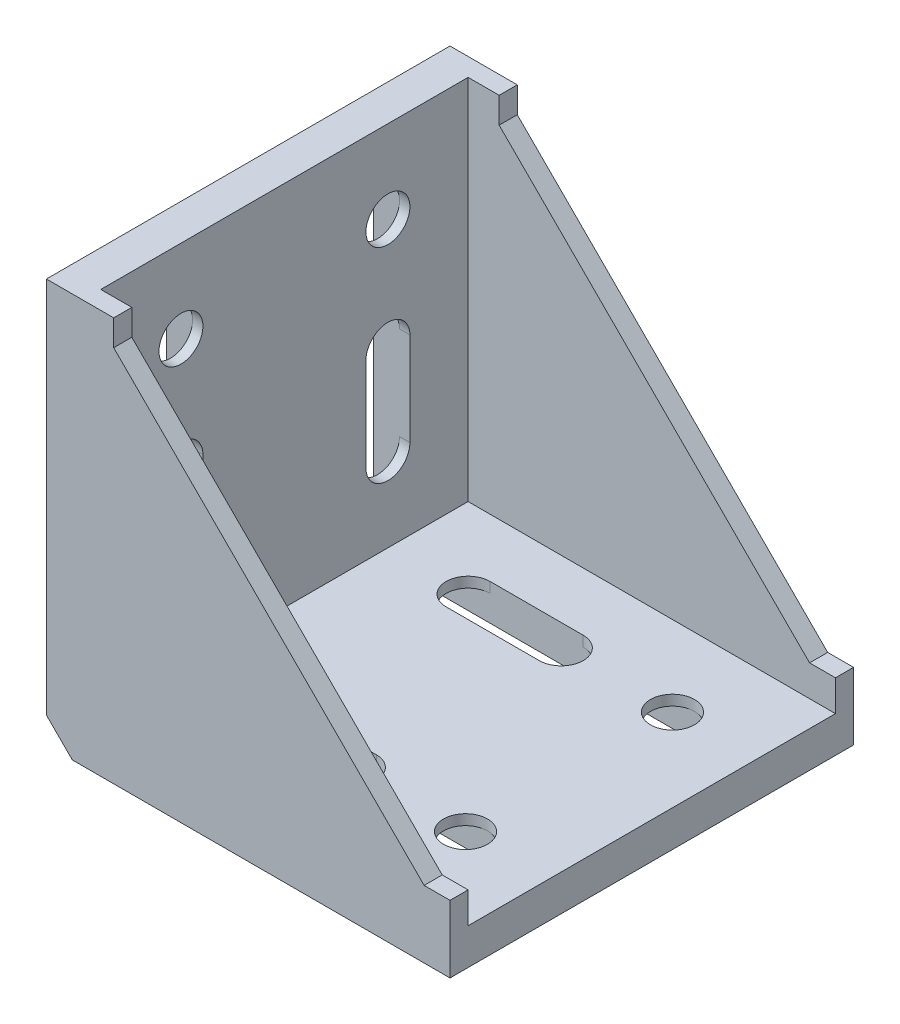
ISO-10303-21;
HEADER;
FILE_DESCRIPTION(('STEP AP214'),'2;1');
FILE_NAME('part.step','',(''),(''),'','','');
FILE_SCHEMA(('AUTOMOTIVE_DESIGN { 1 0 10303 214 1 1 1 1 }'));
ENDSEC;
DATA;
#1=APPLICATION_CONTEXT('core data for automotive mechanical design processes');
#2=APPLICATION_PROTOCOL_DEFINITION('international standard','automotive_design',2000,#1);
#3=PRODUCT_CONTEXT('',#1,'mechanical');
#4=PRODUCT('Part','Part','',(#3));
#5=PRODUCT_RELATED_PRODUCT_CATEGORY('part','',(#4));
#6=PRODUCT_DEFINITION_FORMATION('','',#4);
#7=PRODUCT_DEFINITION_CONTEXT('part definition',#1,'design');
#8=PRODUCT_DEFINITION('design','',#6,#7);
#9=PRODUCT_DEFINITION_SHAPE('','',#8);
#10=(LENGTH_UNIT() NAMED_UNIT(*) SI_UNIT(.MILLI.,.METRE.));
#11=(NAMED_UNIT(*) PLANE_ANGLE_UNIT() SI_UNIT($,.RADIAN.));
#12=(NAMED_UNIT(*) SI_UNIT($,.STERADIAN.) SOLID_ANGLE_UNIT());
#13=UNCERTAINTY_MEASURE_WITH_UNIT(LENGTH_MEASURE(1.E-05),#10,'distance_accuracy_value','');
#14=(GEOMETRIC_REPRESENTATION_CONTEXT(3) GLOBAL_UNCERTAINTY_ASSIGNED_CONTEXT((#13)) GLOBAL_UNIT_ASSIGNED_CONTEXT((#10,
#11,#12)) REPRESENTATION_CONTEXT('',''));
#15=CARTESIAN_POINT('',(0.,0.,0.));
#16=DIRECTION('',(0.,0.,1.));
#17=DIRECTION('',(1.,0.,0.));
#18=AXIS2_PLACEMENT_3D('',#15,#16,#17);
#19=CARTESIAN_POINT('',(0.,0.,39.));
#20=DIRECTION('',(1.,0.,0.));
#21=DIRECTION('',(0.,0.,-1.));
#22=AXIS2_PLACEMENT_3D('',#19,#20,#21);
#23=PLANE('',#22);
#24=DIRECTION('',(0.,0.,1.));
#25=VECTOR('',#24,1.);
#26=CARTESIAN_POINT('',(0.,70.,-24.25));
#27=LINE('',#26,#25);
#28=CARTESIAN_POINT('',(0.,70.,-24.25));
#29=VERTEX_POINT('',#28);
#30=CARTESIAN_POINT('',(0.,70.,-23.9));
#31=VERTEX_POINT('',#30);
#32=EDGE_CURVE('E1198',#29,#31,#27,.T.);
#33=ORIENTED_EDGE('',*,*,#32,.T.);
#34=DIRECTION('',(0.,1.,0.));
#35=VECTOR('',#34,1.);
#36=CARTESIAN_POINT('',(0.,72.,-23.9));
#37=LINE('',#36,#35);
#38=CARTESIAN_POINT('',(0.,72.,-23.9));
#39=VERTEX_POINT('',#38);
#40=EDGE_CURVE('E697',#31,#39,#37,.T.);
#41=ORIENTED_EDGE('',*,*,#40,.T.);
#42=DIRECTION('',(0.,0.,1.));
#43=VECTOR('',#42,1.);
#44=CARTESIAN_POINT('',(0.,72.,-16.1));
#45=LINE('',#44,#43);
#46=CARTESIAN_POINT('',(0.,72.,-16.1));
#47=VERTEX_POINT('',#46);
#48=EDGE_CURVE('E711',#39,#47,#45,.T.);
#49=ORIENTED_EDGE('',*,*,#48,.T.);
#50=DIRECTION('',(0.,-1.,0.));
#51=VECTOR('',#50,1.);
#52=CARTESIAN_POINT('',(0.,70.,-16.1));
#53=LINE('',#52,#51);
#54=CARTESIAN_POINT('',(0.,70.,-16.1));
#55=VERTEX_POINT('',#54);
#56=EDGE_CURVE('E723',#47,#55,#53,.T.);
#57=ORIENTED_EDGE('',*,*,#56,.T.);
#58=CARTESIAN_POINT('',(0.,70.,-15.75));
#59=VERTEX_POINT('',#58);
#60=EDGE_CURVE('E1196',#55,#59,#27,.T.);
#61=ORIENTED_EDGE('',*,*,#60,.T.);
#62=DIRECTION('',(0.,-1.,0.));
#63=VECTOR('',#62,1.);
#64=CARTESIAN_POINT('',(0.,40.5,-15.75));
#65=LINE('',#64,#63);
#66=CARTESIAN_POINT('',(0.,10.,-15.75));
#67=VERTEX_POINT('',#66);
#68=EDGE_CURVE('E903',#59,#67,#65,.T.);
#69=ORIENTED_EDGE('',*,*,#68,.T.);
#70=DIRECTION('',(0.,0.,-1.));
#71=VECTOR('',#70,1.);
#72=CARTESIAN_POINT('',(0.,10.,-15.75));
#73=LINE('',#72,#71);
#74=CARTESIAN_POINT('',(0.,10.,-16.05));
#75=VERTEX_POINT('',#74);
#76=EDGE_CURVE('E1194',#67,#75,#73,.T.);
#77=ORIENTED_EDGE('',*,*,#76,.T.);
#78=DIRECTION('',(0.,-1.,0.));
#79=VECTOR('',#78,1.);
#80=CARTESIAN_POINT('',(0.,8.,-16.05));
#81=LINE('',#80,#79);
#82=CARTESIAN_POINT('',(0.,8.,-16.05));
#83=VERTEX_POINT('',#82);
#84=EDGE_CURVE('E736',#75,#83,#81,.T.);
#85=ORIENTED_EDGE('',*,*,#84,.T.);
#86=DIRECTION('',(0.,0.,-1.));
#87=VECTOR('',#86,1.);
#88=CARTESIAN_POINT('',(0.,8.,-23.9));
#89=LINE('',#88,#87);
#90=CARTESIAN_POINT('',(0.,8.,-23.9));
#91=VERTEX_POINT('',#90);
#92=EDGE_CURVE('E748',#83,#91,#89,.T.);
#93=ORIENTED_EDGE('',*,*,#92,.T.);
#94=DIRECTION('',(0.,1.,0.));
#95=VECTOR('',#94,1.);
#96=CARTESIAN_POINT('',(0.,10.,-23.9));
#97=LINE('',#96,#95);
#98=CARTESIAN_POINT('',(0.,10.,-23.9));
#99=VERTEX_POINT('',#98);
#100=EDGE_CURVE('E701',#91,#99,#97,.T.);
#101=ORIENTED_EDGE('',*,*,#100,.T.);
#102=CARTESIAN_POINT('',(0.,10.,-24.25));
#103=VERTEX_POINT('',#102);
#104=EDGE_CURVE('E1197',#99,#103,#73,.T.);
#105=ORIENTED_EDGE('',*,*,#104,.T.);
#106=DIRECTION('',(0.,1.,0.));
#107=VECTOR('',#106,1.);
#108=CARTESIAN_POINT('',(0.,40.5,-24.25));
#109=LINE('',#108,#107);
#110=EDGE_CURVE('E895',#103,#29,#109,.T.);
#111=ORIENTED_EDGE('',*,*,#110,.T.);
#112=EDGE_LOOP('',(#33,#41,#49,#57,#61,#69,#77,#85,#93,#101,#105,#111));
#113=FACE_BOUND('',#112,.T.);
#114=DIRECTION('',(0.,0.,-1.));
#115=VECTOR('',#114,1.);
#116=CARTESIAN_POINT('',(0.,6.50000000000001,-27.5));
#117=LINE('',#116,#115);
#118=CARTESIAN_POINT('',(0.,6.50000000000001,-27.5));
#119=VERTEX_POINT('',#118);
#120=CARTESIAN_POINT('',(0.,6.50000000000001,-35.5));
#121=VERTEX_POINT('',#120);
#122=EDGE_CURVE('E1248',#119,#121,#117,.T.);
#123=ORIENTED_EDGE('',*,*,#122,.T.);
#124=DIRECTION('',(0.,1.,0.));
#125=VECTOR('',#124,1.);
#126=CARTESIAN_POINT('',(0.,6.50000000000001,-35.5));
#127=LINE('',#126,#125);
#128=CARTESIAN_POINT('',(0.,73.,-35.5));
#129=VERTEX_POINT('',#128);
#130=EDGE_CURVE('E1238',#121,#129,#127,.T.);
#131=ORIENTED_EDGE('',*,*,#130,.T.);
#132=DIRECTION('',(0.,0.,1.));
#133=VECTOR('',#132,1.);
#134=CARTESIAN_POINT('',(0.,73.,-35.5));
#135=LINE('',#134,#133);
#136=CARTESIAN_POINT('',(0.,73.,-27.5));
#137=VERTEX_POINT('',#136);
#138=EDGE_CURVE('E1242',#129,#137,#135,.T.);
#139=ORIENTED_EDGE('',*,*,#138,.T.);
#140=DIRECTION('',(0.,-1.,0.));
#141=VECTOR('',#140,1.);
#142=CARTESIAN_POINT('',(0.,73.,-27.5));
#143=LINE('',#142,#141);
#144=EDGE_CURVE('E1245',#137,#119,#143,.T.);
#145=ORIENTED_EDGE('',*,*,#144,.T.);
#146=EDGE_LOOP('',(#123,#131,#139,#145));
#147=FACE_BOUND('',#146,.T.);
#148=DIRECTION('',(0.,0.,-1.));
#149=VECTOR('',#148,1.);
#150=CARTESIAN_POINT('',(0.,8.,23.9));
#151=LINE('',#150,#149);
#152=CARTESIAN_POINT('',(0.,8.,23.9));
#153=VERTEX_POINT('',#152);
#154=CARTESIAN_POINT('',(0.,8.,16.05));
#155=VERTEX_POINT('',#154);
#156=EDGE_CURVE('E779',#153,#155,#151,.T.);
#157=ORIENTED_EDGE('',*,*,#156,.T.);
#158=DIRECTION('',(0.,1.,0.));
#159=VECTOR('',#158,1.);
#160=CARTESIAN_POINT('',(0.,8.,16.05));
#161=LINE('',#160,#159);
#162=CARTESIAN_POINT('',(0.,10.,16.05));
#163=VERTEX_POINT('',#162);
#164=EDGE_CURVE('E762',#155,#163,#161,.T.);
#165=ORIENTED_EDGE('',*,*,#164,.T.);
#166=DIRECTION('',(0.,0.,-1.));
#167=VECTOR('',#166,1.);
#168=CARTESIAN_POINT('',(0.,10.,15.75));
#169=LINE('',#168,#167);
#170=CARTESIAN_POINT('',(0.,10.,15.75));
#171=VERTEX_POINT('',#170);
#172=EDGE_CURVE('E839',#163,#171,#169,.T.);
#173=ORIENTED_EDGE('',*,*,#172,.T.);
#174=DIRECTION('',(0.,1.,0.));
#175=VECTOR('',#174,1.);
#176=CARTESIAN_POINT('',(0.,40.5,15.75));
#177=LINE('',#176,#175);
#178=CARTESIAN_POINT('',(0.,70.,15.75));
#179=VERTEX_POINT('',#178);
#180=EDGE_CURVE('E917',#171,#179,#177,.T.);
#181=ORIENTED_EDGE('',*,*,#180,.T.);
#182=DIRECTION('',(0.,0.,1.));
#183=VECTOR('',#182,1.);
#184=CARTESIAN_POINT('',(0.,70.,24.25));
#185=LINE('',#184,#183);
#186=CARTESIAN_POINT('',(0.,70.,16.1));
#187=VERTEX_POINT('',#186);
#188=EDGE_CURVE('E835',#179,#187,#185,.T.);
#189=ORIENTED_EDGE('',*,*,#188,.T.);
#190=DIRECTION('',(0.,1.,0.));
#191=VECTOR('',#190,1.);
#192=CARTESIAN_POINT('',(0.,70.,16.1));
#193=LINE('',#192,#191);
#194=CARTESIAN_POINT('',(0.,72.,16.1));
#195=VERTEX_POINT('',#194);
#196=EDGE_CURVE('E797',#187,#195,#193,.T.);
#197=ORIENTED_EDGE('',*,*,#196,.T.);
#198=DIRECTION('',(0.,0.,1.));
#199=VECTOR('',#198,1.);
#200=CARTESIAN_POINT('',(0.,72.,16.1));
#201=LINE('',#200,#199);
#202=CARTESIAN_POINT('',(0.,72.,23.9));
#203=VERTEX_POINT('',#202);
#204=EDGE_CURVE('E809',#195,#203,#201,.T.);
#205=ORIENTED_EDGE('',*,*,#204,.T.);
#206=DIRECTION('',(0.,-1.,0.));
#207=VECTOR('',#206,1.);
#208=CARTESIAN_POINT('',(0.,72.,23.9));
#209=LINE('',#208,#207);
#210=CARTESIAN_POINT('',(0.,70.,23.9));
#211=VERTEX_POINT('',#210);
#212=EDGE_CURVE('E793',#203,#211,#209,.T.);
#213=ORIENTED_EDGE('',*,*,#212,.T.);
#214=CARTESIAN_POINT('',(0.,70.,24.25));
#215=VERTEX_POINT('',#214);
#216=EDGE_CURVE('E840',#211,#215,#185,.T.);
#217=ORIENTED_EDGE('',*,*,#216,.T.);
#218=DIRECTION('',(0.,-1.,0.));
#219=VECTOR('',#218,1.);
#220=CARTESIAN_POINT('',(0.,40.5,24.25));
#221=LINE('',#220,#219);
#222=CARTESIAN_POINT('',(0.,10.,24.25));
#223=VERTEX_POINT('',#222);
#224=EDGE_CURVE('E919',#215,#223,#221,.T.);
#225=ORIENTED_EDGE('',*,*,#224,.T.);
#226=CARTESIAN_POINT('',(0.,10.,23.9));
#227=VERTEX_POINT('',#226);
#228=EDGE_CURVE('E847',#223,#227,#169,.T.);
#229=ORIENTED_EDGE('',*,*,#228,.T.);
#230=DIRECTION('',(0.,-1.,0.));
#231=VECTOR('',#230,1.);
#232=CARTESIAN_POINT('',(0.,10.,23.9));
#233=LINE('',#232,#231);
#234=EDGE_CURVE('E767',#227,#153,#233,.T.);
#235=ORIENTED_EDGE('',*,*,#234,.T.);
#236=EDGE_LOOP('',(#157,#165,#173,#181,#189,#197,#205,#213,#217,#225,#229,#235));
#237=FACE_BOUND('',#236,.T.);
#238=DIRECTION('',(0.,-1.,0.));
#239=VECTOR('',#238,1.);
#240=CARTESIAN_POINT('',(0.,0.,-39.));
#241=LINE('',#240,#239);
#242=CARTESIAN_POINT('',(0.,78.,-39.));
#243=VERTEX_POINT('',#242);
#244=CARTESIAN_POINT('',(0.,5.,-39.));
#245=VERTEX_POINT('',#244);
#246=EDGE_CURVE('E1853',#243,#245,#241,.T.);
#247=ORIENTED_EDGE('',*,*,#246,.T.);
#248=DIRECTION('',(0.,0.,1.));
#249=VECTOR('',#248,1.);
#250=CARTESIAN_POINT('',(0.,5.,39.));
#251=LINE('',#250,#249);
#252=CARTESIAN_POINT('',(0.,5.,39.));
#253=VERTEX_POINT('',#252);
#254=EDGE_CURVE('E39',#245,#253,#251,.T.);
#255=ORIENTED_EDGE('',*,*,#254,.T.);
#256=DIRECTION('',(0.,-1.,0.));
#257=VECTOR('',#256,1.);
#258=CARTESIAN_POINT('',(0.,0.,39.));
#259=LINE('',#258,#257);
#260=CARTESIAN_POINT('',(0.,78.,39.));
#261=VERTEX_POINT('',#260);
#262=EDGE_CURVE('E1838',#261,#253,#259,.T.);
#263=ORIENTED_EDGE('',*,*,#262,.F.);
#264=DIRECTION('',(0.,0.,-1.));
#265=VECTOR('',#264,1.);
#266=CARTESIAN_POINT('',(0.,78.,39.));
#267=LINE('',#266,#265);
#268=EDGE_CURVE('E1852',#261,#243,#267,.T.);
#269=ORIENTED_EDGE('',*,*,#268,.T.);
#270=EDGE_LOOP('',(#247,#255,#263,#269));
#271=FACE_BOUND('',#270,.T.);
#272=DIRECTION('',(0.,-1.,0.));
#273=VECTOR('',#272,1.);
#274=CARTESIAN_POINT('',(0.,6.5,35.5));
#275=LINE('',#274,#273);
#276=CARTESIAN_POINT('',(0.,73.,35.5));
#277=VERTEX_POINT('',#276);
#278=CARTESIAN_POINT('',(0.,6.5,35.5));
#279=VERTEX_POINT('',#278);
#280=EDGE_CURVE('E881',#277,#279,#275,.T.);
#281=ORIENTED_EDGE('',*,*,#280,.T.);
#282=DIRECTION('',(0.,0.,-1.));
#283=VECTOR('',#282,1.);
#284=CARTESIAN_POINT('',(0.,6.5,27.5));
#285=LINE('',#284,#283);
#286=CARTESIAN_POINT('',(0.,6.5,27.5));
#287=VERTEX_POINT('',#286);
#288=EDGE_CURVE('E874',#279,#287,#285,.T.);
#289=ORIENTED_EDGE('',*,*,#288,.T.);
#290=DIRECTION('',(0.,1.,0.));
#291=VECTOR('',#290,1.);
#292=CARTESIAN_POINT('',(0.,73.,27.5));
#293=LINE('',#292,#291);
#294=CARTESIAN_POINT('',(0.,73.,27.5));
#295=VERTEX_POINT('',#294);
#296=EDGE_CURVE('E887',#287,#295,#293,.T.);
#297=ORIENTED_EDGE('',*,*,#296,.T.);
#298=DIRECTION('',(0.,0.,1.));
#299=VECTOR('',#298,1.);
#300=CARTESIAN_POINT('',(0.,73.,35.5));
#301=LINE('',#300,#299);
#302=EDGE_CURVE('E884',#295,#277,#301,.T.);
#303=ORIENTED_EDGE('',*,*,#302,.T.);
#304=EDGE_LOOP('',(#281,#289,#297,#303));
#305=FACE_BOUND('',#304,.T.);
#306=DIRECTION('',(0.,-1.,0.));
#307=VECTOR('',#306,1.);
#308=CARTESIAN_POINT('',(0.,7.4511865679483,12.));
#309=LINE('',#308,#307);
#310=CARTESIAN_POINT('',(0.,72.310802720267,12.));
#311=VERTEX_POINT('',#310);
#312=CARTESIAN_POINT('',(0.,7.4511865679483,12.));
#313=VERTEX_POINT('',#312);
#314=EDGE_CURVE('E1279',#311,#313,#309,.T.);
#315=ORIENTED_EDGE('',*,*,#314,.T.);
#316=DIRECTION('',(0.,0.,-1.));
#317=VECTOR('',#316,1.);
#318=CARTESIAN_POINT('',(0.,7.4511865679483,-12.));
#319=LINE('',#318,#317);
#320=CARTESIAN_POINT('',(0.,7.4511865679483,-12.));
#321=VERTEX_POINT('',#320);
#322=EDGE_CURVE('E1269',#313,#321,#319,.T.);
#323=ORIENTED_EDGE('',*,*,#322,.T.);
#324=DIRECTION('',(0.,1.,0.));
#325=VECTOR('',#324,1.);
#326=CARTESIAN_POINT('',(0.,72.310802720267,-12.));
#327=LINE('',#326,#325);
#328=CARTESIAN_POINT('',(0.,72.310802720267,-12.));
#329=VERTEX_POINT('',#328);
#330=EDGE_CURVE('E1273',#321,#329,#327,.T.);
#331=ORIENTED_EDGE('',*,*,#330,.T.);
#332=DIRECTION('',(0.,0.,1.));
#333=VECTOR('',#332,1.);
#334=CARTESIAN_POINT('',(0.,72.310802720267,12.));
#335=LINE('',#334,#333);
#336=EDGE_CURVE('E1276',#329,#311,#335,.T.);
#337=ORIENTED_EDGE('',*,*,#336,.T.);
#338=EDGE_LOOP('',(#315,#323,#331,#337));
#339=FACE_BOUND('',#338,.T.);
#340=ADVANCED_FACE('F31',(#113,#147,#237,#271,#305,#339),#23,.F.);
#341=CARTESIAN_POINT('',(78.,62.,-20.));
#342=DIRECTION('',(-1.,0.,0.));
#343=DIRECTION('',(0.,-1.,0.));
#344=AXIS2_PLACEMENT_3D('',#341,#342,#343);
#345=CYLINDRICAL_SURFACE('',#344,4.25);
#346=CARTESIAN_POINT('',(7.00000000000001,62.,-20.));
#347=DIRECTION('',(-1.,0.,0.));
#348=DIRECTION('',(0.,-1.,0.));
#349=AXIS2_PLACEMENT_3D('',#346,#347,#348);
#350=CIRCLE('',#349,4.25);
#351=CARTESIAN_POINT('',(7.00000000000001,57.75,-20.));
#352=VERTEX_POINT('',#351);
#353=EDGE_CURVE('E908',#352,#352,#350,.F.);
#354=ORIENTED_EDGE('',*,*,#353,.T.);
#355=EDGE_LOOP('',(#354));
#356=FACE_BOUND('',#355,.T.);
#357=CARTESIAN_POINT('',(4.99999999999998,62.,-20.));
#358=DIRECTION('',(-1.,0.,0.));
#359=DIRECTION('',(0.,-1.,0.));
#360=AXIS2_PLACEMENT_3D('',#357,#358,#359);
#361=CIRCLE('',#360,4.25);
#362=CARTESIAN_POINT('',(4.99999999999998,62.,-24.25));
#363=VERTEX_POINT('',#362);
#364=CARTESIAN_POINT('',(4.99999999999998,62.,-15.75));
#365=VERTEX_POINT('',#364);
#366=EDGE_CURVE('E1110',#363,#365,#361,.T.);
#367=ORIENTED_EDGE('',*,*,#366,.T.);
#368=EDGE_CURVE('E1114',#365,#363,#361,.T.);
#369=ORIENTED_EDGE('',*,*,#368,.T.);
#370=EDGE_LOOP('',(#367,#369));
#371=FACE_BOUND('',#370,.T.);
#372=ADVANCED_FACE('F1176',(#356,#371),#345,.F.);
#373=CARTESIAN_POINT('',(78.,40.5,-20.));
#374=DIRECTION('',(-1.,0.,0.));
#375=DIRECTION('',(0.,-1.,0.));
#376=AXIS2_PLACEMENT_3D('',#373,#374,#375);
#377=CYLINDRICAL_SURFACE('',#376,4.25);
#378=DIRECTION('',(-1.,0.,0.));
#379=VECTOR('',#378,1.);
#380=CARTESIAN_POINT('',(78.,40.5,-15.75));
#381=LINE('',#380,#379);
#382=CARTESIAN_POINT('',(7.00000000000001,40.5,-15.75));
#383=VERTEX_POINT('',#382);
#384=CARTESIAN_POINT('',(4.99999999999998,40.5,-15.75));
#385=VERTEX_POINT('',#384);
#386=EDGE_CURVE('E906',#383,#385,#381,.T.);
#387=ORIENTED_EDGE('',*,*,#386,.T.);
#388=CARTESIAN_POINT('',(4.99999999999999,40.5,-20.));
#389=DIRECTION('',(-1.,0.,0.));
#390=DIRECTION('',(0.,-1.,0.));
#391=AXIS2_PLACEMENT_3D('',#388,#389,#390);
#392=CIRCLE('',#391,4.25);
#393=CARTESIAN_POINT('',(4.99999999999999,40.5,-24.25));
#394=VERTEX_POINT('',#393);
#395=EDGE_CURVE('E1106',#385,#394,#392,.T.);
#396=ORIENTED_EDGE('',*,*,#395,.T.);
#397=DIRECTION('',(-1.,0.,0.));
#398=VECTOR('',#397,1.);
#399=CARTESIAN_POINT('',(78.,40.5,-24.25));
#400=LINE('',#399,#398);
#401=CARTESIAN_POINT('',(7.00000000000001,40.5,-24.25));
#402=VERTEX_POINT('',#401);
#403=EDGE_CURVE('E905',#402,#394,#400,.T.);
#404=ORIENTED_EDGE('',*,*,#403,.F.);
#405=CARTESIAN_POINT('',(7.00000000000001,40.5,-20.));
#406=DIRECTION('',(-1.,0.,0.));
#407=DIRECTION('',(0.,-1.,0.));
#408=AXIS2_PLACEMENT_3D('',#405,#406,#407);
#409=CIRCLE('',#408,4.25);
#410=EDGE_CURVE('E820',#402,#383,#409,.F.);
#411=ORIENTED_EDGE('',*,*,#410,.T.);
#412=EDGE_LOOP('',(#387,#396,#404,#411));
#413=FACE_BOUND('',#412,.T.);
#414=ADVANCED_FACE('F1105',(#413),#377,.F.);
#415=CARTESIAN_POINT('',(78.,22.5,-20.));
#416=DIRECTION('',(-1.,0.,0.));
#417=DIRECTION('',(0.,-1.,0.));
#418=AXIS2_PLACEMENT_3D('',#415,#416,#417);
#419=CYLINDRICAL_SURFACE('',#418,4.25);
#420=DIRECTION('',(-1.,0.,0.));
#421=VECTOR('',#420,1.);
#422=CARTESIAN_POINT('',(78.,22.5,-24.25));
#423=LINE('',#422,#421);
#424=CARTESIAN_POINT('',(7.00000000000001,22.5,-24.25));
#425=VERTEX_POINT('',#424);
#426=CARTESIAN_POINT('',(4.99999999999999,22.5,-24.25));
#427=VERTEX_POINT('',#426);
#428=EDGE_CURVE('E912',#425,#427,#423,.T.);
#429=ORIENTED_EDGE('',*,*,#428,.T.);
#430=CARTESIAN_POINT('',(4.99999999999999,22.5,-20.));
#431=DIRECTION('',(-1.,0.,0.));
#432=DIRECTION('',(0.,-1.,0.));
#433=AXIS2_PLACEMENT_3D('',#430,#431,#432);
#434=CIRCLE('',#433,4.25);
#435=CARTESIAN_POINT('',(4.99999999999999,22.5,-15.75));
#436=VERTEX_POINT('',#435);
#437=EDGE_CURVE('E1111',#427,#436,#434,.T.);
#438=ORIENTED_EDGE('',*,*,#437,.T.);
#439=DIRECTION('',(-1.,0.,0.));
#440=VECTOR('',#439,1.);
#441=CARTESIAN_POINT('',(78.,22.5,-15.75));
#442=LINE('',#441,#440);
#443=CARTESIAN_POINT('',(7.00000000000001,22.5,-15.75));
#444=VERTEX_POINT('',#443);
#445=EDGE_CURVE('E909',#444,#436,#442,.T.);
#446=ORIENTED_EDGE('',*,*,#445,.F.);
#447=CARTESIAN_POINT('',(7.00000000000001,22.5,-20.));
#448=DIRECTION('',(-1.,0.,0.));
#449=DIRECTION('',(0.,-1.,0.));
#450=AXIS2_PLACEMENT_3D('',#447,#448,#449);
#451=CIRCLE('',#450,4.25);
#452=EDGE_CURVE('E831',#444,#425,#451,.F.);
#453=ORIENTED_EDGE('',*,*,#452,.T.);
#454=EDGE_LOOP('',(#429,#438,#446,#453));
#455=FACE_BOUND('',#454,.T.);
#456=ADVANCED_FACE('F1094',(#455),#419,.F.);
#457=CARTESIAN_POINT('',(7.,78.,39.));
#458=DIRECTION('',(-1.,0.,0.));
#459=DIRECTION('',(0.,-1.,0.));
#460=AXIS2_PLACEMENT_3D('',#457,#458,#459);
#461=PLANE('',#460);
#462=ORIENTED_EDGE('',*,*,#353,.F.);
#463=EDGE_LOOP('',(#462));
#464=FACE_BOUND('',#463,.T.);
#465=CARTESIAN_POINT('',(7.00000000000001,62.,20.));
#466=DIRECTION('',(-1.,0.,0.));
#467=DIRECTION('',(0.,-1.,0.));
#468=AXIS2_PLACEMENT_3D('',#465,#466,#467);
#469=CIRCLE('',#468,4.25);
#470=CARTESIAN_POINT('',(7.00000000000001,57.75,20.));
#471=VERTEX_POINT('',#470);
#472=EDGE_CURVE('E925',#471,#471,#469,.F.);
#473=ORIENTED_EDGE('',*,*,#472,.F.);
#474=EDGE_LOOP('',(#473));
#475=FACE_BOUND('',#474,.T.);
#476=DIRECTION('',(0.,0.,-1.));
#477=VECTOR('',#476,1.);
#478=CARTESIAN_POINT('',(7.00000000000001,7.,39.));
#479=LINE('',#478,#477);
#480=CARTESIAN_POINT('',(7.00000000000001,7.,35.5));
#481=VERTEX_POINT('',#480);
#482=CARTESIAN_POINT('',(7.00000000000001,7.,-35.5));
#483=VERTEX_POINT('',#482);
#484=EDGE_CURVE('E1866',#481,#483,#479,.T.);
#485=ORIENTED_EDGE('',*,*,#484,.T.);
#486=DIRECTION('',(0.,-1.,0.));
#487=VECTOR('',#486,1.);
#488=CARTESIAN_POINT('',(7.00000000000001,7.,-35.5));
#489=LINE('',#488,#487);
#490=CARTESIAN_POINT('',(7.,78.,-35.5));
#491=VERTEX_POINT('',#490);
#492=EDGE_CURVE('E2002',#491,#483,#489,.T.);
#493=ORIENTED_EDGE('',*,*,#492,.F.);
#494=DIRECTION('',(0.,0.,-1.));
#495=VECTOR('',#494,1.);
#496=CARTESIAN_POINT('',(7.,78.,39.));
#497=LINE('',#496,#495);
#498=CARTESIAN_POINT('',(7.,78.,35.5));
#499=VERTEX_POINT('',#498);
#500=EDGE_CURVE('E1863',#499,#491,#497,.T.);
#501=ORIENTED_EDGE('',*,*,#500,.F.);
#502=DIRECTION('',(0.,-1.,0.));
#503=VECTOR('',#502,1.);
#504=CARTESIAN_POINT('',(7.00000000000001,7.,35.5));
#505=LINE('',#504,#503);
#506=EDGE_CURVE('E2038',#499,#481,#505,.T.);
#507=ORIENTED_EDGE('',*,*,#506,.T.);
#508=EDGE_LOOP('',(#485,#493,#501,#507));
#509=FACE_BOUND('',#508,.T.);
#510=CARTESIAN_POINT('',(7.00000000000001,40.5,20.));
#511=DIRECTION('',(-1.,0.,0.));
#512=DIRECTION('',(0.,-1.,0.));
#513=AXIS2_PLACEMENT_3D('',#510,#511,#512);
#514=CIRCLE('',#513,4.25);
#515=CARTESIAN_POINT('',(7.00000000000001,40.5,15.75));
#516=VERTEX_POINT('',#515);
#517=CARTESIAN_POINT('',(7.00000000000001,40.5,24.25));
#518=VERTEX_POINT('',#517);
#519=EDGE_CURVE('E1084',#516,#518,#514,.F.);
#520=ORIENTED_EDGE('',*,*,#519,.F.);
#521=DIRECTION('',(0.,1.,0.));
#522=VECTOR('',#521,1.);
#523=CARTESIAN_POINT('',(7.,78.,15.75));
#524=LINE('',#523,#522);
#525=CARTESIAN_POINT('',(7.00000000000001,22.5,15.75));
#526=VERTEX_POINT('',#525);
#527=EDGE_CURVE('E1076',#526,#516,#524,.T.);
#528=ORIENTED_EDGE('',*,*,#527,.F.);
#529=CARTESIAN_POINT('',(7.00000000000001,22.5,20.));
#530=DIRECTION('',(-1.,0.,0.));
#531=DIRECTION('',(0.,-1.,0.));
#532=AXIS2_PLACEMENT_3D('',#529,#530,#531);
#533=CIRCLE('',#532,4.25);
#534=CARTESIAN_POINT('',(7.00000000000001,22.5,24.25));
#535=VERTEX_POINT('',#534);
#536=EDGE_CURVE('E1078',#535,#526,#533,.F.);
#537=ORIENTED_EDGE('',*,*,#536,.F.);
#538=DIRECTION('',(0.,-1.,0.));
#539=VECTOR('',#538,1.);
#540=CARTESIAN_POINT('',(7.,78.,24.25));
#541=LINE('',#540,#539);
#542=EDGE_CURVE('E1082',#518,#535,#541,.T.);
#543=ORIENTED_EDGE('',*,*,#542,.F.);
#544=EDGE_LOOP('',(#520,#528,#537,#543));
#545=FACE_BOUND('',#544,.T.);
#546=ORIENTED_EDGE('',*,*,#410,.F.);
#547=DIRECTION('',(0.,1.,0.));
#548=VECTOR('',#547,1.);
#549=CARTESIAN_POINT('',(7.,78.,-24.25));
#550=LINE('',#549,#548);
#551=EDGE_CURVE('E1086',#425,#402,#550,.T.);
#552=ORIENTED_EDGE('',*,*,#551,.F.);
#553=ORIENTED_EDGE('',*,*,#452,.F.);
#554=DIRECTION('',(0.,-1.,0.));
#555=VECTOR('',#554,1.);
#556=CARTESIAN_POINT('',(7.,78.,-15.75));
#557=LINE('',#556,#555);
#558=EDGE_CURVE('E824',#383,#444,#557,.T.);
#559=ORIENTED_EDGE('',*,*,#558,.F.);
#560=EDGE_LOOP('',(#546,#552,#553,#559));
#561=FACE_BOUND('',#560,.T.);
#562=ADVANCED_FACE('F1098',(#464,#475,#509,#545,#561),#461,.F.);
#563=CARTESIAN_POINT('',(78.,0.,39.));
#564=DIRECTION('',(0.,1.,0.));
#565=DIRECTION('',(-1.,0.,0.));
#566=AXIS2_PLACEMENT_3D('',#563,#564,#565);
#567=PLANE('',#566);
#568=DIRECTION('',(0.,0.,-1.));
#569=VECTOR('',#568,1.);
#570=CARTESIAN_POINT('',(7.4511865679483,0.,-12.));
#571=LINE('',#570,#569);
#572=CARTESIAN_POINT('',(7.4511865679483,0.,12.));
#573=VERTEX_POINT('',#572);
#574=CARTESIAN_POINT('',(7.4511865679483,0.,-12.));
#575=VERTEX_POINT('',#574);
#576=EDGE_CURVE('E950',#573,#575,#571,.T.);
#577=ORIENTED_EDGE('',*,*,#576,.F.);
#578=DIRECTION('',(-1.,0.,0.));
#579=VECTOR('',#578,1.);
#580=CARTESIAN_POINT('',(7.4511865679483,0.,12.));
#581=LINE('',#580,#579);
#582=CARTESIAN_POINT('',(72.310802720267,0.,12.));
#583=VERTEX_POINT('',#582);
#584=EDGE_CURVE('E948',#583,#573,#581,.T.);
#585=ORIENTED_EDGE('',*,*,#584,.F.);
#586=DIRECTION('',(0.,0.,1.));
#587=VECTOR('',#586,1.);
#588=CARTESIAN_POINT('',(72.310802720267,0.,12.));
#589=LINE('',#588,#587);
#590=CARTESIAN_POINT('',(72.310802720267,0.,-12.));
#591=VERTEX_POINT('',#590);
#592=EDGE_CURVE('E938',#591,#583,#589,.T.);
#593=ORIENTED_EDGE('',*,*,#592,.F.);
#594=DIRECTION('',(1.,0.,0.));
#595=VECTOR('',#594,1.);
#596=CARTESIAN_POINT('',(72.310802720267,0.,-12.));
#597=LINE('',#596,#595);
#598=EDGE_CURVE('E953',#575,#591,#597,.T.);
#599=ORIENTED_EDGE('',*,*,#598,.F.);
#600=EDGE_LOOP('',(#577,#585,#593,#599));
#601=FACE_BOUND('',#600,.T.);
#602=DIRECTION('',(1.,0.,0.));
#603=VECTOR('',#602,1.);
#604=CARTESIAN_POINT('',(6.50000000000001,0.,-35.5));
#605=LINE('',#604,#603);
#606=CARTESIAN_POINT('',(6.50000000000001,0.,-35.5));
#607=VERTEX_POINT('',#606);
#608=CARTESIAN_POINT('',(73.,0.,-35.5));
#609=VERTEX_POINT('',#608);
#610=EDGE_CURVE('E2231',#607,#609,#605,.T.);
#611=ORIENTED_EDGE('',*,*,#610,.F.);
#612=DIRECTION('',(0.,0.,-1.));
#613=VECTOR('',#612,1.);
#614=CARTESIAN_POINT('',(6.50000000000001,0.,-27.5));
#615=LINE('',#614,#613);
#616=CARTESIAN_POINT('',(6.50000000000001,0.,-27.5));
#617=VERTEX_POINT('',#616);
#618=EDGE_CURVE('E2234',#617,#607,#615,.T.);
#619=ORIENTED_EDGE('',*,*,#618,.F.);
#620=DIRECTION('',(-1.,0.,0.));
#621=VECTOR('',#620,1.);
#622=CARTESIAN_POINT('',(73.,0.,-27.5));
#623=LINE('',#622,#621);
#624=CARTESIAN_POINT('',(73.,0.,-27.5));
#625=VERTEX_POINT('',#624);
#626=EDGE_CURVE('E2224',#625,#617,#623,.T.);
#627=ORIENTED_EDGE('',*,*,#626,.F.);
#628=DIRECTION('',(0.,0.,1.));
#629=VECTOR('',#628,1.);
#630=CARTESIAN_POINT('',(73.,0.,-35.5));
#631=LINE('',#630,#629);
#632=EDGE_CURVE('E2228',#609,#625,#631,.T.);
#633=ORIENTED_EDGE('',*,*,#632,.F.);
#634=EDGE_LOOP('',(#611,#619,#627,#633));
#635=FACE_BOUND('',#634,.T.);
#636=DIRECTION('',(0.,0.,-1.));
#637=VECTOR('',#636,1.);
#638=CARTESIAN_POINT('',(6.5,0.,27.5));
#639=LINE('',#638,#637);
#640=CARTESIAN_POINT('',(6.50000000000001,0.,35.5));
#641=VERTEX_POINT('',#640);
#642=CARTESIAN_POINT('',(6.5,0.,27.5));
#643=VERTEX_POINT('',#642);
#644=EDGE_CURVE('E1957',#641,#643,#639,.T.);
#645=ORIENTED_EDGE('',*,*,#644,.F.);
#646=DIRECTION('',(-1.,0.,0.));
#647=VECTOR('',#646,1.);
#648=CARTESIAN_POINT('',(6.5,0.,35.5));
#649=LINE('',#648,#647);
#650=CARTESIAN_POINT('',(73.,0.,35.5));
#651=VERTEX_POINT('',#650);
#652=EDGE_CURVE('E1955',#651,#641,#649,.T.);
#653=ORIENTED_EDGE('',*,*,#652,.F.);
#654=DIRECTION('',(0.,0.,1.));
#655=VECTOR('',#654,1.);
#656=CARTESIAN_POINT('',(73.,0.,35.5));
#657=LINE('',#656,#655);
#658=CARTESIAN_POINT('',(73.,0.,27.5));
#659=VERTEX_POINT('',#658);
#660=EDGE_CURVE('E1945',#659,#651,#657,.T.);
#661=ORIENTED_EDGE('',*,*,#660,.F.);
#662=DIRECTION('',(1.,0.,0.));
#663=VECTOR('',#662,1.);
#664=CARTESIAN_POINT('',(73.,0.,27.5));
#665=LINE('',#664,#663);
#666=EDGE_CURVE('E1960',#643,#659,#665,.T.);
#667=ORIENTED_EDGE('',*,*,#666,.F.);
#668=EDGE_LOOP('',(#645,#653,#661,#667));
#669=FACE_BOUND('',#668,.T.);
#670=DIRECTION('',(1.,0.,0.));
#671=VECTOR('',#670,1.);
#672=CARTESIAN_POINT('',(78.,0.,39.));
#673=LINE('',#672,#671);
#674=CARTESIAN_POINT('',(5.,0.,39.));
#675=VERTEX_POINT('',#674);
#676=CARTESIAN_POINT('',(78.,0.,39.));
#677=VERTEX_POINT('',#676);
#678=EDGE_CURVE('E1836',#675,#677,#673,.T.);
#679=ORIENTED_EDGE('',*,*,#678,.F.);
#680=DIRECTION('',(0.,0.,-1.));
#681=VECTOR('',#680,1.);
#682=CARTESIAN_POINT('',(4.99999999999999,0.,39.));
#683=LINE('',#682,#681);
#684=CARTESIAN_POINT('',(5.,0.,-39.));
#685=VERTEX_POINT('',#684);
#686=EDGE_CURVE('E817',#675,#685,#683,.T.);
#687=ORIENTED_EDGE('',*,*,#686,.T.);
#688=DIRECTION('',(1.,0.,0.));
#689=VECTOR('',#688,1.);
#690=CARTESIAN_POINT('',(78.,0.,-39.));
#691=LINE('',#690,#689);
#692=CARTESIAN_POINT('',(78.,0.,-39.));
#693=VERTEX_POINT('',#692);
#694=EDGE_CURVE('E1855',#685,#693,#691,.T.);
#695=ORIENTED_EDGE('',*,*,#694,.T.);
#696=DIRECTION('',(0.,0.,-1.));
#697=VECTOR('',#696,1.);
#698=CARTESIAN_POINT('',(78.,0.,39.));
#699=LINE('',#698,#697);
#700=EDGE_CURVE('E1841',#677,#693,#699,.T.);
#701=ORIENTED_EDGE('',*,*,#700,.F.);
#702=EDGE_LOOP('',(#679,#687,#695,#701));
#703=FACE_BOUND('',#702,.T.);
#704=DIRECTION('',(-1.,0.,0.));
#705=VECTOR('',#704,1.);
#706=CARTESIAN_POINT('',(10.,0.,23.9));
#707=LINE('',#706,#705);
#708=CARTESIAN_POINT('',(10.,0.,23.9));
#709=VERTEX_POINT('',#708);
#710=CARTESIAN_POINT('',(8.,0.,23.9));
#711=VERTEX_POINT('',#710);
#712=EDGE_CURVE('E1019',#709,#711,#707,.T.);
#713=ORIENTED_EDGE('',*,*,#712,.F.);
#714=DIRECTION('',(0.,0.,-1.));
#715=VECTOR('',#714,1.);
#716=CARTESIAN_POINT('',(10.,0.,15.75));
#717=LINE('',#716,#715);
#718=CARTESIAN_POINT('',(10.,0.,24.25));
#719=VERTEX_POINT('',#718);
#720=EDGE_CURVE('E1915',#719,#709,#717,.T.);
#721=ORIENTED_EDGE('',*,*,#720,.F.);
#722=DIRECTION('',(-1.,0.,0.));
#723=VECTOR('',#722,1.);
#724=CARTESIAN_POINT('',(40.5,0.,24.25));
#725=LINE('',#724,#723);
#726=CARTESIAN_POINT('',(70.,0.,24.25));
#727=VERTEX_POINT('',#726);
#728=EDGE_CURVE('E1893',#727,#719,#725,.T.);
#729=ORIENTED_EDGE('',*,*,#728,.F.);
#730=DIRECTION('',(0.,0.,1.));
#731=VECTOR('',#730,1.);
#732=CARTESIAN_POINT('',(70.,0.,24.25));
#733=LINE('',#732,#731);
#734=CARTESIAN_POINT('',(70.,0.,23.9));
#735=VERTEX_POINT('',#734);
#736=EDGE_CURVE('E1910',#735,#727,#733,.T.);
#737=ORIENTED_EDGE('',*,*,#736,.F.);
#738=DIRECTION('',(-1.,0.,0.));
#739=VECTOR('',#738,1.);
#740=CARTESIAN_POINT('',(72.,0.,23.9));
#741=LINE('',#740,#739);
#742=CARTESIAN_POINT('',(72.,0.,23.9));
#743=VERTEX_POINT('',#742);
#744=EDGE_CURVE('E1050',#743,#735,#741,.T.);
#745=ORIENTED_EDGE('',*,*,#744,.F.);
#746=DIRECTION('',(0.,0.,1.));
#747=VECTOR('',#746,1.);
#748=CARTESIAN_POINT('',(72.,0.,16.1));
#749=LINE('',#748,#747);
#750=CARTESIAN_POINT('',(72.,0.,16.1));
#751=VERTEX_POINT('',#750);
#752=EDGE_CURVE('E1057',#751,#743,#749,.T.);
#753=ORIENTED_EDGE('',*,*,#752,.F.);
#754=DIRECTION('',(1.,0.,0.));
#755=VECTOR('',#754,1.);
#756=CARTESIAN_POINT('',(70.,0.,16.1));
#757=LINE('',#756,#755);
#758=CARTESIAN_POINT('',(70.,0.,16.1));
#759=VERTEX_POINT('',#758);
#760=EDGE_CURVE('E1046',#759,#751,#757,.T.);
#761=ORIENTED_EDGE('',*,*,#760,.F.);
#762=CARTESIAN_POINT('',(70.,0.,15.75));
#763=VERTEX_POINT('',#762);
#764=EDGE_CURVE('E1905',#763,#759,#733,.T.);
#765=ORIENTED_EDGE('',*,*,#764,.F.);
#766=DIRECTION('',(1.,0.,0.));
#767=VECTOR('',#766,1.);
#768=CARTESIAN_POINT('',(40.5,0.,15.75));
#769=LINE('',#768,#767);
#770=CARTESIAN_POINT('',(10.,0.,15.75));
#771=VERTEX_POINT('',#770);
#772=EDGE_CURVE('E1989',#771,#763,#769,.T.);
#773=ORIENTED_EDGE('',*,*,#772,.F.);
#774=CARTESIAN_POINT('',(10.,0.,16.05));
#775=VERTEX_POINT('',#774);
#776=EDGE_CURVE('E2166',#775,#771,#717,.T.);
#777=ORIENTED_EDGE('',*,*,#776,.F.);
#778=DIRECTION('',(1.,0.,0.));
#779=VECTOR('',#778,1.);
#780=CARTESIAN_POINT('',(8.,0.,16.05));
#781=LINE('',#780,#779);
#782=CARTESIAN_POINT('',(8.,0.,16.05));
#783=VERTEX_POINT('',#782);
#784=EDGE_CURVE('E1024',#783,#775,#781,.T.);
#785=ORIENTED_EDGE('',*,*,#784,.F.);
#786=DIRECTION('',(0.,0.,-1.));
#787=VECTOR('',#786,1.);
#788=CARTESIAN_POINT('',(8.,0.,23.9));
#789=LINE('',#788,#787);
#790=EDGE_CURVE('E1033',#711,#783,#789,.T.);
#791=ORIENTED_EDGE('',*,*,#790,.F.);
#792=EDGE_LOOP('',(#713,#721,#729,#737,#745,#753,#761,#765,#773,#777,#785,#791));
#793=FACE_BOUND('',#792,.T.);
#794=DIRECTION('',(1.,0.,0.));
#795=VECTOR('',#794,1.);
#796=CARTESIAN_POINT('',(72.,0.,-23.9));
#797=LINE('',#796,#795);
#798=CARTESIAN_POINT('',(70.,0.,-23.9));
#799=VERTEX_POINT('',#798);
#800=CARTESIAN_POINT('',(72.,0.,-23.9));
#801=VERTEX_POINT('',#800);
#802=EDGE_CURVE('E960',#799,#801,#797,.T.);
#803=ORIENTED_EDGE('',*,*,#802,.F.);
#804=DIRECTION('',(0.,0.,1.));
#805=VECTOR('',#804,1.);
#806=CARTESIAN_POINT('',(70.,0.,-24.25));
#807=LINE('',#806,#805);
#808=CARTESIAN_POINT('',(70.,0.,-24.25));
#809=VERTEX_POINT('',#808);
#810=EDGE_CURVE('E2193',#809,#799,#807,.T.);
#811=ORIENTED_EDGE('',*,*,#810,.F.);
#812=DIRECTION('',(1.,0.,0.));
#813=VECTOR('',#812,1.);
#814=CARTESIAN_POINT('',(40.5,0.,-24.25));
#815=LINE('',#814,#813);
#816=CARTESIAN_POINT('',(10.,0.,-24.25));
#817=VERTEX_POINT('',#816);
#818=EDGE_CURVE('E1975',#817,#809,#815,.T.);
#819=ORIENTED_EDGE('',*,*,#818,.F.);
#820=DIRECTION('',(0.,0.,-1.));
#821=VECTOR('',#820,1.);
#822=CARTESIAN_POINT('',(10.,0.,-15.75));
#823=LINE('',#822,#821);
#824=CARTESIAN_POINT('',(10.,0.,-23.9));
#825=VERTEX_POINT('',#824);
#826=EDGE_CURVE('E2201',#825,#817,#823,.T.);
#827=ORIENTED_EDGE('',*,*,#826,.F.);
#828=DIRECTION('',(1.,0.,0.));
#829=VECTOR('',#828,1.);
#830=CARTESIAN_POINT('',(10.,0.,-23.9));
#831=LINE('',#830,#829);
#832=CARTESIAN_POINT('',(8.,0.,-23.9));
#833=VERTEX_POINT('',#832);
#834=EDGE_CURVE('E997',#833,#825,#831,.T.);
#835=ORIENTED_EDGE('',*,*,#834,.F.);
#836=DIRECTION('',(0.,0.,-1.));
#837=VECTOR('',#836,1.);
#838=CARTESIAN_POINT('',(8.,0.,-23.9));
#839=LINE('',#838,#837);
#840=CARTESIAN_POINT('',(8.,0.,-16.05));
#841=VERTEX_POINT('',#840);
#842=EDGE_CURVE('E1006',#841,#833,#839,.T.);
#843=ORIENTED_EDGE('',*,*,#842,.F.);
#844=DIRECTION('',(-1.,0.,0.));
#845=VECTOR('',#844,1.);
#846=CARTESIAN_POINT('',(8.,0.,-16.05));
#847=LINE('',#846,#845);
#848=CARTESIAN_POINT('',(10.,0.,-16.05));
#849=VERTEX_POINT('',#848);
#850=EDGE_CURVE('E992',#849,#841,#847,.T.);
#851=ORIENTED_EDGE('',*,*,#850,.F.);
#852=CARTESIAN_POINT('',(10.,0.,-15.75));
#853=VERTEX_POINT('',#852);
#854=EDGE_CURVE('E2198',#853,#849,#823,.T.);
#855=ORIENTED_EDGE('',*,*,#854,.F.);
#856=DIRECTION('',(-1.,0.,0.));
#857=VECTOR('',#856,1.);
#858=CARTESIAN_POINT('',(40.5,0.,-15.75));
#859=LINE('',#858,#857);
#860=CARTESIAN_POINT('',(70.,0.,-15.75));
#861=VERTEX_POINT('',#860);
#862=EDGE_CURVE('E1967',#861,#853,#859,.T.);
#863=ORIENTED_EDGE('',*,*,#862,.F.);
#864=CARTESIAN_POINT('',(70.,0.,-16.1));
#865=VERTEX_POINT('',#864);
#866=EDGE_CURVE('E2197',#865,#861,#807,.T.);
#867=ORIENTED_EDGE('',*,*,#866,.F.);
#868=DIRECTION('',(-1.,0.,0.));
#869=VECTOR('',#868,1.);
#870=CARTESIAN_POINT('',(70.,0.,-16.1));
#871=LINE('',#870,#869);
#872=CARTESIAN_POINT('',(72.,0.,-16.1));
#873=VERTEX_POINT('',#872);
#874=EDGE_CURVE('E971',#873,#865,#871,.T.);
#875=ORIENTED_EDGE('',*,*,#874,.F.);
#876=DIRECTION('',(0.,0.,1.));
#877=VECTOR('',#876,1.);
#878=CARTESIAN_POINT('',(72.,0.,-16.1));
#879=LINE('',#878,#877);
#880=EDGE_CURVE('E980',#801,#873,#879,.T.);
#881=ORIENTED_EDGE('',*,*,#880,.F.);
#882=EDGE_LOOP('',(#803,#811,#819,#827,#835,#843,#851,#855,#863,#867,#875,#881));
#883=FACE_BOUND('',#882,.T.);
#884=ADVANCED_FACE('F1343',(#601,#635,#669,#703,#793,#883),#567,.F.);
#885=CARTESIAN_POINT('',(62.,78.,-20.));
#886=DIRECTION('',(0.,-1.,0.));
#887=DIRECTION('',(1.,0.,0.));
#888=AXIS2_PLACEMENT_3D('',#885,#886,#887);
#889=CYLINDRICAL_SURFACE('',#888,4.25);
#890=CARTESIAN_POINT('',(62.,6.99999999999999,-20.));
#891=DIRECTION('',(0.,-1.,0.));
#892=DIRECTION('',(1.,0.,0.));
#893=AXIS2_PLACEMENT_3D('',#890,#891,#892);
#894=CIRCLE('',#893,4.25);
#895=CARTESIAN_POINT('',(66.25,6.99999999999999,-20.));
#896=VERTEX_POINT('',#895);
#897=EDGE_CURVE('E1890',#896,#896,#894,.T.);
#898=ORIENTED_EDGE('',*,*,#897,.F.);
#899=EDGE_LOOP('',(#898));
#900=FACE_BOUND('',#899,.T.);
#901=CARTESIAN_POINT('',(62.,5.,-20.));
#902=DIRECTION('',(0.,-1.,0.));
#903=DIRECTION('',(1.,0.,0.));
#904=AXIS2_PLACEMENT_3D('',#901,#902,#903);
#905=CIRCLE('',#904,4.25);
#906=CARTESIAN_POINT('',(62.,5.,-24.25));
#907=VERTEX_POINT('',#906);
#908=CARTESIAN_POINT('',(62.,5.,-15.75));
#909=VERTEX_POINT('',#908);
#910=EDGE_CURVE('E2167',#907,#909,#905,.F.);
#911=ORIENTED_EDGE('',*,*,#910,.F.);
#912=EDGE_CURVE('E2171',#909,#907,#905,.F.);
#913=ORIENTED_EDGE('',*,*,#912,.F.);
#914=EDGE_LOOP('',(#911,#913));
#915=FACE_BOUND('',#914,.T.);
#916=ADVANCED_FACE('F1346',(#900,#915),#889,.F.);
#917=CARTESIAN_POINT('',(40.5,78.,-20.));
#918=DIRECTION('',(0.,-1.,0.));
#919=DIRECTION('',(1.,0.,0.));
#920=AXIS2_PLACEMENT_3D('',#917,#918,#919);
#921=CYLINDRICAL_SURFACE('',#920,4.25);
#922=CARTESIAN_POINT('',(40.5,5.,-20.));
#923=DIRECTION('',(0.,-1.,0.));
#924=DIRECTION('',(1.,0.,0.));
#925=AXIS2_PLACEMENT_3D('',#922,#923,#924);
#926=CIRCLE('',#925,4.25);
#927=CARTESIAN_POINT('',(40.5,5.,-15.75));
#928=VERTEX_POINT('',#927);
#929=CARTESIAN_POINT('',(40.5,5.,-24.25));
#930=VERTEX_POINT('',#929);
#931=EDGE_CURVE('E2175',#928,#930,#926,.F.);
#932=ORIENTED_EDGE('',*,*,#931,.F.);
#933=DIRECTION('',(0.,-1.,0.));
#934=VECTOR('',#933,1.);
#935=CARTESIAN_POINT('',(40.5,78.,-15.75));
#936=LINE('',#935,#934);
#937=CARTESIAN_POINT('',(40.5,6.99999999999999,-15.75));
#938=VERTEX_POINT('',#937);
#939=EDGE_CURVE('E1977',#938,#928,#936,.T.);
#940=ORIENTED_EDGE('',*,*,#939,.F.);
#941=CARTESIAN_POINT('',(40.5,6.99999999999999,-20.));
#942=DIRECTION('',(0.,-1.,0.));
#943=DIRECTION('',(1.,0.,0.));
#944=AXIS2_PLACEMENT_3D('',#941,#942,#943);
#945=CIRCLE('',#944,4.25);
#946=CARTESIAN_POINT('',(40.5,6.99999999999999,-24.25));
#947=VERTEX_POINT('',#946);
#948=EDGE_CURVE('E1079',#947,#938,#945,.T.);
#949=ORIENTED_EDGE('',*,*,#948,.F.);
#950=DIRECTION('',(0.,-1.,0.));
#951=VECTOR('',#950,1.);
#952=CARTESIAN_POINT('',(40.5,78.,-24.25));
#953=LINE('',#952,#951);
#954=EDGE_CURVE('E1894',#947,#930,#953,.T.);
#955=ORIENTED_EDGE('',*,*,#954,.T.);
#956=EDGE_LOOP('',(#932,#940,#949,#955));
#957=FACE_BOUND('',#956,.T.);
#958=ADVANCED_FACE('F1426',(#957),#921,.F.);
#959=CARTESIAN_POINT('',(22.5,78.,-20.));
#960=DIRECTION('',(0.,-1.,0.));
#961=DIRECTION('',(1.,0.,0.));
#962=AXIS2_PLACEMENT_3D('',#959,#960,#961);
#963=CYLINDRICAL_SURFACE('',#962,4.25);
#964=CARTESIAN_POINT('',(22.5,5.,-20.));
#965=DIRECTION('',(0.,-1.,0.));
#966=DIRECTION('',(1.,0.,0.));
#967=AXIS2_PLACEMENT_3D('',#964,#965,#966);
#968=CIRCLE('',#967,4.25);
#969=CARTESIAN_POINT('',(22.5,5.,-24.25));
#970=VERTEX_POINT('',#969);
#971=CARTESIAN_POINT('',(22.5,5.,-15.75));
#972=VERTEX_POINT('',#971);
#973=EDGE_CURVE('E2178',#970,#972,#968,.F.);
#974=ORIENTED_EDGE('',*,*,#973,.F.);
#975=DIRECTION('',(0.,-1.,0.));
#976=VECTOR('',#975,1.);
#977=CARTESIAN_POINT('',(22.5,78.,-24.25));
#978=LINE('',#977,#976);
#979=CARTESIAN_POINT('',(22.5,6.99999999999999,-24.25));
#980=VERTEX_POINT('',#979);
#981=EDGE_CURVE('E1980',#980,#970,#978,.T.);
#982=ORIENTED_EDGE('',*,*,#981,.F.);
#983=CARTESIAN_POINT('',(22.5,6.99999999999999,-20.));
#984=DIRECTION('',(0.,-1.,0.));
#985=DIRECTION('',(1.,0.,0.));
#986=AXIS2_PLACEMENT_3D('',#983,#984,#985);
#987=CIRCLE('',#986,4.25);
#988=CARTESIAN_POINT('',(22.5,7.,-15.75));
#989=VERTEX_POINT('',#988);
#990=EDGE_CURVE('E1897',#989,#980,#987,.T.);
#991=ORIENTED_EDGE('',*,*,#990,.F.);
#992=DIRECTION('',(0.,-1.,0.));
#993=VECTOR('',#992,1.);
#994=CARTESIAN_POINT('',(22.5,78.,-15.75));
#995=LINE('',#994,#993);
#996=EDGE_CURVE('E1983',#989,#972,#995,.T.);
#997=ORIENTED_EDGE('',*,*,#996,.T.);
#998=EDGE_LOOP('',(#974,#982,#991,#997));
#999=FACE_BOUND('',#998,.T.);
#1000=ADVANCED_FACE('F1352',(#999),#963,.F.);
#1001=CARTESIAN_POINT('',(78.,7.,39.));
#1002=DIRECTION('',(-1.,0.,0.));
#1003=DIRECTION('',(0.,0.,1.));
#1004=AXIS2_PLACEMENT_3D('',#1001,#1002,#1003);
#1005=PLANE('',#1004);
#1006=DIRECTION('',(0.,1.,0.));
#1007=VECTOR('',#1006,1.);
#1008=CARTESIAN_POINT('',(78.,7.,-39.));
#1009=LINE('',#1008,#1007);
#1010=CARTESIAN_POINT('',(78.,13.,-39.));
#1011=VERTEX_POINT('',#1010);
#1012=EDGE_CURVE('E1858',#693,#1011,#1009,.T.);
#1013=ORIENTED_EDGE('',*,*,#1012,.T.);
#1014=DIRECTION('',(0.,0.,-1.));
#1015=VECTOR('',#1014,1.);
#1016=CARTESIAN_POINT('',(78.,13.,-35.5));
#1017=LINE('',#1016,#1015);
#1018=CARTESIAN_POINT('',(78.,13.,-35.5));
#1019=VERTEX_POINT('',#1018);
#1020=EDGE_CURVE('E2026',#1019,#1011,#1017,.T.);
#1021=ORIENTED_EDGE('',*,*,#1020,.F.);
#1022=DIRECTION('',(0.,1.,0.));
#1023=VECTOR('',#1022,1.);
#1024=CARTESIAN_POINT('',(78.,13.,-35.5));
#1025=LINE('',#1024,#1023);
#1026=CARTESIAN_POINT('',(78.,7.,-35.5));
#1027=VERTEX_POINT('',#1026);
#1028=EDGE_CURVE('E2015',#1027,#1019,#1025,.T.);
#1029=ORIENTED_EDGE('',*,*,#1028,.F.);
#1030=DIRECTION('',(0.,0.,-1.));
#1031=VECTOR('',#1030,1.);
#1032=CARTESIAN_POINT('',(78.,7.,39.));
#1033=LINE('',#1032,#1031);
#1034=CARTESIAN_POINT('',(78.,7.,35.5));
#1035=VERTEX_POINT('',#1034);
#1036=EDGE_CURVE('E1869',#1035,#1027,#1033,.T.);
#1037=ORIENTED_EDGE('',*,*,#1036,.F.);
#1038=DIRECTION('',(0.,1.,0.));
#1039=VECTOR('',#1038,1.);
#1040=CARTESIAN_POINT('',(78.,13.,35.5));
#1041=LINE('',#1040,#1039);
#1042=CARTESIAN_POINT('',(78.,13.,35.5));
#1043=VERTEX_POINT('',#1042);
#1044=EDGE_CURVE('E2045',#1035,#1043,#1041,.T.);
#1045=ORIENTED_EDGE('',*,*,#1044,.T.);
#1046=DIRECTION('',(0.,0.,1.));
#1047=VECTOR('',#1046,1.);
#1048=CARTESIAN_POINT('',(78.,13.,35.5));
#1049=LINE('',#1048,#1047);
#1050=CARTESIAN_POINT('',(78.,13.,39.));
#1051=VERTEX_POINT('',#1050);
#1052=EDGE_CURVE('E2060',#1043,#1051,#1049,.T.);
#1053=ORIENTED_EDGE('',*,*,#1052,.T.);
#1054=DIRECTION('',(0.,1.,0.));
#1055=VECTOR('',#1054,1.);
#1056=CARTESIAN_POINT('',(78.,7.,39.));
#1057=LINE('',#1056,#1055);
#1058=EDGE_CURVE('E1843',#677,#1051,#1057,.T.);
#1059=ORIENTED_EDGE('',*,*,#1058,.F.);
#1060=ORIENTED_EDGE('',*,*,#700,.T.);
#1061=EDGE_LOOP('',(#1013,#1021,#1029,#1037,#1045,#1053,#1059,#1060));
#1062=FACE_BOUND('',#1061,.T.);
#1063=ADVANCED_FACE('F1348',(#1062),#1005,.F.);
#1064=CARTESIAN_POINT('',(7.00000000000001,7.,39.));
#1065=DIRECTION('',(0.,-1.,0.));
#1066=DIRECTION('',(1.,0.,0.));
#1067=AXIS2_PLACEMENT_3D('',#1064,#1065,#1066);
#1068=PLANE('',#1067);
#1069=DIRECTION('',(1.,0.,0.));
#1070=VECTOR('',#1069,1.);
#1071=CARTESIAN_POINT('',(6.99999999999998,7.,-24.25));
#1072=LINE('',#1071,#1070);
#1073=EDGE_CURVE('E1900',#980,#947,#1072,.T.);
#1074=ORIENTED_EDGE('',*,*,#1073,.T.);
#1075=ORIENTED_EDGE('',*,*,#948,.T.);
#1076=DIRECTION('',(-1.,0.,0.));
#1077=VECTOR('',#1076,1.);
#1078=CARTESIAN_POINT('',(7.00000000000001,7.,-15.75));
#1079=LINE('',#1078,#1077);
#1080=EDGE_CURVE('E1889',#938,#989,#1079,.T.);
#1081=ORIENTED_EDGE('',*,*,#1080,.T.);
#1082=ORIENTED_EDGE('',*,*,#990,.T.);
#1083=EDGE_LOOP('',(#1074,#1075,#1081,#1082));
#1084=FACE_BOUND('',#1083,.T.);
#1085=ORIENTED_EDGE('',*,*,#897,.T.);
#1086=EDGE_LOOP('',(#1085));
#1087=FACE_BOUND('',#1086,.T.);
#1088=DIRECTION('',(1.,0.,0.));
#1089=VECTOR('',#1088,1.);
#1090=CARTESIAN_POINT('',(7.00000000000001,7.,15.75));
#1091=LINE('',#1090,#1089);
#1092=CARTESIAN_POINT('',(22.5,6.99999999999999,15.75));
#1093=VERTEX_POINT('',#1092);
#1094=CARTESIAN_POINT('',(40.5,6.99999999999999,15.75));
#1095=VERTEX_POINT('',#1094);
#1096=EDGE_CURVE('E1883',#1093,#1095,#1091,.T.);
#1097=ORIENTED_EDGE('',*,*,#1096,.T.);
#1098=CARTESIAN_POINT('',(40.5,6.99999999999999,20.));
#1099=DIRECTION('',(0.,-1.,0.));
#1100=DIRECTION('',(1.,0.,0.));
#1101=AXIS2_PLACEMENT_3D('',#1098,#1099,#1100);
#1102=CIRCLE('',#1101,4.25);
#1103=CARTESIAN_POINT('',(40.5,6.99999999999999,24.25));
#1104=VERTEX_POINT('',#1103);
#1105=EDGE_CURVE('E1886',#1095,#1104,#1102,.T.);
#1106=ORIENTED_EDGE('',*,*,#1105,.T.);
#1107=DIRECTION('',(-1.,0.,0.));
#1108=VECTOR('',#1107,1.);
#1109=CARTESIAN_POINT('',(7.00000000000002,7.,24.25));
#1110=LINE('',#1109,#1108);
#1111=CARTESIAN_POINT('',(22.5,7.,24.25));
#1112=VERTEX_POINT('',#1111);
#1113=EDGE_CURVE('E1872',#1104,#1112,#1110,.T.);
#1114=ORIENTED_EDGE('',*,*,#1113,.T.);
#1115=CARTESIAN_POINT('',(22.5,6.99999999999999,20.));
#1116=DIRECTION('',(0.,-1.,0.));
#1117=DIRECTION('',(1.,0.,0.));
#1118=AXIS2_PLACEMENT_3D('',#1115,#1116,#1117);
#1119=CIRCLE('',#1118,4.25);
#1120=EDGE_CURVE('E1880',#1112,#1093,#1119,.T.);
#1121=ORIENTED_EDGE('',*,*,#1120,.T.);
#1122=EDGE_LOOP('',(#1097,#1106,#1114,#1121));
#1123=FACE_BOUND('',#1122,.T.);
#1124=CARTESIAN_POINT('',(62.,6.99999999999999,20.));
#1125=DIRECTION('',(0.,-1.,0.));
#1126=DIRECTION('',(1.,0.,0.));
#1127=AXIS2_PLACEMENT_3D('',#1124,#1125,#1126);
#1128=CIRCLE('',#1127,4.25);
#1129=CARTESIAN_POINT('',(66.25,6.99999999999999,20.));
#1130=VERTEX_POINT('',#1129);
#1131=EDGE_CURVE('E1873',#1130,#1130,#1128,.T.);
#1132=ORIENTED_EDGE('',*,*,#1131,.T.);
#1133=EDGE_LOOP('',(#1132));
#1134=FACE_BOUND('',#1133,.T.);
#1135=ORIENTED_EDGE('',*,*,#1036,.T.);
#1136=DIRECTION('',(1.,0.,0.));
#1137=VECTOR('',#1136,1.);
#1138=CARTESIAN_POINT('',(78.,7.,-35.5));
#1139=LINE('',#1138,#1137);
#1140=EDGE_CURVE('E2017',#483,#1027,#1139,.T.);
#1141=ORIENTED_EDGE('',*,*,#1140,.F.);
#1142=ORIENTED_EDGE('',*,*,#484,.F.);
#1143=DIRECTION('',(1.,0.,0.));
#1144=VECTOR('',#1143,1.);
#1145=CARTESIAN_POINT('',(78.,7.,35.5));
#1146=LINE('',#1145,#1144);
#1147=EDGE_CURVE('E2041',#481,#1035,#1146,.T.);
#1148=ORIENTED_EDGE('',*,*,#1147,.T.);
#1149=EDGE_LOOP('',(#1135,#1141,#1142,#1148));
#1150=FACE_BOUND('',#1149,.T.);
#1151=ADVANCED_FACE('F1351',(#1084,#1087,#1123,#1134,#1150),#1068,.F.);
#1152=CARTESIAN_POINT('',(0.,78.,39.));
#1153=DIRECTION('',(0.,-1.,0.));
#1154=DIRECTION('',(0.,0.,-1.));
#1155=AXIS2_PLACEMENT_3D('',#1152,#1153,#1154);
#1156=PLANE('',#1155);
#1157=DIRECTION('',(-1.,0.,0.));
#1158=VECTOR('',#1157,1.);
#1159=CARTESIAN_POINT('',(0.,78.,-39.));
#1160=LINE('',#1159,#1158);
#1161=CARTESIAN_POINT('',(13.,78.,-39.));
#1162=VERTEX_POINT('',#1161);
#1163=EDGE_CURVE('E1847',#1162,#243,#1160,.T.);
#1164=ORIENTED_EDGE('',*,*,#1163,.T.);
#1165=ORIENTED_EDGE('',*,*,#268,.F.);
#1166=DIRECTION('',(-1.,0.,0.));
#1167=VECTOR('',#1166,1.);
#1168=CARTESIAN_POINT('',(0.,78.,39.));
#1169=LINE('',#1168,#1167);
#1170=CARTESIAN_POINT('',(13.,78.,39.));
#1171=VERTEX_POINT('',#1170);
#1172=EDGE_CURVE('E1845',#1171,#261,#1169,.T.);
#1173=ORIENTED_EDGE('',*,*,#1172,.F.);
#1174=DIRECTION('',(0.,0.,1.));
#1175=VECTOR('',#1174,1.);
#1176=CARTESIAN_POINT('',(13.,78.,35.5));
#1177=LINE('',#1176,#1175);
#1178=CARTESIAN_POINT('',(13.,78.,35.5));
#1179=VERTEX_POINT('',#1178);
#1180=EDGE_CURVE('E1856',#1179,#1171,#1177,.T.);
#1181=ORIENTED_EDGE('',*,*,#1180,.F.);
#1182=DIRECTION('',(-1.,0.,0.));
#1183=VECTOR('',#1182,1.);
#1184=CARTESIAN_POINT('',(7.,78.,35.5));
#1185=LINE('',#1184,#1183);
#1186=EDGE_CURVE('E2057',#1179,#499,#1185,.T.);
#1187=ORIENTED_EDGE('',*,*,#1186,.T.);
#1188=ORIENTED_EDGE('',*,*,#500,.T.);
#1189=DIRECTION('',(-1.,0.,0.));
#1190=VECTOR('',#1189,1.);
#1191=CARTESIAN_POINT('',(7.,78.,-35.5));
#1192=LINE('',#1191,#1190);
#1193=CARTESIAN_POINT('',(13.,78.,-35.5));
#1194=VERTEX_POINT('',#1193);
#1195=EDGE_CURVE('E2005',#1194,#491,#1192,.T.);
#1196=ORIENTED_EDGE('',*,*,#1195,.F.);
#1197=DIRECTION('',(0.,0.,-1.));
#1198=VECTOR('',#1197,1.);
#1199=CARTESIAN_POINT('',(13.,78.,-35.5));
#1200=LINE('',#1199,#1198);
#1201=EDGE_CURVE('E2020',#1194,#1162,#1200,.T.);
#1202=ORIENTED_EDGE('',*,*,#1201,.T.);
#1203=EDGE_LOOP('',(#1164,#1165,#1173,#1181,#1187,#1188,#1196,#1202));
#1204=FACE_BOUND('',#1203,.T.);
#1205=ADVANCED_FACE('F1356',(#1204),#1156,.F.);
#1206=CARTESIAN_POINT('',(0.,78.,39.));
#1207=DIRECTION('',(0.,0.,-1.));
#1208=DIRECTION('',(-1.,0.,0.));
#1209=AXIS2_PLACEMENT_3D('',#1206,#1207,#1208);
#1210=PLANE('',#1209);
#1211=ORIENTED_EDGE('',*,*,#262,.T.);
#1212=DIRECTION('',(-0.707106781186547,0.707106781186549,0.));
#1213=VECTOR('',#1212,1.);
#1214=CARTESIAN_POINT('',(4.99999999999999,0.,39.));
#1215=LINE('',#1214,#1213);
#1216=EDGE_CURVE('E11',#253,#675,#1215,.F.);
#1217=ORIENTED_EDGE('',*,*,#1216,.T.);
#1218=ORIENTED_EDGE('',*,*,#678,.T.);
#1219=ORIENTED_EDGE('',*,*,#1058,.T.);
#1220=DIRECTION('',(-1.,0.,0.));
#1221=VECTOR('',#1220,1.);
#1222=CARTESIAN_POINT('',(73.,13.,39.));
#1223=LINE('',#1222,#1221);
#1224=CARTESIAN_POINT('',(73.,13.,39.));
#1225=VERTEX_POINT('',#1224);
#1226=EDGE_CURVE('E2029',#1051,#1225,#1223,.T.);
#1227=ORIENTED_EDGE('',*,*,#1226,.T.);
#1228=DIRECTION('',(-0.707106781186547,0.707106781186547,0.));
#1229=VECTOR('',#1228,1.);
#1230=CARTESIAN_POINT('',(13.,73.,39.));
#1231=LINE('',#1230,#1229);
#1232=CARTESIAN_POINT('',(13.,73.,39.));
#1233=VERTEX_POINT('',#1232);
#1234=EDGE_CURVE('E2063',#1225,#1233,#1231,.T.);
#1235=ORIENTED_EDGE('',*,*,#1234,.T.);
#1236=DIRECTION('',(0.,1.,0.));
#1237=VECTOR('',#1236,1.);
#1238=CARTESIAN_POINT('',(13.,78.,39.));
#1239=LINE('',#1238,#1237);
#1240=EDGE_CURVE('E2042',#1233,#1171,#1239,.T.);
#1241=ORIENTED_EDGE('',*,*,#1240,.T.);
#1242=ORIENTED_EDGE('',*,*,#1172,.T.);
#1243=EDGE_LOOP('',(#1211,#1217,#1218,#1219,#1227,#1235,#1241,#1242));
#1244=FACE_BOUND('',#1243,.T.);
#1245=ADVANCED_FACE('F1363',(#1244),#1210,.F.);
#1246=CARTESIAN_POINT('',(0.,78.,-39.));
#1247=DIRECTION('',(0.,0.,-1.));
#1248=DIRECTION('',(-1.,0.,0.));
#1249=AXIS2_PLACEMENT_3D('',#1246,#1247,#1248);
#1250=PLANE('',#1249);
#1251=ORIENTED_EDGE('',*,*,#694,.F.);
#1252=DIRECTION('',(0.707106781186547,-0.707106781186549,0.));
#1253=VECTOR('',#1252,1.);
#1254=CARTESIAN_POINT('',(-36.5,41.5000000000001,-39.));
#1255=LINE('',#1254,#1253);
#1256=EDGE_CURVE('E53',#685,#245,#1255,.F.);
#1257=ORIENTED_EDGE('',*,*,#1256,.T.);
#1258=ORIENTED_EDGE('',*,*,#246,.F.);
#1259=ORIENTED_EDGE('',*,*,#1163,.F.);
#1260=DIRECTION('',(0.,1.,0.));
#1261=VECTOR('',#1260,1.);
#1262=CARTESIAN_POINT('',(13.,78.,-39.));
#1263=LINE('',#1262,#1261);
#1264=CARTESIAN_POINT('',(13.,73.,-39.));
#1265=VERTEX_POINT('',#1264);
#1266=EDGE_CURVE('E1876',#1265,#1162,#1263,.T.);
#1267=ORIENTED_EDGE('',*,*,#1266,.F.);
#1268=DIRECTION('',(-0.707106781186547,0.707106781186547,0.));
#1269=VECTOR('',#1268,1.);
#1270=CARTESIAN_POINT('',(13.,73.,-39.));
#1271=LINE('',#1270,#1269);
#1272=CARTESIAN_POINT('',(73.,13.,-39.));
#1273=VERTEX_POINT('',#1272);
#1274=EDGE_CURVE('E2023',#1273,#1265,#1271,.T.);
#1275=ORIENTED_EDGE('',*,*,#1274,.F.);
#1276=DIRECTION('',(-1.,0.,0.));
#1277=VECTOR('',#1276,1.);
#1278=CARTESIAN_POINT('',(73.,13.,-39.));
#1279=LINE('',#1278,#1277);
#1280=EDGE_CURVE('E2006',#1011,#1273,#1279,.T.);
#1281=ORIENTED_EDGE('',*,*,#1280,.F.);
#1282=ORIENTED_EDGE('',*,*,#1012,.F.);
#1283=EDGE_LOOP('',(#1251,#1257,#1258,#1259,#1267,#1275,#1281,#1282));
#1284=FACE_BOUND('',#1283,.T.);
#1285=ADVANCED_FACE('F1365',(#1284),#1250,.T.);
#1286=CARTESIAN_POINT('',(13.,78.,35.5));
#1287=DIRECTION('',(1.,0.,0.));
#1288=DIRECTION('',(0.,0.,-1.));
#1289=AXIS2_PLACEMENT_3D('',#1286,#1287,#1288);
#1290=PLANE('',#1289);
#1291=ORIENTED_EDGE('',*,*,#1240,.F.);
#1292=DIRECTION('',(0.,0.,1.));
#1293=VECTOR('',#1292,1.);
#1294=CARTESIAN_POINT('',(13.,73.,35.5));
#1295=LINE('',#1294,#1293);
#1296=CARTESIAN_POINT('',(13.,73.,35.5));
#1297=VERTEX_POINT('',#1296);
#1298=EDGE_CURVE('E2070',#1297,#1233,#1295,.T.);
#1299=ORIENTED_EDGE('',*,*,#1298,.F.);
#1300=DIRECTION('',(0.,1.,0.));
#1301=VECTOR('',#1300,1.);
#1302=CARTESIAN_POINT('',(13.,78.,35.5));
#1303=LINE('',#1302,#1301);
#1304=EDGE_CURVE('E2054',#1297,#1179,#1303,.T.);
#1305=ORIENTED_EDGE('',*,*,#1304,.T.);
#1306=ORIENTED_EDGE('',*,*,#1180,.T.);
#1307=EDGE_LOOP('',(#1291,#1299,#1305,#1306));
#1308=FACE_BOUND('',#1307,.T.);
#1309=ADVANCED_FACE('F1368',(#1308),#1290,.T.);
#1310=CARTESIAN_POINT('',(13.,73.,35.5));
#1311=DIRECTION('',(0.707106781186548,0.707106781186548,0.));
#1312=DIRECTION('',(-0.707106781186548,0.707106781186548,0.));
#1313=AXIS2_PLACEMENT_3D('',#1310,#1311,#1312);
#1314=PLANE('',#1313);
#1315=ORIENTED_EDGE('',*,*,#1234,.F.);
#1316=DIRECTION('',(0.,0.,1.));
#1317=VECTOR('',#1316,1.);
#1318=CARTESIAN_POINT('',(73.,13.,35.5));
#1319=LINE('',#1318,#1317);
#1320=CARTESIAN_POINT('',(73.,13.,35.5));
#1321=VERTEX_POINT('',#1320);
#1322=EDGE_CURVE('E2072',#1321,#1225,#1319,.T.);
#1323=ORIENTED_EDGE('',*,*,#1322,.F.);
#1324=DIRECTION('',(-0.707106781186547,0.707106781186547,0.));
#1325=VECTOR('',#1324,1.);
#1326=CARTESIAN_POINT('',(13.,73.,35.5));
#1327=LINE('',#1326,#1325);
#1328=EDGE_CURVE('E2051',#1321,#1297,#1327,.T.);
#1329=ORIENTED_EDGE('',*,*,#1328,.T.);
#1330=ORIENTED_EDGE('',*,*,#1298,.T.);
#1331=EDGE_LOOP('',(#1315,#1323,#1329,#1330));
#1332=FACE_BOUND('',#1331,.T.);
#1333=ADVANCED_FACE('F1376',(#1332),#1314,.T.);
#1334=CARTESIAN_POINT('',(73.,13.,35.5));
#1335=DIRECTION('',(0.,1.,0.));
#1336=DIRECTION('',(0.,0.,1.));
#1337=AXIS2_PLACEMENT_3D('',#1334,#1335,#1336);
#1338=PLANE('',#1337);
#1339=ORIENTED_EDGE('',*,*,#1226,.F.);
#1340=ORIENTED_EDGE('',*,*,#1052,.F.);
#1341=DIRECTION('',(-1.,0.,0.));
#1342=VECTOR('',#1341,1.);
#1343=CARTESIAN_POINT('',(73.,13.,35.5));
#1344=LINE('',#1343,#1342);
#1345=EDGE_CURVE('E2048',#1043,#1321,#1344,.T.);
#1346=ORIENTED_EDGE('',*,*,#1345,.T.);
#1347=ORIENTED_EDGE('',*,*,#1322,.T.);
#1348=EDGE_LOOP('',(#1339,#1340,#1346,#1347));
#1349=FACE_BOUND('',#1348,.T.);
#1350=ADVANCED_FACE('F1372',(#1349),#1338,.T.);
#1351=CARTESIAN_POINT('',(7.,78.,35.5));
#1352=DIRECTION('',(0.,0.,-1.));
#1353=DIRECTION('',(-1.,0.,0.));
#1354=AXIS2_PLACEMENT_3D('',#1351,#1352,#1353);
#1355=PLANE('',#1354);
#1356=ORIENTED_EDGE('',*,*,#506,.F.);
#1357=ORIENTED_EDGE('',*,*,#1186,.F.);
#1358=ORIENTED_EDGE('',*,*,#1304,.F.);
#1359=ORIENTED_EDGE('',*,*,#1328,.F.);
#1360=ORIENTED_EDGE('',*,*,#1345,.F.);
#1361=ORIENTED_EDGE('',*,*,#1044,.F.);
#1362=ORIENTED_EDGE('',*,*,#1147,.F.);
#1363=EDGE_LOOP('',(#1356,#1357,#1358,#1359,#1360,#1361,#1362));
#1364=FACE_BOUND('',#1363,.T.);
#1365=ADVANCED_FACE('F1375',(#1364),#1355,.T.);
#1366=CARTESIAN_POINT('',(73.,13.,-35.5));
#1367=DIRECTION('',(0.,-1.,0.));
#1368=DIRECTION('',(0.,0.,-1.));
#1369=AXIS2_PLACEMENT_3D('',#1366,#1367,#1368);
#1370=PLANE('',#1369);
#1371=ORIENTED_EDGE('',*,*,#1280,.T.);
#1372=DIRECTION('',(0.,0.,-1.));
#1373=VECTOR('',#1372,1.);
#1374=CARTESIAN_POINT('',(73.,13.,-35.5));
#1375=LINE('',#1374,#1373);
#1376=CARTESIAN_POINT('',(73.,13.,-35.5));
#1377=VERTEX_POINT('',#1376);
#1378=EDGE_CURVE('E2030',#1377,#1273,#1375,.T.);
#1379=ORIENTED_EDGE('',*,*,#1378,.F.);
#1380=DIRECTION('',(-1.,0.,0.));
#1381=VECTOR('',#1380,1.);
#1382=CARTESIAN_POINT('',(73.,13.,-35.5));
#1383=LINE('',#1382,#1381);
#1384=EDGE_CURVE('E2013',#1019,#1377,#1383,.T.);
#1385=ORIENTED_EDGE('',*,*,#1384,.F.);
#1386=ORIENTED_EDGE('',*,*,#1020,.T.);
#1387=EDGE_LOOP('',(#1371,#1379,#1385,#1386));
#1388=FACE_BOUND('',#1387,.T.);
#1389=ADVANCED_FACE('F1386',(#1388),#1370,.F.);
#1390=CARTESIAN_POINT('',(13.,73.,-35.5));
#1391=DIRECTION('',(-0.707106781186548,-0.707106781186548,0.));
#1392=DIRECTION('',(0.707106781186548,-0.707106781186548,0.));
#1393=AXIS2_PLACEMENT_3D('',#1390,#1391,#1392);
#1394=PLANE('',#1393);
#1395=ORIENTED_EDGE('',*,*,#1274,.T.);
#1396=DIRECTION('',(0.,0.,-1.));
#1397=VECTOR('',#1396,1.);
#1398=CARTESIAN_POINT('',(13.,73.,-35.5));
#1399=LINE('',#1398,#1397);
#1400=CARTESIAN_POINT('',(13.,73.,-35.5));
#1401=VERTEX_POINT('',#1400);
#1402=EDGE_CURVE('E2033',#1401,#1265,#1399,.T.);
#1403=ORIENTED_EDGE('',*,*,#1402,.F.);
#1404=DIRECTION('',(-0.707106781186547,0.707106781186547,0.));
#1405=VECTOR('',#1404,1.);
#1406=CARTESIAN_POINT('',(13.,73.,-35.5));
#1407=LINE('',#1406,#1405);
#1408=EDGE_CURVE('E2011',#1377,#1401,#1407,.T.);
#1409=ORIENTED_EDGE('',*,*,#1408,.F.);
#1410=ORIENTED_EDGE('',*,*,#1378,.T.);
#1411=EDGE_LOOP('',(#1395,#1403,#1409,#1410));
#1412=FACE_BOUND('',#1411,.T.);
#1413=ADVANCED_FACE('F1392',(#1412),#1394,.F.);
#1414=CARTESIAN_POINT('',(13.,78.,-35.5));
#1415=DIRECTION('',(-1.,0.,0.));
#1416=DIRECTION('',(0.,0.,1.));
#1417=AXIS2_PLACEMENT_3D('',#1414,#1415,#1416);
#1418=PLANE('',#1417);
#1419=ORIENTED_EDGE('',*,*,#1266,.T.);
#1420=ORIENTED_EDGE('',*,*,#1201,.F.);
#1421=DIRECTION('',(0.,1.,0.));
#1422=VECTOR('',#1421,1.);
#1423=CARTESIAN_POINT('',(13.,78.,-35.5));
#1424=LINE('',#1423,#1422);
#1425=EDGE_CURVE('E2009',#1401,#1194,#1424,.T.);
#1426=ORIENTED_EDGE('',*,*,#1425,.F.);
#1427=ORIENTED_EDGE('',*,*,#1402,.T.);
#1428=EDGE_LOOP('',(#1419,#1420,#1426,#1427));
#1429=FACE_BOUND('',#1428,.T.);
#1430=ADVANCED_FACE('F1388',(#1429),#1418,.F.);
#1431=CARTESIAN_POINT('',(7.,78.,-35.5));
#1432=DIRECTION('',(0.,0.,1.));
#1433=DIRECTION('',(-1.,0.,0.));
#1434=AXIS2_PLACEMENT_3D('',#1431,#1432,#1433);
#1435=PLANE('',#1434);
#1436=ORIENTED_EDGE('',*,*,#492,.T.);
#1437=ORIENTED_EDGE('',*,*,#1140,.T.);
#1438=ORIENTED_EDGE('',*,*,#1028,.T.);
#1439=ORIENTED_EDGE('',*,*,#1384,.T.);
#1440=ORIENTED_EDGE('',*,*,#1408,.T.);
#1441=ORIENTED_EDGE('',*,*,#1425,.T.);
#1442=ORIENTED_EDGE('',*,*,#1195,.T.);
#1443=EDGE_LOOP('',(#1436,#1437,#1438,#1439,#1440,#1441,#1442));
#1444=FACE_BOUND('',#1443,.T.);
#1445=ADVANCED_FACE('F1391',(#1444),#1435,.T.);
#1446=CARTESIAN_POINT('',(62.,78.,20.));
#1447=DIRECTION('',(0.,-1.,0.));
#1448=DIRECTION('',(1.,0.,0.));
#1449=AXIS2_PLACEMENT_3D('',#1446,#1447,#1448);
#1450=CYLINDRICAL_SURFACE('',#1449,4.25);
#1451=CARTESIAN_POINT('',(62.,5.,20.));
#1452=DIRECTION('',(0.,1.,0.));
#1453=DIRECTION('',(-1.,0.,0.));
#1454=AXIS2_PLACEMENT_3D('',#1451,#1452,#1453);
#1455=CIRCLE('',#1454,4.25);
#1456=CARTESIAN_POINT('',(62.,5.,24.25));
#1457=VERTEX_POINT('',#1456);
#1458=CARTESIAN_POINT('',(62.,5.,15.75));
#1459=VERTEX_POINT('',#1458);
#1460=EDGE_CURVE('E1937',#1457,#1459,#1455,.F.);
#1461=ORIENTED_EDGE('',*,*,#1460,.T.);
#1462=EDGE_CURVE('E1940',#1459,#1457,#1455,.F.);
#1463=ORIENTED_EDGE('',*,*,#1462,.T.);
#1464=EDGE_LOOP('',(#1461,#1463));
#1465=FACE_BOUND('',#1464,.T.);
#1466=ORIENTED_EDGE('',*,*,#1131,.F.);
#1467=EDGE_LOOP('',(#1466));
#1468=FACE_BOUND('',#1467,.T.);
#1469=ADVANCED_FACE('F1402',(#1465,#1468),#1450,.F.);
#1470=CARTESIAN_POINT('',(40.5,78.,20.));
#1471=DIRECTION('',(0.,-1.,0.));
#1472=DIRECTION('',(1.,0.,0.));
#1473=AXIS2_PLACEMENT_3D('',#1470,#1471,#1472);
#1474=CYLINDRICAL_SURFACE('',#1473,4.25);
#1475=DIRECTION('',(0.,-1.,0.));
#1476=VECTOR('',#1475,1.);
#1477=CARTESIAN_POINT('',(40.5,78.,15.75));
#1478=LINE('',#1477,#1476);
#1479=CARTESIAN_POINT('',(40.5,5.,15.75));
#1480=VERTEX_POINT('',#1479);
#1481=EDGE_CURVE('E1877',#1095,#1480,#1478,.T.);
#1482=ORIENTED_EDGE('',*,*,#1481,.T.);
#1483=CARTESIAN_POINT('',(40.5,5.,20.));
#1484=DIRECTION('',(0.,1.,0.));
#1485=DIRECTION('',(-1.,0.,0.));
#1486=AXIS2_PLACEMENT_3D('',#1483,#1484,#1485);
#1487=CIRCLE('',#1486,4.25);
#1488=CARTESIAN_POINT('',(40.5,5.,24.25));
#1489=VERTEX_POINT('',#1488);
#1490=EDGE_CURVE('E1934',#1480,#1489,#1487,.F.);
#1491=ORIENTED_EDGE('',*,*,#1490,.T.);
#1492=DIRECTION('',(0.,-1.,0.));
#1493=VECTOR('',#1492,1.);
#1494=CARTESIAN_POINT('',(40.5,78.,24.25));
#1495=LINE('',#1494,#1493);
#1496=EDGE_CURVE('E1991',#1104,#1489,#1495,.T.);
#1497=ORIENTED_EDGE('',*,*,#1496,.F.);
#1498=ORIENTED_EDGE('',*,*,#1105,.F.);
#1499=EDGE_LOOP('',(#1482,#1491,#1497,#1498));
#1500=FACE_BOUND('',#1499,.T.);
#1501=ADVANCED_FACE('F1406',(#1500),#1474,.F.);
#1502=CARTESIAN_POINT('',(40.5,78.,15.75));
#1503=DIRECTION('',(0.,0.,-1.));
#1504=DIRECTION('',(-1.,0.,0.));
#1505=AXIS2_PLACEMENT_3D('',#1502,#1503,#1504);
#1506=PLANE('',#1505);
#1507=DIRECTION('',(0.,-1.,0.));
#1508=VECTOR('',#1507,1.);
#1509=CARTESIAN_POINT('',(22.5,78.,15.75));
#1510=LINE('',#1509,#1508);
#1511=CARTESIAN_POINT('',(22.5,5.,15.75));
#1512=VERTEX_POINT('',#1511);
#1513=EDGE_CURVE('E1994',#1093,#1512,#1510,.T.);
#1514=ORIENTED_EDGE('',*,*,#1513,.T.);
#1515=DIRECTION('',(1.,0.,0.));
#1516=VECTOR('',#1515,1.);
#1517=CARTESIAN_POINT('',(70.,5.,15.75));
#1518=LINE('',#1517,#1516);
#1519=CARTESIAN_POINT('',(10.,5.,15.75));
#1520=VERTEX_POINT('',#1519);
#1521=EDGE_CURVE('E2141',#1520,#1512,#1518,.T.);
#1522=ORIENTED_EDGE('',*,*,#1521,.F.);
#1523=DIRECTION('',(0.,-1.,0.));
#1524=VECTOR('',#1523,1.);
#1525=CARTESIAN_POINT('',(10.,5.,15.75));
#1526=LINE('',#1525,#1524);
#1527=EDGE_CURVE('E1925',#1520,#771,#1526,.T.);
#1528=ORIENTED_EDGE('',*,*,#1527,.T.);
#1529=ORIENTED_EDGE('',*,*,#772,.T.);
#1530=DIRECTION('',(0.,-1.,0.));
#1531=VECTOR('',#1530,1.);
#1532=CARTESIAN_POINT('',(70.,5.,15.75));
#1533=LINE('',#1532,#1531);
#1534=CARTESIAN_POINT('',(70.,5.,15.75));
#1535=VERTEX_POINT('',#1534);
#1536=EDGE_CURVE('E1922',#1535,#763,#1533,.T.);
#1537=ORIENTED_EDGE('',*,*,#1536,.F.);
#1538=EDGE_CURVE('E2151',#1459,#1535,#1518,.T.);
#1539=ORIENTED_EDGE('',*,*,#1538,.F.);
#1540=EDGE_CURVE('E2152',#1480,#1459,#1518,.T.);
#1541=ORIENTED_EDGE('',*,*,#1540,.F.);
#1542=ORIENTED_EDGE('',*,*,#1481,.F.);
#1543=ORIENTED_EDGE('',*,*,#1096,.F.);
#1544=EDGE_LOOP('',(#1514,#1522,#1528,#1529,#1537,#1539,#1541,#1542,#1543));
#1545=FACE_BOUND('',#1544,.T.);
#1546=ADVANCED_FACE('F1410',(#1545),#1506,.F.);
#1547=CARTESIAN_POINT('',(22.5,78.,20.));
#1548=DIRECTION('',(0.,-1.,0.));
#1549=DIRECTION('',(1.,0.,0.));
#1550=AXIS2_PLACEMENT_3D('',#1547,#1548,#1549);
#1551=CYLINDRICAL_SURFACE('',#1550,4.25);
#1552=DIRECTION('',(0.,-1.,0.));
#1553=VECTOR('',#1552,1.);
#1554=CARTESIAN_POINT('',(22.5,78.,24.25));
#1555=LINE('',#1554,#1553);
#1556=CARTESIAN_POINT('',(22.5,5.,24.25));
#1557=VERTEX_POINT('',#1556);
#1558=EDGE_CURVE('E1997',#1112,#1557,#1555,.T.);
#1559=ORIENTED_EDGE('',*,*,#1558,.T.);
#1560=CARTESIAN_POINT('',(22.5,5.,20.));
#1561=DIRECTION('',(0.,1.,0.));
#1562=DIRECTION('',(-1.,0.,0.));
#1563=AXIS2_PLACEMENT_3D('',#1560,#1561,#1562);
#1564=CIRCLE('',#1563,4.25);
#1565=EDGE_CURVE('E1921',#1557,#1512,#1564,.F.);
#1566=ORIENTED_EDGE('',*,*,#1565,.T.);
#1567=ORIENTED_EDGE('',*,*,#1513,.F.);
#1568=ORIENTED_EDGE('',*,*,#1120,.F.);
#1569=EDGE_LOOP('',(#1559,#1566,#1567,#1568));
#1570=FACE_BOUND('',#1569,.T.);
#1571=ADVANCED_FACE('F1416',(#1570),#1551,.F.);
#1572=CARTESIAN_POINT('',(40.5,78.,24.25));
#1573=DIRECTION('',(0.,0.,1.));
#1574=DIRECTION('',(1.,0.,0.));
#1575=AXIS2_PLACEMENT_3D('',#1572,#1573,#1574);
#1576=PLANE('',#1575);
#1577=ORIENTED_EDGE('',*,*,#1496,.T.);
#1578=DIRECTION('',(-1.,0.,0.));
#1579=VECTOR('',#1578,1.);
#1580=CARTESIAN_POINT('',(10.,5.,24.25));
#1581=LINE('',#1580,#1579);
#1582=EDGE_CURVE('E2128',#1457,#1489,#1581,.T.);
#1583=ORIENTED_EDGE('',*,*,#1582,.F.);
#1584=CARTESIAN_POINT('',(70.,5.,24.25));
#1585=VERTEX_POINT('',#1584);
#1586=EDGE_CURVE('E2144',#1585,#1457,#1581,.T.);
#1587=ORIENTED_EDGE('',*,*,#1586,.F.);
#1588=DIRECTION('',(0.,-1.,0.));
#1589=VECTOR('',#1588,1.);
#1590=CARTESIAN_POINT('',(70.,5.,24.25));
#1591=LINE('',#1590,#1589);
#1592=EDGE_CURVE('E1917',#1585,#727,#1591,.T.);
#1593=ORIENTED_EDGE('',*,*,#1592,.T.);
#1594=ORIENTED_EDGE('',*,*,#728,.T.);
#1595=DIRECTION('',(0.,-1.,0.));
#1596=VECTOR('',#1595,1.);
#1597=CARTESIAN_POINT('',(10.,5.,24.25));
#1598=LINE('',#1597,#1596);
#1599=CARTESIAN_POINT('',(10.,5.,24.25));
#1600=VERTEX_POINT('',#1599);
#1601=EDGE_CURVE('E1928',#1600,#719,#1598,.T.);
#1602=ORIENTED_EDGE('',*,*,#1601,.F.);
#1603=EDGE_CURVE('E1909',#1557,#1600,#1581,.T.);
#1604=ORIENTED_EDGE('',*,*,#1603,.F.);
#1605=ORIENTED_EDGE('',*,*,#1558,.F.);
#1606=ORIENTED_EDGE('',*,*,#1113,.F.);
#1607=EDGE_LOOP('',(#1577,#1583,#1587,#1593,#1594,#1602,#1604,#1605,#1606));
#1608=FACE_BOUND('',#1607,.T.);
#1609=ADVANCED_FACE('F1412',(#1608),#1576,.F.);
#1610=CARTESIAN_POINT('',(40.5,78.,-24.25));
#1611=DIRECTION('',(0.,0.,-1.));
#1612=DIRECTION('',(-1.,0.,0.));
#1613=AXIS2_PLACEMENT_3D('',#1610,#1611,#1612);
#1614=PLANE('',#1613);
#1615=ORIENTED_EDGE('',*,*,#818,.T.);
#1616=DIRECTION('',(0.,-1.,0.));
#1617=VECTOR('',#1616,1.);
#1618=CARTESIAN_POINT('',(70.,5.,-24.25));
#1619=LINE('',#1618,#1617);
#1620=CARTESIAN_POINT('',(70.,5.,-24.25));
#1621=VERTEX_POINT('',#1620);
#1622=EDGE_CURVE('E2184',#1621,#809,#1619,.T.);
#1623=ORIENTED_EDGE('',*,*,#1622,.F.);
#1624=DIRECTION('',(1.,0.,0.));
#1625=VECTOR('',#1624,1.);
#1626=CARTESIAN_POINT('',(10.,5.,-24.25));
#1627=LINE('',#1626,#1625);
#1628=EDGE_CURVE('E2211',#907,#1621,#1627,.T.);
#1629=ORIENTED_EDGE('',*,*,#1628,.F.);
#1630=EDGE_CURVE('E2210',#930,#907,#1627,.T.);
#1631=ORIENTED_EDGE('',*,*,#1630,.F.);
#1632=ORIENTED_EDGE('',*,*,#954,.F.);
#1633=ORIENTED_EDGE('',*,*,#1073,.F.);
#1634=ORIENTED_EDGE('',*,*,#981,.T.);
#1635=CARTESIAN_POINT('',(10.,5.,-24.25));
#1636=VERTEX_POINT('',#1635);
#1637=EDGE_CURVE('E2208',#1636,#970,#1627,.T.);
#1638=ORIENTED_EDGE('',*,*,#1637,.F.);
#1639=DIRECTION('',(0.,-1.,0.));
#1640=VECTOR('',#1639,1.);
#1641=CARTESIAN_POINT('',(10.,5.,-24.25));
#1642=LINE('',#1641,#1640);
#1643=EDGE_CURVE('E2181',#1636,#817,#1642,.T.);
#1644=ORIENTED_EDGE('',*,*,#1643,.T.);
#1645=EDGE_LOOP('',(#1615,#1623,#1629,#1631,#1632,#1633,#1634,#1638,#1644));
#1646=FACE_BOUND('',#1645,.T.);
#1647=ADVANCED_FACE('F1415',(#1646),#1614,.F.);
#1648=CARTESIAN_POINT('',(40.5,78.,-15.75));
#1649=DIRECTION('',(0.,0.,1.));
#1650=DIRECTION('',(1.,0.,0.));
#1651=AXIS2_PLACEMENT_3D('',#1648,#1649,#1650);
#1652=PLANE('',#1651);
#1653=ORIENTED_EDGE('',*,*,#862,.T.);
#1654=DIRECTION('',(0.,-1.,0.));
#1655=VECTOR('',#1654,1.);
#1656=CARTESIAN_POINT('',(10.,5.,-15.75));
#1657=LINE('',#1656,#1655);
#1658=CARTESIAN_POINT('',(10.,5.,-15.75));
#1659=VERTEX_POINT('',#1658);
#1660=EDGE_CURVE('E2180',#1659,#853,#1657,.T.);
#1661=ORIENTED_EDGE('',*,*,#1660,.F.);
#1662=DIRECTION('',(-1.,0.,0.));
#1663=VECTOR('',#1662,1.);
#1664=CARTESIAN_POINT('',(70.,5.,-15.75));
#1665=LINE('',#1664,#1663);
#1666=EDGE_CURVE('E2204',#972,#1659,#1665,.T.);
#1667=ORIENTED_EDGE('',*,*,#1666,.F.);
#1668=ORIENTED_EDGE('',*,*,#996,.F.);
#1669=ORIENTED_EDGE('',*,*,#1080,.F.);
#1670=ORIENTED_EDGE('',*,*,#939,.T.);
#1671=EDGE_CURVE('E2203',#909,#928,#1665,.T.);
#1672=ORIENTED_EDGE('',*,*,#1671,.F.);
#1673=CARTESIAN_POINT('',(70.,5.,-15.75));
#1674=VERTEX_POINT('',#1673);
#1675=EDGE_CURVE('E2185',#1674,#909,#1665,.T.);
#1676=ORIENTED_EDGE('',*,*,#1675,.F.);
#1677=DIRECTION('',(0.,-1.,0.));
#1678=VECTOR('',#1677,1.);
#1679=CARTESIAN_POINT('',(70.,5.,-15.75));
#1680=LINE('',#1679,#1678);
#1681=EDGE_CURVE('E2188',#1674,#861,#1680,.T.);
#1682=ORIENTED_EDGE('',*,*,#1681,.T.);
#1683=EDGE_LOOP('',(#1653,#1661,#1667,#1668,#1669,#1670,#1672,#1676,#1682));
#1684=FACE_BOUND('',#1683,.T.);
#1685=ADVANCED_FACE('F1431',(#1684),#1652,.F.);
#1686=CARTESIAN_POINT('',(6.5,5.,35.5));
#1687=DIRECTION('',(0.,0.,1.));
#1688=DIRECTION('',(1.,0.,0.));
#1689=AXIS2_PLACEMENT_3D('',#1686,#1687,#1688);
#1690=PLANE('',#1689);
#1691=ORIENTED_EDGE('',*,*,#652,.T.);
#1692=DIRECTION('',(0.,-1.,0.));
#1693=VECTOR('',#1692,1.);
#1694=CARTESIAN_POINT('',(6.5,5.,35.5));
#1695=LINE('',#1694,#1693);
#1696=CARTESIAN_POINT('',(6.5,5.,35.5));
#1697=VERTEX_POINT('',#1696);
#1698=EDGE_CURVE('E1954',#1697,#641,#1695,.T.);
#1699=ORIENTED_EDGE('',*,*,#1698,.F.);
#1700=DIRECTION('',(-1.,0.,0.));
#1701=VECTOR('',#1700,1.);
#1702=CARTESIAN_POINT('',(6.5,5.,35.5));
#1703=LINE('',#1702,#1701);
#1704=CARTESIAN_POINT('',(73.,5.,35.5));
#1705=VERTEX_POINT('',#1704);
#1706=EDGE_CURVE('E1941',#1705,#1697,#1703,.T.);
#1707=ORIENTED_EDGE('',*,*,#1706,.F.);
#1708=DIRECTION('',(0.,-1.,0.));
#1709=VECTOR('',#1708,1.);
#1710=CARTESIAN_POINT('',(73.,5.,35.5));
#1711=LINE('',#1710,#1709);
#1712=EDGE_CURVE('E1965',#1705,#651,#1711,.T.);
#1713=ORIENTED_EDGE('',*,*,#1712,.T.);
#1714=EDGE_LOOP('',(#1691,#1699,#1707,#1713));
#1715=FACE_BOUND('',#1714,.T.);
#1716=ADVANCED_FACE('F1434',(#1715),#1690,.F.);
#1717=CARTESIAN_POINT('',(73.,5.,35.5));
#1718=DIRECTION('',(1.,0.,0.));
#1719=DIRECTION('',(0.,0.,-1.));
#1720=AXIS2_PLACEMENT_3D('',#1717,#1718,#1719);
#1721=PLANE('',#1720);
#1722=ORIENTED_EDGE('',*,*,#660,.T.);
#1723=ORIENTED_EDGE('',*,*,#1712,.F.);
#1724=DIRECTION('',(0.,0.,1.));
#1725=VECTOR('',#1724,1.);
#1726=CARTESIAN_POINT('',(73.,5.,35.5));
#1727=LINE('',#1726,#1725);
#1728=CARTESIAN_POINT('',(73.,5.,27.5));
#1729=VERTEX_POINT('',#1728);
#1730=EDGE_CURVE('E1951',#1729,#1705,#1727,.T.);
#1731=ORIENTED_EDGE('',*,*,#1730,.F.);
#1732=DIRECTION('',(0.,-1.,0.));
#1733=VECTOR('',#1732,1.);
#1734=CARTESIAN_POINT('',(73.,5.,27.5));
#1735=LINE('',#1734,#1733);
#1736=EDGE_CURVE('E1968',#1729,#659,#1735,.T.);
#1737=ORIENTED_EDGE('',*,*,#1736,.T.);
#1738=EDGE_LOOP('',(#1722,#1723,#1731,#1737));
#1739=FACE_BOUND('',#1738,.T.);
#1740=ADVANCED_FACE('F1444',(#1739),#1721,.F.);
#1741=CARTESIAN_POINT('',(73.,5.,27.5));
#1742=DIRECTION('',(0.,0.,-1.));
#1743=DIRECTION('',(-1.,0.,0.));
#1744=AXIS2_PLACEMENT_3D('',#1741,#1742,#1743);
#1745=PLANE('',#1744);
#1746=ORIENTED_EDGE('',*,*,#666,.T.);
#1747=ORIENTED_EDGE('',*,*,#1736,.F.);
#1748=DIRECTION('',(1.,0.,0.));
#1749=VECTOR('',#1748,1.);
#1750=CARTESIAN_POINT('',(73.,5.,27.5));
#1751=LINE('',#1750,#1749);
#1752=CARTESIAN_POINT('',(6.5,5.,27.5));
#1753=VERTEX_POINT('',#1752);
#1754=EDGE_CURVE('E1948',#1753,#1729,#1751,.T.);
#1755=ORIENTED_EDGE('',*,*,#1754,.F.);
#1756=DIRECTION('',(0.,-1.,0.));
#1757=VECTOR('',#1756,1.);
#1758=CARTESIAN_POINT('',(6.5,5.,27.5));
#1759=LINE('',#1758,#1757);
#1760=EDGE_CURVE('E1970',#1753,#643,#1759,.T.);
#1761=ORIENTED_EDGE('',*,*,#1760,.T.);
#1762=EDGE_LOOP('',(#1746,#1747,#1755,#1761));
#1763=FACE_BOUND('',#1762,.T.);
#1764=ADVANCED_FACE('F1450',(#1763),#1745,.F.);
#1765=CARTESIAN_POINT('',(6.5,5.,27.5));
#1766=DIRECTION('',(-1.,0.,0.));
#1767=DIRECTION('',(0.,-1.,0.));
#1768=AXIS2_PLACEMENT_3D('',#1765,#1766,#1767);
#1769=PLANE('',#1768);
#1770=ORIENTED_EDGE('',*,*,#644,.T.);
#1771=ORIENTED_EDGE('',*,*,#1760,.F.);
#1772=DIRECTION('',(0.,0.,-1.));
#1773=VECTOR('',#1772,1.);
#1774=CARTESIAN_POINT('',(6.5,5.,27.5));
#1775=LINE('',#1774,#1773);
#1776=EDGE_CURVE('E1944',#1697,#1753,#1775,.T.);
#1777=ORIENTED_EDGE('',*,*,#1776,.F.);
#1778=ORIENTED_EDGE('',*,*,#1698,.T.);
#1779=EDGE_LOOP('',(#1770,#1771,#1777,#1778));
#1780=FACE_BOUND('',#1779,.T.);
#1781=ADVANCED_FACE('F1446',(#1780),#1769,.F.);
#1782=CARTESIAN_POINT('',(73.,5.,35.5));
#1783=DIRECTION('',(0.,1.,0.));
#1784=DIRECTION('',(-1.,0.,0.));
#1785=AXIS2_PLACEMENT_3D('',#1782,#1783,#1784);
#1786=PLANE('',#1785);
#1787=ORIENTED_EDGE('',*,*,#1706,.T.);
#1788=ORIENTED_EDGE('',*,*,#1776,.T.);
#1789=ORIENTED_EDGE('',*,*,#1754,.T.);
#1790=ORIENTED_EDGE('',*,*,#1730,.T.);
#1791=EDGE_LOOP('',(#1787,#1788,#1789,#1790));
#1792=FACE_BOUND('',#1791,.T.);
#1793=ADVANCED_FACE('F1449',(#1792),#1786,.F.);
#1794=CARTESIAN_POINT('',(70.,5.,24.25));
#1795=DIRECTION('',(0.,1.,0.));
#1796=DIRECTION('',(-1.,0.,0.));
#1797=AXIS2_PLACEMENT_3D('',#1794,#1795,#1796);
#1798=PLANE('',#1797);
#1799=ORIENTED_EDGE('',*,*,#1603,.T.);
#1800=DIRECTION('',(0.,0.,-1.));
#1801=VECTOR('',#1800,1.);
#1802=CARTESIAN_POINT('',(10.,5.,15.75));
#1803=LINE('',#1802,#1801);
#1804=EDGE_CURVE('E2147',#1600,#1520,#1803,.T.);
#1805=ORIENTED_EDGE('',*,*,#1804,.T.);
#1806=ORIENTED_EDGE('',*,*,#1521,.T.);
#1807=ORIENTED_EDGE('',*,*,#1565,.F.);
#1808=EDGE_LOOP('',(#1799,#1805,#1806,#1807));
#1809=FACE_BOUND('',#1808,.T.);
#1810=ADVANCED_FACE('F1460',(#1809),#1798,.F.);
#1811=CARTESIAN_POINT('',(10.,5.,15.75));
#1812=DIRECTION('',(-1.,0.,0.));
#1813=DIRECTION('',(0.,-1.,0.));
#1814=AXIS2_PLACEMENT_3D('',#1811,#1812,#1813);
#1815=PLANE('',#1814);
#1816=ORIENTED_EDGE('',*,*,#720,.T.);
#1817=DIRECTION('',(0.,1.,0.));
#1818=VECTOR('',#1817,1.);
#1819=CARTESIAN_POINT('',(10.,-2.,23.9));
#1820=LINE('',#1819,#1818);
#1821=CARTESIAN_POINT('',(10.,-2.,23.9));
#1822=VERTEX_POINT('',#1821);
#1823=EDGE_CURVE('E1044',#1822,#709,#1820,.T.);
#1824=ORIENTED_EDGE('',*,*,#1823,.F.);
#1825=DIRECTION('',(0.,0.,1.));
#1826=VECTOR('',#1825,1.);
#1827=CARTESIAN_POINT('',(10.,-2.,20.));
#1828=LINE('',#1827,#1826);
#1829=CARTESIAN_POINT('',(10.,-2.,16.05));
#1830=VERTEX_POINT('',#1829);
#1831=EDGE_CURVE('E1020',#1830,#1822,#1828,.T.);
#1832=ORIENTED_EDGE('',*,*,#1831,.F.);
#1833=DIRECTION('',(0.,1.,0.));
#1834=VECTOR('',#1833,1.);
#1835=CARTESIAN_POINT('',(10.,-2.,16.05));
#1836=LINE('',#1835,#1834);
#1837=EDGE_CURVE('E1031',#1830,#775,#1836,.T.);
#1838=ORIENTED_EDGE('',*,*,#1837,.T.);
#1839=ORIENTED_EDGE('',*,*,#776,.T.);
#1840=ORIENTED_EDGE('',*,*,#1527,.F.);
#1841=ORIENTED_EDGE('',*,*,#1804,.F.);
#1842=ORIENTED_EDGE('',*,*,#1601,.T.);
#1843=EDGE_LOOP('',(#1816,#1824,#1832,#1838,#1839,#1840,#1841,#1842));
#1844=FACE_BOUND('',#1843,.T.);
#1845=ADVANCED_FACE('F1462',(#1844),#1815,.F.);
#1846=ORIENTED_EDGE('',*,*,#1538,.T.);
#1847=DIRECTION('',(0.,0.,1.));
#1848=VECTOR('',#1847,1.);
#1849=CARTESIAN_POINT('',(70.,5.,24.25));
#1850=LINE('',#1849,#1848);
#1851=EDGE_CURVE('E1931',#1535,#1585,#1850,.T.);
#1852=ORIENTED_EDGE('',*,*,#1851,.T.);
#1853=ORIENTED_EDGE('',*,*,#1586,.T.);
#1854=ORIENTED_EDGE('',*,*,#1462,.F.);
#1855=EDGE_LOOP('',(#1846,#1852,#1853,#1854));
#1856=FACE_BOUND('',#1855,.T.);
#1857=ADVANCED_FACE('F1465',(#1856),#1798,.F.);
#1858=ORIENTED_EDGE('',*,*,#1582,.T.);
#1859=ORIENTED_EDGE('',*,*,#1490,.F.);
#1860=ORIENTED_EDGE('',*,*,#1540,.T.);
#1861=ORIENTED_EDGE('',*,*,#1460,.F.);
#1862=EDGE_LOOP('',(#1858,#1859,#1860,#1861));
#1863=FACE_BOUND('',#1862,.T.);
#1864=ADVANCED_FACE('F1471',(#1863),#1798,.F.);
#1865=CARTESIAN_POINT('',(70.,5.,24.25));
#1866=DIRECTION('',(1.,0.,0.));
#1867=DIRECTION('',(0.,1.,0.));
#1868=AXIS2_PLACEMENT_3D('',#1865,#1866,#1867);
#1869=PLANE('',#1868);
#1870=ORIENTED_EDGE('',*,*,#764,.T.);
#1871=DIRECTION('',(0.,1.,0.));
#1872=VECTOR('',#1871,1.);
#1873=CARTESIAN_POINT('',(70.,-2.,16.1));
#1874=LINE('',#1873,#1872);
#1875=CARTESIAN_POINT('',(70.,-2.,16.1));
#1876=VERTEX_POINT('',#1875);
#1877=EDGE_CURVE('E2236',#1876,#759,#1874,.T.);
#1878=ORIENTED_EDGE('',*,*,#1877,.F.);
#1879=DIRECTION('',(0.,0.,-1.));
#1880=VECTOR('',#1879,1.);
#1881=CARTESIAN_POINT('',(70.,-2.,23.9));
#1882=LINE('',#1881,#1880);
#1883=CARTESIAN_POINT('',(70.,-2.,23.9));
#1884=VERTEX_POINT('',#1883);
#1885=EDGE_CURVE('E1047',#1884,#1876,#1882,.T.);
#1886=ORIENTED_EDGE('',*,*,#1885,.F.);
#1887=DIRECTION('',(0.,1.,0.));
#1888=VECTOR('',#1887,1.);
#1889=CARTESIAN_POINT('',(70.,-2.,23.9));
#1890=LINE('',#1889,#1888);
#1891=EDGE_CURVE('E1056',#1884,#735,#1890,.T.);
#1892=ORIENTED_EDGE('',*,*,#1891,.T.);
#1893=ORIENTED_EDGE('',*,*,#736,.T.);
#1894=ORIENTED_EDGE('',*,*,#1592,.F.);
#1895=ORIENTED_EDGE('',*,*,#1851,.F.);
#1896=ORIENTED_EDGE('',*,*,#1536,.T.);
#1897=EDGE_LOOP('',(#1870,#1878,#1886,#1892,#1893,#1894,#1895,#1896));
#1898=FACE_BOUND('',#1897,.T.);
#1899=ADVANCED_FACE('F1467',(#1898),#1869,.F.);
#1900=CARTESIAN_POINT('',(10.,5.,-24.25));
#1901=DIRECTION('',(0.,-1.,0.));
#1902=DIRECTION('',(1.,0.,0.));
#1903=AXIS2_PLACEMENT_3D('',#1900,#1901,#1902);
#1904=PLANE('',#1903);
#1905=ORIENTED_EDGE('',*,*,#973,.T.);
#1906=ORIENTED_EDGE('',*,*,#1666,.T.);
#1907=DIRECTION('',(0.,0.,-1.));
#1908=VECTOR('',#1907,1.);
#1909=CARTESIAN_POINT('',(10.,5.,-15.75));
#1910=LINE('',#1909,#1908);
#1911=EDGE_CURVE('E2196',#1659,#1636,#1910,.T.);
#1912=ORIENTED_EDGE('',*,*,#1911,.T.);
#1913=ORIENTED_EDGE('',*,*,#1637,.T.);
#1914=EDGE_LOOP('',(#1905,#1906,#1912,#1913));
#1915=FACE_BOUND('',#1914,.T.);
#1916=ADVANCED_FACE('F1470',(#1915),#1904,.T.);
#1917=CARTESIAN_POINT('',(10.,5.,-15.75));
#1918=DIRECTION('',(-1.,0.,0.));
#1919=DIRECTION('',(0.,0.,1.));
#1920=AXIS2_PLACEMENT_3D('',#1917,#1918,#1919);
#1921=PLANE('',#1920);
#1922=ORIENTED_EDGE('',*,*,#854,.T.);
#1923=DIRECTION('',(0.,1.,0.));
#1924=VECTOR('',#1923,1.);
#1925=CARTESIAN_POINT('',(10.,-2.,-16.05));
#1926=LINE('',#1925,#1924);
#1927=CARTESIAN_POINT('',(10.,-2.,-16.05));
#1928=VERTEX_POINT('',#1927);
#1929=EDGE_CURVE('E1017',#1928,#849,#1926,.T.);
#1930=ORIENTED_EDGE('',*,*,#1929,.F.);
#1931=DIRECTION('',(0.,0.,1.));
#1932=VECTOR('',#1931,1.);
#1933=CARTESIAN_POINT('',(10.,-2.,-16.05));
#1934=LINE('',#1933,#1932);
#1935=CARTESIAN_POINT('',(10.,-2.,-23.9));
#1936=VERTEX_POINT('',#1935);
#1937=EDGE_CURVE('E993',#1936,#1928,#1934,.T.);
#1938=ORIENTED_EDGE('',*,*,#1937,.F.);
#1939=DIRECTION('',(0.,1.,0.));
#1940=VECTOR('',#1939,1.);
#1941=CARTESIAN_POINT('',(10.,-2.,-23.9));
#1942=LINE('',#1941,#1940);
#1943=EDGE_CURVE('E1004',#1936,#825,#1942,.T.);
#1944=ORIENTED_EDGE('',*,*,#1943,.T.);
#1945=ORIENTED_EDGE('',*,*,#826,.T.);
#1946=ORIENTED_EDGE('',*,*,#1643,.F.);
#1947=ORIENTED_EDGE('',*,*,#1911,.F.);
#1948=ORIENTED_EDGE('',*,*,#1660,.T.);
#1949=EDGE_LOOP('',(#1922,#1930,#1938,#1944,#1945,#1946,#1947,#1948));
#1950=FACE_BOUND('',#1949,.T.);
#1951=ADVANCED_FACE('F1476',(#1950),#1921,.F.);
#1952=ORIENTED_EDGE('',*,*,#910,.T.);
#1953=ORIENTED_EDGE('',*,*,#1671,.T.);
#1954=ORIENTED_EDGE('',*,*,#931,.T.);
#1955=ORIENTED_EDGE('',*,*,#1630,.T.);
#1956=EDGE_LOOP('',(#1952,#1953,#1954,#1955));
#1957=FACE_BOUND('',#1956,.T.);
#1958=ADVANCED_FACE('F1479',(#1957),#1904,.T.);
#1959=ORIENTED_EDGE('',*,*,#912,.T.);
#1960=ORIENTED_EDGE('',*,*,#1628,.T.);
#1961=DIRECTION('',(0.,0.,1.));
#1962=VECTOR('',#1961,1.);
#1963=CARTESIAN_POINT('',(70.,5.,-24.25));
#1964=LINE('',#1963,#1962);
#1965=EDGE_CURVE('E2205',#1621,#1674,#1964,.T.);
#1966=ORIENTED_EDGE('',*,*,#1965,.T.);
#1967=ORIENTED_EDGE('',*,*,#1675,.T.);
#1968=EDGE_LOOP('',(#1959,#1960,#1966,#1967));
#1969=FACE_BOUND('',#1968,.T.);
#1970=ADVANCED_FACE('F1485',(#1969),#1904,.T.);
#1971=CARTESIAN_POINT('',(70.,5.,-24.25));
#1972=DIRECTION('',(1.,0.,0.));
#1973=DIRECTION('',(0.,1.,0.));
#1974=AXIS2_PLACEMENT_3D('',#1971,#1972,#1973);
#1975=PLANE('',#1974);
#1976=ORIENTED_EDGE('',*,*,#810,.T.);
#1977=DIRECTION('',(0.,1.,0.));
#1978=VECTOR('',#1977,1.);
#1979=CARTESIAN_POINT('',(70.,-2.,-23.9));
#1980=LINE('',#1979,#1978);
#1981=CARTESIAN_POINT('',(70.,-2.,-23.9));
#1982=VERTEX_POINT('',#1981);
#1983=EDGE_CURVE('E977',#1982,#799,#1980,.T.);
#1984=ORIENTED_EDGE('',*,*,#1983,.F.);
#1985=DIRECTION('',(0.,0.,-1.));
#1986=VECTOR('',#1985,1.);
#1987=CARTESIAN_POINT('',(70.,-2.,-20.));
#1988=LINE('',#1987,#1986);
#1989=CARTESIAN_POINT('',(70.,-2.,-16.1));
#1990=VERTEX_POINT('',#1989);
#1991=EDGE_CURVE('E975',#1990,#1982,#1988,.T.);
#1992=ORIENTED_EDGE('',*,*,#1991,.F.);
#1993=DIRECTION('',(0.,1.,0.));
#1994=VECTOR('',#1993,1.);
#1995=CARTESIAN_POINT('',(70.,-2.,-16.1));
#1996=LINE('',#1995,#1994);
#1997=EDGE_CURVE('E985',#1990,#865,#1996,.T.);
#1998=ORIENTED_EDGE('',*,*,#1997,.T.);
#1999=ORIENTED_EDGE('',*,*,#866,.T.);
#2000=ORIENTED_EDGE('',*,*,#1681,.F.);
#2001=ORIENTED_EDGE('',*,*,#1965,.F.);
#2002=ORIENTED_EDGE('',*,*,#1622,.T.);
#2003=EDGE_LOOP('',(#1976,#1984,#1992,#1998,#1999,#2000,#2001,#2002));
#2004=FACE_BOUND('',#2003,.T.);
#2005=ADVANCED_FACE('F1481',(#2004),#1975,.F.);
#2006=CARTESIAN_POINT('',(6.50000000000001,5.,-27.5));
#2007=DIRECTION('',(-1.,0.,0.));
#2008=DIRECTION('',(0.,0.,1.));
#2009=AXIS2_PLACEMENT_3D('',#2006,#2007,#2008);
#2010=PLANE('',#2009);
#2011=ORIENTED_EDGE('',*,*,#618,.T.);
#2012=DIRECTION('',(0.,-1.,0.));
#2013=VECTOR('',#2012,1.);
#2014=CARTESIAN_POINT('',(6.50000000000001,5.,-35.5));
#2015=LINE('',#2014,#2013);
#2016=CARTESIAN_POINT('',(6.50000000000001,5.,-35.5));
#2017=VERTEX_POINT('',#2016);
#2018=EDGE_CURVE('E2214',#2017,#607,#2015,.T.);
#2019=ORIENTED_EDGE('',*,*,#2018,.F.);
#2020=DIRECTION('',(0.,0.,-1.));
#2021=VECTOR('',#2020,1.);
#2022=CARTESIAN_POINT('',(6.50000000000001,5.,-27.5));
#2023=LINE('',#2022,#2021);
#2024=CARTESIAN_POINT('',(6.50000000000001,5.,-27.5));
#2025=VERTEX_POINT('',#2024);
#2026=EDGE_CURVE('E2227',#2025,#2017,#2023,.T.);
#2027=ORIENTED_EDGE('',*,*,#2026,.F.);
#2028=DIRECTION('',(0.,-1.,0.));
#2029=VECTOR('',#2028,1.);
#2030=CARTESIAN_POINT('',(6.50000000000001,5.,-27.5));
#2031=LINE('',#2030,#2029);
#2032=EDGE_CURVE('E2222',#2025,#617,#2031,.T.);
#2033=ORIENTED_EDGE('',*,*,#2032,.T.);
#2034=EDGE_LOOP('',(#2011,#2019,#2027,#2033));
#2035=FACE_BOUND('',#2034,.T.);
#2036=ADVANCED_FACE('F1484',(#2035),#2010,.F.);
#2037=CARTESIAN_POINT('',(73.,5.,-27.5));
#2038=DIRECTION('',(0.,0.,1.));
#2039=DIRECTION('',(1.,0.,0.));
#2040=AXIS2_PLACEMENT_3D('',#2037,#2038,#2039);
#2041=PLANE('',#2040);
#2042=ORIENTED_EDGE('',*,*,#626,.T.);
#2043=ORIENTED_EDGE('',*,*,#2032,.F.);
#2044=DIRECTION('',(-1.,0.,0.));
#2045=VECTOR('',#2044,1.);
#2046=CARTESIAN_POINT('',(73.,5.,-27.5));
#2047=LINE('',#2046,#2045);
#2048=CARTESIAN_POINT('',(73.,5.,-27.5));
#2049=VERTEX_POINT('',#2048);
#2050=EDGE_CURVE('E2218',#2049,#2025,#2047,.T.);
#2051=ORIENTED_EDGE('',*,*,#2050,.F.);
#2052=DIRECTION('',(0.,-1.,0.));
#2053=VECTOR('',#2052,1.);
#2054=CARTESIAN_POINT('',(73.,5.,-27.5));
#2055=LINE('',#2054,#2053);
#2056=EDGE_CURVE('E2220',#2049,#625,#2055,.T.);
#2057=ORIENTED_EDGE('',*,*,#2056,.T.);
#2058=EDGE_LOOP('',(#2042,#2043,#2051,#2057));
#2059=FACE_BOUND('',#2058,.T.);
#2060=ADVANCED_FACE('F1492',(#2059),#2041,.F.);
#2061=CARTESIAN_POINT('',(73.,5.,-35.5));
#2062=DIRECTION('',(1.,0.,0.));
#2063=DIRECTION('',(0.,1.,0.));
#2064=AXIS2_PLACEMENT_3D('',#2061,#2062,#2063);
#2065=PLANE('',#2064);
#2066=ORIENTED_EDGE('',*,*,#632,.T.);
#2067=ORIENTED_EDGE('',*,*,#2056,.F.);
#2068=DIRECTION('',(0.,0.,1.));
#2069=VECTOR('',#2068,1.);
#2070=CARTESIAN_POINT('',(73.,5.,-35.5));
#2071=LINE('',#2070,#2069);
#2072=CARTESIAN_POINT('',(73.,5.,-35.5));
#2073=VERTEX_POINT('',#2072);
#2074=EDGE_CURVE('E2239',#2073,#2049,#2071,.T.);
#2075=ORIENTED_EDGE('',*,*,#2074,.F.);
#2076=DIRECTION('',(0.,-1.,0.));
#2077=VECTOR('',#2076,1.);
#2078=CARTESIAN_POINT('',(73.,5.,-35.5));
#2079=LINE('',#2078,#2077);
#2080=EDGE_CURVE('E2217',#2073,#609,#2079,.T.);
#2081=ORIENTED_EDGE('',*,*,#2080,.T.);
#2082=EDGE_LOOP('',(#2066,#2067,#2075,#2081));
#2083=FACE_BOUND('',#2082,.T.);
#2084=ADVANCED_FACE('F1498',(#2083),#2065,.F.);
#2085=CARTESIAN_POINT('',(6.50000000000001,5.,-35.5));
#2086=DIRECTION('',(0.,0.,-1.));
#2087=DIRECTION('',(-1.,0.,0.));
#2088=AXIS2_PLACEMENT_3D('',#2085,#2086,#2087);
#2089=PLANE('',#2088);
#2090=ORIENTED_EDGE('',*,*,#610,.T.);
#2091=ORIENTED_EDGE('',*,*,#2080,.F.);
#2092=DIRECTION('',(1.,0.,0.));
#2093=VECTOR('',#2092,1.);
#2094=CARTESIAN_POINT('',(6.50000000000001,5.,-35.5));
#2095=LINE('',#2094,#2093);
#2096=EDGE_CURVE('E2242',#2017,#2073,#2095,.T.);
#2097=ORIENTED_EDGE('',*,*,#2096,.F.);
#2098=ORIENTED_EDGE('',*,*,#2018,.T.);
#2099=EDGE_LOOP('',(#2090,#2091,#2097,#2098));
#2100=FACE_BOUND('',#2099,.T.);
#2101=ADVANCED_FACE('F1494',(#2100),#2089,.F.);
#2102=CARTESIAN_POINT('',(6.50000000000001,5.,-35.5));
#2103=DIRECTION('',(0.,-1.,0.));
#2104=DIRECTION('',(1.,0.,0.));
#2105=AXIS2_PLACEMENT_3D('',#2102,#2103,#2104);
#2106=PLANE('',#2105);
#2107=ORIENTED_EDGE('',*,*,#2026,.T.);
#2108=ORIENTED_EDGE('',*,*,#2096,.T.);
#2109=ORIENTED_EDGE('',*,*,#2074,.T.);
#2110=ORIENTED_EDGE('',*,*,#2050,.T.);
#2111=EDGE_LOOP('',(#2107,#2108,#2109,#2110));
#2112=FACE_BOUND('',#2111,.T.);
#2113=ADVANCED_FACE('F1497',(#2112),#2106,.T.);
#2114=CARTESIAN_POINT('',(70.,-2.,16.1));
#2115=DIRECTION('',(0.,0.,1.));
#2116=DIRECTION('',(1.,0.,0.));
#2117=AXIS2_PLACEMENT_3D('',#2114,#2115,#2116);
#2118=PLANE('',#2117);
#2119=ORIENTED_EDGE('',*,*,#760,.T.);
#2120=DIRECTION('',(0.,1.,0.));
#2121=VECTOR('',#2120,1.);
#2122=CARTESIAN_POINT('',(72.,-2.,16.1));
#2123=LINE('',#2122,#2121);
#2124=CARTESIAN_POINT('',(72.,-2.,16.1));
#2125=VERTEX_POINT('',#2124);
#2126=EDGE_CURVE('E2246',#2125,#751,#2123,.T.);
#2127=ORIENTED_EDGE('',*,*,#2126,.F.);
#2128=DIRECTION('',(1.,0.,0.));
#2129=VECTOR('',#2128,1.);
#2130=CARTESIAN_POINT('',(70.,-2.,16.1));
#2131=LINE('',#2130,#2129);
#2132=EDGE_CURVE('E1049',#1876,#2125,#2131,.T.);
#2133=ORIENTED_EDGE('',*,*,#2132,.F.);
#2134=ORIENTED_EDGE('',*,*,#1877,.T.);
#2135=EDGE_LOOP('',(#2119,#2127,#2133,#2134));
#2136=FACE_BOUND('',#2135,.T.);
#2137=ADVANCED_FACE('F1508',(#2136),#2118,.F.);
#2138=CARTESIAN_POINT('',(72.,-2.,16.1));
#2139=DIRECTION('',(-1.,0.,0.));
#2140=DIRECTION('',(0.,-1.,0.));
#2141=AXIS2_PLACEMENT_3D('',#2138,#2139,#2140);
#2142=PLANE('',#2141);
#2143=ORIENTED_EDGE('',*,*,#752,.T.);
#2144=DIRECTION('',(0.,1.,0.));
#2145=VECTOR('',#2144,1.);
#2146=CARTESIAN_POINT('',(72.,-2.,23.9));
#2147=LINE('',#2146,#2145);
#2148=CARTESIAN_POINT('',(72.,-2.,23.9));
#2149=VERTEX_POINT('',#2148);
#2150=EDGE_CURVE('E1062',#2149,#743,#2147,.T.);
#2151=ORIENTED_EDGE('',*,*,#2150,.F.);
#2152=DIRECTION('',(0.,0.,1.));
#2153=VECTOR('',#2152,1.);
#2154=CARTESIAN_POINT('',(72.,-2.,16.1));
#2155=LINE('',#2154,#2153);
#2156=EDGE_CURVE('E1052',#2125,#2149,#2155,.T.);
#2157=ORIENTED_EDGE('',*,*,#2156,.F.);
#2158=ORIENTED_EDGE('',*,*,#2126,.T.);
#2159=EDGE_LOOP('',(#2143,#2151,#2157,#2158));
#2160=FACE_BOUND('',#2159,.T.);
#2161=ADVANCED_FACE('F1512',(#2160),#2142,.F.);
#2162=CARTESIAN_POINT('',(72.,-2.,23.9));
#2163=DIRECTION('',(0.,0.,-1.));
#2164=DIRECTION('',(-1.,0.,0.));
#2165=AXIS2_PLACEMENT_3D('',#2162,#2163,#2164);
#2166=PLANE('',#2165);
#2167=ORIENTED_EDGE('',*,*,#744,.T.);
#2168=ORIENTED_EDGE('',*,*,#1891,.F.);
#2169=DIRECTION('',(-1.,0.,0.));
#2170=VECTOR('',#2169,1.);
#2171=CARTESIAN_POINT('',(72.,-2.,23.9));
#2172=LINE('',#2171,#2170);
#2173=EDGE_CURVE('E1054',#2149,#1884,#2172,.T.);
#2174=ORIENTED_EDGE('',*,*,#2173,.F.);
#2175=ORIENTED_EDGE('',*,*,#2150,.T.);
#2176=EDGE_LOOP('',(#2167,#2168,#2174,#2175));
#2177=FACE_BOUND('',#2176,.T.);
#2178=ADVANCED_FACE('F1516',(#2177),#2166,.F.);
#2179=CARTESIAN_POINT('',(70.,-2.,16.1));
#2180=DIRECTION('',(0.,-1.,0.));
#2181=DIRECTION('',(1.,0.,0.));
#2182=AXIS2_PLACEMENT_3D('',#2179,#2180,#2181);
#2183=PLANE('',#2182);
#2184=ORIENTED_EDGE('',*,*,#1885,.T.);
#2185=ORIENTED_EDGE('',*,*,#2132,.T.);
#2186=ORIENTED_EDGE('',*,*,#2156,.T.);
#2187=ORIENTED_EDGE('',*,*,#2173,.T.);
#2188=EDGE_LOOP('',(#2184,#2185,#2186,#2187));
#2189=FACE_BOUND('',#2188,.T.);
#2190=ADVANCED_FACE('F1520',(#2189),#2183,.T.);
#2191=CARTESIAN_POINT('',(10.,-2.,23.9));
#2192=DIRECTION('',(0.,0.,-1.));
#2193=DIRECTION('',(-1.,0.,0.));
#2194=AXIS2_PLACEMENT_3D('',#2191,#2192,#2193);
#2195=PLANE('',#2194);
#2196=ORIENTED_EDGE('',*,*,#712,.T.);
#2197=DIRECTION('',(0.,1.,0.));
#2198=VECTOR('',#2197,1.);
#2199=CARTESIAN_POINT('',(8.,-2.,23.9));
#2200=LINE('',#2199,#2198);
#2201=CARTESIAN_POINT('',(8.,-2.,23.9));
#2202=VERTEX_POINT('',#2201);
#2203=EDGE_CURVE('E1041',#2202,#711,#2200,.T.);
#2204=ORIENTED_EDGE('',*,*,#2203,.F.);
#2205=DIRECTION('',(-1.,0.,0.));
#2206=VECTOR('',#2205,1.);
#2207=CARTESIAN_POINT('',(10.,-2.,23.9));
#2208=LINE('',#2207,#2206);
#2209=EDGE_CURVE('E1023',#1822,#2202,#2208,.T.);
#2210=ORIENTED_EDGE('',*,*,#2209,.F.);
#2211=ORIENTED_EDGE('',*,*,#1823,.T.);
#2212=EDGE_LOOP('',(#2196,#2204,#2210,#2211));
#2213=FACE_BOUND('',#2212,.T.);
#2214=ADVANCED_FACE('F1524',(#2213),#2195,.F.);
#2215=CARTESIAN_POINT('',(8.,-2.,23.9));
#2216=DIRECTION('',(1.,0.,0.));
#2217=DIRECTION('',(0.,0.,-1.));
#2218=AXIS2_PLACEMENT_3D('',#2215,#2216,#2217);
#2219=PLANE('',#2218);
#2220=ORIENTED_EDGE('',*,*,#790,.T.);
#2221=DIRECTION('',(0.,1.,0.));
#2222=VECTOR('',#2221,1.);
#2223=CARTESIAN_POINT('',(8.,-2.,16.05));
#2224=LINE('',#2223,#2222);
#2225=CARTESIAN_POINT('',(8.,-2.,16.05));
#2226=VERTEX_POINT('',#2225);
#2227=EDGE_CURVE('E1038',#2226,#783,#2224,.T.);
#2228=ORIENTED_EDGE('',*,*,#2227,.F.);
#2229=DIRECTION('',(0.,0.,-1.));
#2230=VECTOR('',#2229,1.);
#2231=CARTESIAN_POINT('',(8.,-2.,23.9));
#2232=LINE('',#2231,#2230);
#2233=EDGE_CURVE('E1026',#2202,#2226,#2232,.T.);
#2234=ORIENTED_EDGE('',*,*,#2233,.F.);
#2235=ORIENTED_EDGE('',*,*,#2203,.T.);
#2236=EDGE_LOOP('',(#2220,#2228,#2234,#2235));
#2237=FACE_BOUND('',#2236,.T.);
#2238=ADVANCED_FACE('F1528',(#2237),#2219,.F.);
#2239=CARTESIAN_POINT('',(8.,-2.,16.05));
#2240=DIRECTION('',(0.,0.,1.));
#2241=DIRECTION('',(1.,0.,0.));
#2242=AXIS2_PLACEMENT_3D('',#2239,#2240,#2241);
#2243=PLANE('',#2242);
#2244=ORIENTED_EDGE('',*,*,#784,.T.);
#2245=ORIENTED_EDGE('',*,*,#1837,.F.);
#2246=DIRECTION('',(1.,0.,0.));
#2247=VECTOR('',#2246,1.);
#2248=CARTESIAN_POINT('',(8.,-2.,16.05));
#2249=LINE('',#2248,#2247);
#2250=EDGE_CURVE('E1028',#2226,#1830,#2249,.T.);
#2251=ORIENTED_EDGE('',*,*,#2250,.F.);
#2252=ORIENTED_EDGE('',*,*,#2227,.T.);
#2253=EDGE_LOOP('',(#2244,#2245,#2251,#2252));
#2254=FACE_BOUND('',#2253,.T.);
#2255=ADVANCED_FACE('F1532',(#2254),#2243,.F.);
#2256=CARTESIAN_POINT('',(10.,-2.,23.9));
#2257=DIRECTION('',(0.,-1.,0.));
#2258=DIRECTION('',(1.,0.,0.));
#2259=AXIS2_PLACEMENT_3D('',#2256,#2257,#2258);
#2260=PLANE('',#2259);
#2261=ORIENTED_EDGE('',*,*,#1831,.T.);
#2262=ORIENTED_EDGE('',*,*,#2209,.T.);
#2263=ORIENTED_EDGE('',*,*,#2233,.T.);
#2264=ORIENTED_EDGE('',*,*,#2250,.T.);
#2265=EDGE_LOOP('',(#2261,#2262,#2263,#2264));
#2266=FACE_BOUND('',#2265,.T.);
#2267=ADVANCED_FACE('F1536',(#2266),#2260,.T.);
#2268=CARTESIAN_POINT('',(8.,-2.,-16.05));
#2269=DIRECTION('',(0.,0.,-1.));
#2270=DIRECTION('',(-1.,0.,0.));
#2271=AXIS2_PLACEMENT_3D('',#2268,#2269,#2270);
#2272=PLANE('',#2271);
#2273=ORIENTED_EDGE('',*,*,#850,.T.);
#2274=DIRECTION('',(0.,1.,0.));
#2275=VECTOR('',#2274,1.);
#2276=CARTESIAN_POINT('',(8.,-2.,-16.05));
#2277=LINE('',#2276,#2275);
#2278=CARTESIAN_POINT('',(8.,-2.,-16.05));
#2279=VERTEX_POINT('',#2278);
#2280=EDGE_CURVE('E1014',#2279,#841,#2277,.T.);
#2281=ORIENTED_EDGE('',*,*,#2280,.F.);
#2282=DIRECTION('',(-1.,0.,0.));
#2283=VECTOR('',#2282,1.);
#2284=CARTESIAN_POINT('',(8.,-2.,-16.05));
#2285=LINE('',#2284,#2283);
#2286=EDGE_CURVE('E996',#1928,#2279,#2285,.T.);
#2287=ORIENTED_EDGE('',*,*,#2286,.F.);
#2288=ORIENTED_EDGE('',*,*,#1929,.T.);
#2289=EDGE_LOOP('',(#2273,#2281,#2287,#2288));
#2290=FACE_BOUND('',#2289,.T.);
#2291=ADVANCED_FACE('F1540',(#2290),#2272,.F.);
#2292=CARTESIAN_POINT('',(8.,-2.,-23.9));
#2293=DIRECTION('',(1.,0.,0.));
#2294=DIRECTION('',(0.,0.,-1.));
#2295=AXIS2_PLACEMENT_3D('',#2292,#2293,#2294);
#2296=PLANE('',#2295);
#2297=ORIENTED_EDGE('',*,*,#842,.T.);
#2298=DIRECTION('',(0.,1.,0.));
#2299=VECTOR('',#2298,1.);
#2300=CARTESIAN_POINT('',(8.,-2.,-23.9));
#2301=LINE('',#2300,#2299);
#2302=CARTESIAN_POINT('',(8.,-2.,-23.9));
#2303=VERTEX_POINT('',#2302);
#2304=EDGE_CURVE('E1011',#2303,#833,#2301,.T.);
#2305=ORIENTED_EDGE('',*,*,#2304,.F.);
#2306=DIRECTION('',(0.,0.,-1.));
#2307=VECTOR('',#2306,1.);
#2308=CARTESIAN_POINT('',(8.,-2.,-23.9));
#2309=LINE('',#2308,#2307);
#2310=EDGE_CURVE('E999',#2279,#2303,#2309,.T.);
#2311=ORIENTED_EDGE('',*,*,#2310,.F.);
#2312=ORIENTED_EDGE('',*,*,#2280,.T.);
#2313=EDGE_LOOP('',(#2297,#2305,#2311,#2312));
#2314=FACE_BOUND('',#2313,.T.);
#2315=ADVANCED_FACE('F1544',(#2314),#2296,.F.);
#2316=CARTESIAN_POINT('',(10.,-2.,-23.9));
#2317=DIRECTION('',(0.,0.,1.));
#2318=DIRECTION('',(1.,0.,0.));
#2319=AXIS2_PLACEMENT_3D('',#2316,#2317,#2318);
#2320=PLANE('',#2319);
#2321=ORIENTED_EDGE('',*,*,#834,.T.);
#2322=ORIENTED_EDGE('',*,*,#1943,.F.);
#2323=DIRECTION('',(1.,0.,0.));
#2324=VECTOR('',#2323,1.);
#2325=CARTESIAN_POINT('',(10.,-2.,-23.9));
#2326=LINE('',#2325,#2324);
#2327=EDGE_CURVE('E1001',#2303,#1936,#2326,.T.);
#2328=ORIENTED_EDGE('',*,*,#2327,.F.);
#2329=ORIENTED_EDGE('',*,*,#2304,.T.);
#2330=EDGE_LOOP('',(#2321,#2322,#2328,#2329));
#2331=FACE_BOUND('',#2330,.T.);
#2332=ADVANCED_FACE('F1548',(#2331),#2320,.F.);
#2333=CARTESIAN_POINT('',(10.,-2.,-23.9));
#2334=DIRECTION('',(0.,1.,0.));
#2335=DIRECTION('',(-1.,0.,0.));
#2336=AXIS2_PLACEMENT_3D('',#2333,#2334,#2335);
#2337=PLANE('',#2336);
#2338=ORIENTED_EDGE('',*,*,#1937,.T.);
#2339=ORIENTED_EDGE('',*,*,#2286,.T.);
#2340=ORIENTED_EDGE('',*,*,#2310,.T.);
#2341=ORIENTED_EDGE('',*,*,#2327,.T.);
#2342=EDGE_LOOP('',(#2338,#2339,#2340,#2341));
#2343=FACE_BOUND('',#2342,.T.);
#2344=ADVANCED_FACE('F1552',(#2343),#2337,.F.);
#2345=CARTESIAN_POINT('',(72.,-2.,-23.9));
#2346=DIRECTION('',(0.,0.,1.));
#2347=DIRECTION('',(1.,0.,0.));
#2348=AXIS2_PLACEMENT_3D('',#2345,#2346,#2347);
#2349=PLANE('',#2348);
#2350=ORIENTED_EDGE('',*,*,#802,.T.);
#2351=DIRECTION('',(0.,1.,0.));
#2352=VECTOR('',#2351,1.);
#2353=CARTESIAN_POINT('',(72.,-2.,-23.9));
#2354=LINE('',#2353,#2352);
#2355=CARTESIAN_POINT('',(72.,-2.,-23.9));
#2356=VERTEX_POINT('',#2355);
#2357=EDGE_CURVE('E990',#2356,#801,#2354,.T.);
#2358=ORIENTED_EDGE('',*,*,#2357,.F.);
#2359=DIRECTION('',(1.,0.,0.));
#2360=VECTOR('',#2359,1.);
#2361=CARTESIAN_POINT('',(72.,-2.,-23.9));
#2362=LINE('',#2361,#2360);
#2363=EDGE_CURVE('E967',#1982,#2356,#2362,.T.);
#2364=ORIENTED_EDGE('',*,*,#2363,.F.);
#2365=ORIENTED_EDGE('',*,*,#1983,.T.);
#2366=EDGE_LOOP('',(#2350,#2358,#2364,#2365));
#2367=FACE_BOUND('',#2366,.T.);
#2368=ADVANCED_FACE('F1556',(#2367),#2349,.F.);
#2369=CARTESIAN_POINT('',(72.,-2.,-16.1));
#2370=DIRECTION('',(-1.,0.,0.));
#2371=DIRECTION('',(0.,-1.,0.));
#2372=AXIS2_PLACEMENT_3D('',#2369,#2370,#2371);
#2373=PLANE('',#2372);
#2374=ORIENTED_EDGE('',*,*,#880,.T.);
#2375=DIRECTION('',(0.,1.,0.));
#2376=VECTOR('',#2375,1.);
#2377=CARTESIAN_POINT('',(72.,-2.,-16.1));
#2378=LINE('',#2377,#2376);
#2379=CARTESIAN_POINT('',(72.,-2.,-16.1));
#2380=VERTEX_POINT('',#2379);
#2381=EDGE_CURVE('E987',#2380,#873,#2378,.T.);
#2382=ORIENTED_EDGE('',*,*,#2381,.F.);
#2383=DIRECTION('',(0.,0.,1.));
#2384=VECTOR('',#2383,1.);
#2385=CARTESIAN_POINT('',(72.,-2.,-16.1));
#2386=LINE('',#2385,#2384);
#2387=EDGE_CURVE('E970',#2356,#2380,#2386,.T.);
#2388=ORIENTED_EDGE('',*,*,#2387,.F.);
#2389=ORIENTED_EDGE('',*,*,#2357,.T.);
#2390=EDGE_LOOP('',(#2374,#2382,#2388,#2389));
#2391=FACE_BOUND('',#2390,.T.);
#2392=ADVANCED_FACE('F1560',(#2391),#2373,.F.);
#2393=CARTESIAN_POINT('',(70.,-2.,-16.1));
#2394=DIRECTION('',(0.,0.,-1.));
#2395=DIRECTION('',(-1.,0.,0.));
#2396=AXIS2_PLACEMENT_3D('',#2393,#2394,#2395);
#2397=PLANE('',#2396);
#2398=ORIENTED_EDGE('',*,*,#874,.T.);
#2399=ORIENTED_EDGE('',*,*,#1997,.F.);
#2400=DIRECTION('',(-1.,0.,0.));
#2401=VECTOR('',#2400,1.);
#2402=CARTESIAN_POINT('',(70.,-2.,-16.1));
#2403=LINE('',#2402,#2401);
#2404=EDGE_CURVE('E973',#2380,#1990,#2403,.T.);
#2405=ORIENTED_EDGE('',*,*,#2404,.F.);
#2406=ORIENTED_EDGE('',*,*,#2381,.T.);
#2407=EDGE_LOOP('',(#2398,#2399,#2405,#2406));
#2408=FACE_BOUND('',#2407,.T.);
#2409=ADVANCED_FACE('F1564',(#2408),#2397,.F.);
#2410=CARTESIAN_POINT('',(70.,-2.,-23.9));
#2411=DIRECTION('',(0.,1.,0.));
#2412=DIRECTION('',(-1.,0.,0.));
#2413=AXIS2_PLACEMENT_3D('',#2410,#2411,#2412);
#2414=PLANE('',#2413);
#2415=ORIENTED_EDGE('',*,*,#2363,.T.);
#2416=ORIENTED_EDGE('',*,*,#2387,.T.);
#2417=ORIENTED_EDGE('',*,*,#2404,.T.);
#2418=ORIENTED_EDGE('',*,*,#1991,.T.);
#2419=EDGE_LOOP('',(#2415,#2416,#2417,#2418));
#2420=FACE_BOUND('',#2419,.T.);
#2421=ADVANCED_FACE('F1568',(#2420),#2414,.F.);
#2422=CARTESIAN_POINT('',(7.4511865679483,5.,12.));
#2423=DIRECTION('',(0.,0.,1.));
#2424=DIRECTION('',(1.,0.,0.));
#2425=AXIS2_PLACEMENT_3D('',#2422,#2423,#2424);
#2426=PLANE('',#2425);
#2427=ORIENTED_EDGE('',*,*,#584,.T.);
#2428=DIRECTION('',(0.,-1.,0.));
#2429=VECTOR('',#2428,1.);
#2430=CARTESIAN_POINT('',(7.4511865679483,5.,12.));
#2431=LINE('',#2430,#2429);
#2432=CARTESIAN_POINT('',(7.4511865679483,5.,12.));
#2433=VERTEX_POINT('',#2432);
#2434=EDGE_CURVE('E947',#2433,#573,#2431,.T.);
#2435=ORIENTED_EDGE('',*,*,#2434,.F.);
#2436=DIRECTION('',(-1.,0.,0.));
#2437=VECTOR('',#2436,1.);
#2438=CARTESIAN_POINT('',(7.4511865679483,5.,12.));
#2439=LINE('',#2438,#2437);
#2440=CARTESIAN_POINT('',(72.310802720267,5.,12.));
#2441=VERTEX_POINT('',#2440);
#2442=EDGE_CURVE('E934',#2441,#2433,#2439,.T.);
#2443=ORIENTED_EDGE('',*,*,#2442,.F.);
#2444=DIRECTION('',(0.,-1.,0.));
#2445=VECTOR('',#2444,1.);
#2446=CARTESIAN_POINT('',(72.310802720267,5.,12.));
#2447=LINE('',#2446,#2445);
#2448=EDGE_CURVE('E958',#2441,#583,#2447,.T.);
#2449=ORIENTED_EDGE('',*,*,#2448,.T.);
#2450=EDGE_LOOP('',(#2427,#2435,#2443,#2449));
#2451=FACE_BOUND('',#2450,.T.);
#2452=ADVANCED_FACE('F1572',(#2451),#2426,.F.);
#2453=CARTESIAN_POINT('',(72.310802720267,5.,12.));
#2454=DIRECTION('',(1.,0.,0.));
#2455=DIRECTION('',(0.,1.,0.));
#2456=AXIS2_PLACEMENT_3D('',#2453,#2454,#2455);
#2457=PLANE('',#2456);
#2458=ORIENTED_EDGE('',*,*,#592,.T.);
#2459=ORIENTED_EDGE('',*,*,#2448,.F.);
#2460=DIRECTION('',(0.,0.,1.));
#2461=VECTOR('',#2460,1.);
#2462=CARTESIAN_POINT('',(72.310802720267,5.,12.));
#2463=LINE('',#2462,#2461);
#2464=CARTESIAN_POINT('',(72.310802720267,5.,-12.));
#2465=VERTEX_POINT('',#2464);
#2466=EDGE_CURVE('E944',#2465,#2441,#2463,.T.);
#2467=ORIENTED_EDGE('',*,*,#2466,.F.);
#2468=DIRECTION('',(0.,-1.,0.));
#2469=VECTOR('',#2468,1.);
#2470=CARTESIAN_POINT('',(72.310802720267,5.,-12.));
#2471=LINE('',#2470,#2469);
#2472=EDGE_CURVE('E961',#2465,#591,#2471,.T.);
#2473=ORIENTED_EDGE('',*,*,#2472,.T.);
#2474=EDGE_LOOP('',(#2458,#2459,#2467,#2473));
#2475=FACE_BOUND('',#2474,.T.);
#2476=ADVANCED_FACE('F1576',(#2475),#2457,.F.);
#2477=CARTESIAN_POINT('',(72.310802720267,5.,-12.));
#2478=DIRECTION('',(0.,0.,-1.));
#2479=DIRECTION('',(-1.,0.,0.));
#2480=AXIS2_PLACEMENT_3D('',#2477,#2478,#2479);
#2481=PLANE('',#2480);
#2482=ORIENTED_EDGE('',*,*,#598,.T.);
#2483=ORIENTED_EDGE('',*,*,#2472,.F.);
#2484=DIRECTION('',(1.,0.,0.));
#2485=VECTOR('',#2484,1.);
#2486=CARTESIAN_POINT('',(72.310802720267,5.,-12.));
#2487=LINE('',#2486,#2485);
#2488=CARTESIAN_POINT('',(7.4511865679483,5.,-12.));
#2489=VERTEX_POINT('',#2488);
#2490=EDGE_CURVE('E941',#2489,#2465,#2487,.T.);
#2491=ORIENTED_EDGE('',*,*,#2490,.F.);
#2492=DIRECTION('',(0.,-1.,0.));
#2493=VECTOR('',#2492,1.);
#2494=CARTESIAN_POINT('',(7.4511865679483,5.,-12.));
#2495=LINE('',#2494,#2493);
#2496=EDGE_CURVE('E963',#2489,#575,#2495,.T.);
#2497=ORIENTED_EDGE('',*,*,#2496,.T.);
#2498=EDGE_LOOP('',(#2482,#2483,#2491,#2497));
#2499=FACE_BOUND('',#2498,.T.);
#2500=ADVANCED_FACE('F1582',(#2499),#2481,.F.);
#2501=CARTESIAN_POINT('',(7.4511865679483,5.,-12.));
#2502=DIRECTION('',(-1.,0.,0.));
#2503=DIRECTION('',(0.,-1.,0.));
#2504=AXIS2_PLACEMENT_3D('',#2501,#2502,#2503);
#2505=PLANE('',#2504);
#2506=ORIENTED_EDGE('',*,*,#576,.T.);
#2507=ORIENTED_EDGE('',*,*,#2496,.F.);
#2508=DIRECTION('',(0.,0.,-1.));
#2509=VECTOR('',#2508,1.);
#2510=CARTESIAN_POINT('',(7.4511865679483,5.,-12.));
#2511=LINE('',#2510,#2509);
#2512=EDGE_CURVE('E937',#2433,#2489,#2511,.T.);
#2513=ORIENTED_EDGE('',*,*,#2512,.F.);
#2514=ORIENTED_EDGE('',*,*,#2434,.T.);
#2515=EDGE_LOOP('',(#2506,#2507,#2513,#2514));
#2516=FACE_BOUND('',#2515,.T.);
#2517=ADVANCED_FACE('F1578',(#2516),#2505,.F.);
#2518=CARTESIAN_POINT('',(72.310802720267,5.,12.));
#2519=DIRECTION('',(0.,1.,0.));
#2520=DIRECTION('',(-1.,0.,0.));
#2521=AXIS2_PLACEMENT_3D('',#2518,#2519,#2520);
#2522=PLANE('',#2521);
#2523=ORIENTED_EDGE('',*,*,#2442,.T.);
#2524=ORIENTED_EDGE('',*,*,#2512,.T.);
#2525=ORIENTED_EDGE('',*,*,#2490,.T.);
#2526=ORIENTED_EDGE('',*,*,#2466,.T.);
#2527=EDGE_LOOP('',(#2523,#2524,#2525,#2526));
#2528=FACE_BOUND('',#2527,.T.);
#2529=ADVANCED_FACE('F1581',(#2528),#2522,.F.);
#2530=CARTESIAN_POINT('',(78.,62.,20.));
#2531=DIRECTION('',(-1.,0.,0.));
#2532=DIRECTION('',(0.,-1.,0.));
#2533=AXIS2_PLACEMENT_3D('',#2530,#2531,#2532);
#2534=CYLINDRICAL_SURFACE('',#2533,4.25);
#2535=CARTESIAN_POINT('',(4.99999999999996,62.,20.));
#2536=DIRECTION('',(1.,0.,0.));
#2537=DIRECTION('',(0.,1.,0.));
#2538=AXIS2_PLACEMENT_3D('',#2535,#2536,#2537);
#2539=CIRCLE('',#2538,4.25);
#2540=CARTESIAN_POINT('',(4.99999999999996,62.,24.25));
#2541=VERTEX_POINT('',#2540);
#2542=CARTESIAN_POINT('',(4.99999999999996,62.,15.75));
#2543=VERTEX_POINT('',#2542);
#2544=EDGE_CURVE('E869',#2541,#2543,#2539,.T.);
#2545=ORIENTED_EDGE('',*,*,#2544,.F.);
#2546=EDGE_CURVE('E867',#2543,#2541,#2539,.T.);
#2547=ORIENTED_EDGE('',*,*,#2546,.F.);
#2548=EDGE_LOOP('',(#2545,#2547));
#2549=FACE_BOUND('',#2548,.T.);
#2550=ORIENTED_EDGE('',*,*,#472,.T.);
#2551=EDGE_LOOP('',(#2550));
#2552=FACE_BOUND('',#2551,.T.);
#2553=ADVANCED_FACE('F1154',(#2549,#2552),#2534,.F.);
#2554=CARTESIAN_POINT('',(78.,40.5,20.));
#2555=DIRECTION('',(-1.,0.,0.));
#2556=DIRECTION('',(0.,-1.,0.));
#2557=AXIS2_PLACEMENT_3D('',#2554,#2555,#2556);
#2558=CYLINDRICAL_SURFACE('',#2557,4.25);
#2559=CARTESIAN_POINT('',(4.99999999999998,40.5,20.));
#2560=DIRECTION('',(1.,0.,0.));
#2561=DIRECTION('',(0.,1.,0.));
#2562=AXIS2_PLACEMENT_3D('',#2559,#2560,#2561);
#2563=CIRCLE('',#2562,4.25);
#2564=CARTESIAN_POINT('',(4.99999999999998,40.5,15.75));
#2565=VERTEX_POINT('',#2564);
#2566=CARTESIAN_POINT('',(4.99999999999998,40.5,24.25));
#2567=VERTEX_POINT('',#2566);
#2568=EDGE_CURVE('E865',#2565,#2567,#2563,.T.);
#2569=ORIENTED_EDGE('',*,*,#2568,.F.);
#2570=DIRECTION('',(-1.,0.,0.));
#2571=VECTOR('',#2570,1.);
#2572=CARTESIAN_POINT('',(78.,40.5,15.75));
#2573=LINE('',#2572,#2571);
#2574=EDGE_CURVE('E921',#516,#2565,#2573,.T.);
#2575=ORIENTED_EDGE('',*,*,#2574,.F.);
#2576=ORIENTED_EDGE('',*,*,#519,.T.);
#2577=DIRECTION('',(-1.,0.,0.));
#2578=VECTOR('',#2577,1.);
#2579=CARTESIAN_POINT('',(78.,40.5,24.25));
#2580=LINE('',#2579,#2578);
#2581=EDGE_CURVE('E922',#518,#2567,#2580,.T.);
#2582=ORIENTED_EDGE('',*,*,#2581,.T.);
#2583=EDGE_LOOP('',(#2569,#2575,#2576,#2582));
#2584=FACE_BOUND('',#2583,.T.);
#2585=ADVANCED_FACE('F1595',(#2584),#2558,.F.);
#2586=CARTESIAN_POINT('',(78.,40.5,24.25));
#2587=DIRECTION('',(0.,0.,-1.));
#2588=DIRECTION('',(0.,1.,0.));
#2589=AXIS2_PLACEMENT_3D('',#2586,#2587,#2588);
#2590=PLANE('',#2589);
#2591=DIRECTION('',(-1.,0.,0.));
#2592=VECTOR('',#2591,1.);
#2593=CARTESIAN_POINT('',(78.,22.5,24.25));
#2594=LINE('',#2593,#2592);
#2595=CARTESIAN_POINT('',(4.99999999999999,22.5,24.25));
#2596=VERTEX_POINT('',#2595);
#2597=EDGE_CURVE('E926',#535,#2596,#2594,.T.);
#2598=ORIENTED_EDGE('',*,*,#2597,.T.);
#2599=DIRECTION('',(0.,-1.,0.));
#2600=VECTOR('',#2599,1.);
#2601=CARTESIAN_POINT('',(5.,10.,24.25));
#2602=LINE('',#2601,#2600);
#2603=CARTESIAN_POINT('',(5.,10.,24.25));
#2604=VERTEX_POINT('',#2603);
#2605=EDGE_CURVE('E850',#2596,#2604,#2602,.T.);
#2606=ORIENTED_EDGE('',*,*,#2605,.T.);
#2607=DIRECTION('',(-1.,0.,0.));
#2608=VECTOR('',#2607,1.);
#2609=CARTESIAN_POINT('',(5.,10.,24.25));
#2610=LINE('',#2609,#2608);
#2611=EDGE_CURVE('E851',#2604,#223,#2610,.T.);
#2612=ORIENTED_EDGE('',*,*,#2611,.T.);
#2613=ORIENTED_EDGE('',*,*,#224,.F.);
#2614=DIRECTION('',(-1.,0.,0.));
#2615=VECTOR('',#2614,1.);
#2616=CARTESIAN_POINT('',(4.99999999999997,70.,24.25));
#2617=LINE('',#2616,#2615);
#2618=CARTESIAN_POINT('',(4.99999999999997,70.,24.25));
#2619=VERTEX_POINT('',#2618);
#2620=EDGE_CURVE('E861',#2619,#215,#2617,.T.);
#2621=ORIENTED_EDGE('',*,*,#2620,.F.);
#2622=EDGE_CURVE('E1120',#2619,#2541,#2602,.T.);
#2623=ORIENTED_EDGE('',*,*,#2622,.T.);
#2624=EDGE_CURVE('E1124',#2541,#2567,#2602,.T.);
#2625=ORIENTED_EDGE('',*,*,#2624,.T.);
#2626=ORIENTED_EDGE('',*,*,#2581,.F.);
#2627=ORIENTED_EDGE('',*,*,#542,.T.);
#2628=EDGE_LOOP('',(#2598,#2606,#2612,#2613,#2621,#2623,#2625,#2626,#2627));
#2629=FACE_BOUND('',#2628,.T.);
#2630=ADVANCED_FACE('F1150',(#2629),#2590,.T.);
#2631=CARTESIAN_POINT('',(78.,22.5,20.));
#2632=DIRECTION('',(-1.,0.,0.));
#2633=DIRECTION('',(0.,-1.,0.));
#2634=AXIS2_PLACEMENT_3D('',#2631,#2632,#2633);
#2635=CYLINDRICAL_SURFACE('',#2634,4.25);
#2636=CARTESIAN_POINT('',(4.99999999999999,22.5,20.));
#2637=DIRECTION('',(1.,0.,0.));
#2638=DIRECTION('',(0.,1.,0.));
#2639=AXIS2_PLACEMENT_3D('',#2636,#2637,#2638);
#2640=CIRCLE('',#2639,4.25);
#2641=CARTESIAN_POINT('',(4.99999999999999,22.5,15.75));
#2642=VERTEX_POINT('',#2641);
#2643=EDGE_CURVE('E854',#2596,#2642,#2640,.T.);
#2644=ORIENTED_EDGE('',*,*,#2643,.F.);
#2645=ORIENTED_EDGE('',*,*,#2597,.F.);
#2646=ORIENTED_EDGE('',*,*,#536,.T.);
#2647=DIRECTION('',(-1.,0.,0.));
#2648=VECTOR('',#2647,1.);
#2649=CARTESIAN_POINT('',(78.,22.5,15.75));
#2650=LINE('',#2649,#2648);
#2651=EDGE_CURVE('E929',#526,#2642,#2650,.T.);
#2652=ORIENTED_EDGE('',*,*,#2651,.T.);
#2653=EDGE_LOOP('',(#2644,#2645,#2646,#2652));
#2654=FACE_BOUND('',#2653,.T.);
#2655=ADVANCED_FACE('F1601',(#2654),#2635,.F.);
#2656=CARTESIAN_POINT('',(78.,40.5,15.75));
#2657=DIRECTION('',(0.,0.,1.));
#2658=DIRECTION('',(1.,0.,0.));
#2659=AXIS2_PLACEMENT_3D('',#2656,#2657,#2658);
#2660=PLANE('',#2659);
#2661=ORIENTED_EDGE('',*,*,#2574,.T.);
#2662=DIRECTION('',(0.,1.,0.));
#2663=VECTOR('',#2662,1.);
#2664=CARTESIAN_POINT('',(4.99999999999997,70.,15.75));
#2665=LINE('',#2664,#2663);
#2666=EDGE_CURVE('E1129',#2565,#2543,#2665,.T.);
#2667=ORIENTED_EDGE('',*,*,#2666,.T.);
#2668=CARTESIAN_POINT('',(4.99999999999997,70.,15.75));
#2669=VERTEX_POINT('',#2668);
#2670=EDGE_CURVE('E1126',#2543,#2669,#2665,.T.);
#2671=ORIENTED_EDGE('',*,*,#2670,.T.);
#2672=DIRECTION('',(-1.,0.,0.));
#2673=VECTOR('',#2672,1.);
#2674=CARTESIAN_POINT('',(4.99999999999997,70.,15.75));
#2675=LINE('',#2674,#2673);
#2676=EDGE_CURVE('E858',#2669,#179,#2675,.T.);
#2677=ORIENTED_EDGE('',*,*,#2676,.T.);
#2678=ORIENTED_EDGE('',*,*,#180,.F.);
#2679=DIRECTION('',(-1.,0.,0.));
#2680=VECTOR('',#2679,1.);
#2681=CARTESIAN_POINT('',(5.,10.,15.75));
#2682=LINE('',#2681,#2680);
#2683=CARTESIAN_POINT('',(5.,10.,15.75));
#2684=VERTEX_POINT('',#2683);
#2685=EDGE_CURVE('E855',#2684,#171,#2682,.T.);
#2686=ORIENTED_EDGE('',*,*,#2685,.F.);
#2687=EDGE_CURVE('E1127',#2684,#2642,#2665,.T.);
#2688=ORIENTED_EDGE('',*,*,#2687,.T.);
#2689=ORIENTED_EDGE('',*,*,#2651,.F.);
#2690=ORIENTED_EDGE('',*,*,#527,.T.);
#2691=EDGE_LOOP('',(#2661,#2667,#2671,#2677,#2678,#2686,#2688,#2689,#2690));
#2692=FACE_BOUND('',#2691,.T.);
#2693=ADVANCED_FACE('F1135',(#2692),#2660,.T.);
#2694=CARTESIAN_POINT('',(78.,40.5,-15.75));
#2695=DIRECTION('',(0.,0.,-1.));
#2696=DIRECTION('',(-1.,0.,0.));
#2697=AXIS2_PLACEMENT_3D('',#2694,#2695,#2696);
#2698=PLANE('',#2697);
#2699=ORIENTED_EDGE('',*,*,#68,.F.);
#2700=DIRECTION('',(-1.,0.,0.));
#2701=VECTOR('',#2700,1.);
#2702=CARTESIAN_POINT('',(4.99999999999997,70.,-15.75));
#2703=LINE('',#2702,#2701);
#2704=CARTESIAN_POINT('',(4.99999999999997,70.,-15.75));
#2705=VERTEX_POINT('',#2704);
#2706=EDGE_CURVE('E1205',#2705,#59,#2703,.T.);
#2707=ORIENTED_EDGE('',*,*,#2706,.F.);
#2708=DIRECTION('',(0.,-1.,0.));
#2709=VECTOR('',#2708,1.);
#2710=CARTESIAN_POINT('',(4.99999999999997,70.,-15.75));
#2711=LINE('',#2710,#2709);
#2712=EDGE_CURVE('E1182',#2705,#365,#2711,.T.);
#2713=ORIENTED_EDGE('',*,*,#2712,.T.);
#2714=EDGE_CURVE('E1223',#365,#385,#2711,.T.);
#2715=ORIENTED_EDGE('',*,*,#2714,.T.);
#2716=ORIENTED_EDGE('',*,*,#386,.F.);
#2717=ORIENTED_EDGE('',*,*,#558,.T.);
#2718=ORIENTED_EDGE('',*,*,#445,.T.);
#2719=CARTESIAN_POINT('',(5.,10.,-15.75));
#2720=VERTEX_POINT('',#2719);
#2721=EDGE_CURVE('E1214',#436,#2720,#2711,.T.);
#2722=ORIENTED_EDGE('',*,*,#2721,.T.);
#2723=DIRECTION('',(-1.,0.,0.));
#2724=VECTOR('',#2723,1.);
#2725=CARTESIAN_POINT('',(5.,10.,-15.75));
#2726=LINE('',#2725,#2724);
#2727=EDGE_CURVE('E1190',#2720,#67,#2726,.T.);
#2728=ORIENTED_EDGE('',*,*,#2727,.T.);
#2729=EDGE_LOOP('',(#2699,#2707,#2713,#2715,#2716,#2717,#2718,#2722,#2728));
#2730=FACE_BOUND('',#2729,.T.);
#2731=ADVANCED_FACE('F1212',(#2730),#2698,.T.);
#2732=CARTESIAN_POINT('',(78.,40.5,-24.25));
#2733=DIRECTION('',(0.,0.,1.));
#2734=DIRECTION('',(0.,-1.,0.));
#2735=AXIS2_PLACEMENT_3D('',#2732,#2733,#2734);
#2736=PLANE('',#2735);
#2737=ORIENTED_EDGE('',*,*,#110,.F.);
#2738=DIRECTION('',(-1.,0.,0.));
#2739=VECTOR('',#2738,1.);
#2740=CARTESIAN_POINT('',(5.,10.,-24.25));
#2741=LINE('',#2740,#2739);
#2742=CARTESIAN_POINT('',(5.,10.,-24.25));
#2743=VERTEX_POINT('',#2742);
#2744=EDGE_CURVE('E1116',#2743,#103,#2741,.T.);
#2745=ORIENTED_EDGE('',*,*,#2744,.F.);
#2746=DIRECTION('',(0.,1.,0.));
#2747=VECTOR('',#2746,1.);
#2748=CARTESIAN_POINT('',(4.99999999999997,62.,-24.25));
#2749=LINE('',#2748,#2747);
#2750=EDGE_CURVE('E1189',#2743,#427,#2749,.T.);
#2751=ORIENTED_EDGE('',*,*,#2750,.T.);
#2752=ORIENTED_EDGE('',*,*,#428,.F.);
#2753=ORIENTED_EDGE('',*,*,#551,.T.);
#2754=ORIENTED_EDGE('',*,*,#403,.T.);
#2755=EDGE_CURVE('E1187',#394,#363,#2749,.T.);
#2756=ORIENTED_EDGE('',*,*,#2755,.T.);
#2757=CARTESIAN_POINT('',(4.99999999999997,70.,-24.25));
#2758=VERTEX_POINT('',#2757);
#2759=EDGE_CURVE('E1183',#363,#2758,#2749,.T.);
#2760=ORIENTED_EDGE('',*,*,#2759,.T.);
#2761=DIRECTION('',(-1.,0.,0.));
#2762=VECTOR('',#2761,1.);
#2763=CARTESIAN_POINT('',(4.99999999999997,70.,-24.25));
#2764=LINE('',#2763,#2762);
#2765=EDGE_CURVE('E1203',#2758,#29,#2764,.T.);
#2766=ORIENTED_EDGE('',*,*,#2765,.T.);
#2767=EDGE_LOOP('',(#2737,#2745,#2751,#2752,#2753,#2754,#2756,#2760,#2766));
#2768=FACE_BOUND('',#2767,.T.);
#2769=ADVANCED_FACE('F1101',(#2768),#2736,.T.);
#2770=CARTESIAN_POINT('',(5.,6.5,35.5));
#2771=DIRECTION('',(0.,0.,-1.));
#2772=DIRECTION('',(-1.,0.,0.));
#2773=AXIS2_PLACEMENT_3D('',#2770,#2771,#2772);
#2774=PLANE('',#2773);
#2775=ORIENTED_EDGE('',*,*,#280,.F.);
#2776=DIRECTION('',(-1.,0.,0.));
#2777=VECTOR('',#2776,1.);
#2778=CARTESIAN_POINT('',(4.99999999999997,73.,35.5));
#2779=LINE('',#2778,#2777);
#2780=CARTESIAN_POINT('',(4.99999999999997,73.,35.5));
#2781=VERTEX_POINT('',#2780);
#2782=EDGE_CURVE('E880',#2781,#277,#2779,.T.);
#2783=ORIENTED_EDGE('',*,*,#2782,.F.);
#2784=DIRECTION('',(0.,-1.,0.));
#2785=VECTOR('',#2784,1.);
#2786=CARTESIAN_POINT('',(5.,6.5,35.5));
#2787=LINE('',#2786,#2785);
#2788=CARTESIAN_POINT('',(5.,6.5,35.5));
#2789=VERTEX_POINT('',#2788);
#2790=EDGE_CURVE('E870',#2781,#2789,#2787,.T.);
#2791=ORIENTED_EDGE('',*,*,#2790,.T.);
#2792=DIRECTION('',(-1.,0.,0.));
#2793=VECTOR('',#2792,1.);
#2794=CARTESIAN_POINT('',(5.,6.5,35.5));
#2795=LINE('',#2794,#2793);
#2796=EDGE_CURVE('E892',#2789,#279,#2795,.T.);
#2797=ORIENTED_EDGE('',*,*,#2796,.T.);
#2798=EDGE_LOOP('',(#2775,#2783,#2791,#2797));
#2799=FACE_BOUND('',#2798,.T.);
#2800=ADVANCED_FACE('F1611',(#2799),#2774,.T.);
#2801=CARTESIAN_POINT('',(5.,6.5,27.5));
#2802=DIRECTION('',(0.,1.,0.));
#2803=DIRECTION('',(-1.,0.,0.));
#2804=AXIS2_PLACEMENT_3D('',#2801,#2802,#2803);
#2805=PLANE('',#2804);
#2806=ORIENTED_EDGE('',*,*,#288,.F.);
#2807=ORIENTED_EDGE('',*,*,#2796,.F.);
#2808=DIRECTION('',(0.,0.,-1.));
#2809=VECTOR('',#2808,1.);
#2810=CARTESIAN_POINT('',(5.,6.5,27.5));
#2811=LINE('',#2810,#2809);
#2812=CARTESIAN_POINT('',(5.,6.5,27.5));
#2813=VERTEX_POINT('',#2812);
#2814=EDGE_CURVE('E878',#2789,#2813,#2811,.T.);
#2815=ORIENTED_EDGE('',*,*,#2814,.T.);
#2816=DIRECTION('',(-1.,0.,0.));
#2817=VECTOR('',#2816,1.);
#2818=CARTESIAN_POINT('',(5.,6.5,27.5));
#2819=LINE('',#2818,#2817);
#2820=EDGE_CURVE('E896',#2813,#287,#2819,.T.);
#2821=ORIENTED_EDGE('',*,*,#2820,.T.);
#2822=EDGE_LOOP('',(#2806,#2807,#2815,#2821));
#2823=FACE_BOUND('',#2822,.T.);
#2824=ADVANCED_FACE('F1618',(#2823),#2805,.T.);
#2825=CARTESIAN_POINT('',(4.99999999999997,73.,27.5));
#2826=DIRECTION('',(0.,0.,1.));
#2827=DIRECTION('',(0.,-1.,0.));
#2828=AXIS2_PLACEMENT_3D('',#2825,#2826,#2827);
#2829=PLANE('',#2828);
#2830=ORIENTED_EDGE('',*,*,#296,.F.);
#2831=ORIENTED_EDGE('',*,*,#2820,.F.);
#2832=DIRECTION('',(0.,1.,0.));
#2833=VECTOR('',#2832,1.);
#2834=CARTESIAN_POINT('',(4.99999999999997,73.,27.5));
#2835=LINE('',#2834,#2833);
#2836=CARTESIAN_POINT('',(4.99999999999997,73.,27.5));
#2837=VERTEX_POINT('',#2836);
#2838=EDGE_CURVE('E876',#2813,#2837,#2835,.T.);
#2839=ORIENTED_EDGE('',*,*,#2838,.T.);
#2840=DIRECTION('',(-1.,0.,0.));
#2841=VECTOR('',#2840,1.);
#2842=CARTESIAN_POINT('',(4.99999999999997,73.,27.5));
#2843=LINE('',#2842,#2841);
#2844=EDGE_CURVE('E898',#2837,#295,#2843,.T.);
#2845=ORIENTED_EDGE('',*,*,#2844,.T.);
#2846=EDGE_LOOP('',(#2830,#2831,#2839,#2845));
#2847=FACE_BOUND('',#2846,.T.);
#2848=ADVANCED_FACE('F1624',(#2847),#2829,.T.);
#2849=CARTESIAN_POINT('',(4.99999999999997,73.,35.5));
#2850=DIRECTION('',(0.,-1.,0.));
#2851=DIRECTION('',(0.,0.,-1.));
#2852=AXIS2_PLACEMENT_3D('',#2849,#2850,#2851);
#2853=PLANE('',#2852);
#2854=ORIENTED_EDGE('',*,*,#302,.F.);
#2855=ORIENTED_EDGE('',*,*,#2844,.F.);
#2856=DIRECTION('',(0.,0.,1.));
#2857=VECTOR('',#2856,1.);
#2858=CARTESIAN_POINT('',(4.99999999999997,73.,35.5));
#2859=LINE('',#2858,#2857);
#2860=EDGE_CURVE('E873',#2837,#2781,#2859,.T.);
#2861=ORIENTED_EDGE('',*,*,#2860,.T.);
#2862=ORIENTED_EDGE('',*,*,#2782,.T.);
#2863=EDGE_LOOP('',(#2854,#2855,#2861,#2862));
#2864=FACE_BOUND('',#2863,.T.);
#2865=ADVANCED_FACE('F1620',(#2864),#2853,.T.);
#2866=CARTESIAN_POINT('',(4.99999999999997,73.,35.5));
#2867=DIRECTION('',(1.,0.,0.));
#2868=DIRECTION('',(0.,-1.,0.));
#2869=AXIS2_PLACEMENT_3D('',#2866,#2867,#2868);
#2870=PLANE('',#2869);
#2871=ORIENTED_EDGE('',*,*,#2790,.F.);
#2872=ORIENTED_EDGE('',*,*,#2860,.F.);
#2873=ORIENTED_EDGE('',*,*,#2838,.F.);
#2874=ORIENTED_EDGE('',*,*,#2814,.F.);
#2875=EDGE_LOOP('',(#2871,#2872,#2873,#2874));
#2876=FACE_BOUND('',#2875,.T.);
#2877=ADVANCED_FACE('F1623',(#2876),#2870,.F.);
#2878=CARTESIAN_POINT('',(4.99999999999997,70.,24.25));
#2879=DIRECTION('',(1.,0.,0.));
#2880=DIRECTION('',(0.,-1.,0.));
#2881=AXIS2_PLACEMENT_3D('',#2878,#2879,#2880);
#2882=PLANE('',#2881);
#2883=ORIENTED_EDGE('',*,*,#2643,.T.);
#2884=ORIENTED_EDGE('',*,*,#2687,.F.);
#2885=DIRECTION('',(0.,0.,-1.));
#2886=VECTOR('',#2885,1.);
#2887=CARTESIAN_POINT('',(5.,10.,15.75));
#2888=LINE('',#2887,#2886);
#2889=EDGE_CURVE('E845',#2604,#2684,#2888,.T.);
#2890=ORIENTED_EDGE('',*,*,#2889,.F.);
#2891=ORIENTED_EDGE('',*,*,#2605,.F.);
#2892=EDGE_LOOP('',(#2883,#2884,#2890,#2891));
#2893=FACE_BOUND('',#2892,.T.);
#2894=ADVANCED_FACE('F1164',(#2893),#2882,.F.);
#2895=CARTESIAN_POINT('',(5.,10.,15.75));
#2896=DIRECTION('',(0.,1.,0.));
#2897=DIRECTION('',(-1.,0.,0.));
#2898=AXIS2_PLACEMENT_3D('',#2895,#2896,#2897);
#2899=PLANE('',#2898);
#2900=ORIENTED_EDGE('',*,*,#228,.F.);
#2901=ORIENTED_EDGE('',*,*,#2611,.F.);
#2902=ORIENTED_EDGE('',*,*,#2889,.T.);
#2903=ORIENTED_EDGE('',*,*,#2685,.T.);
#2904=ORIENTED_EDGE('',*,*,#172,.F.);
#2905=DIRECTION('',(1.,0.,0.));
#2906=VECTOR('',#2905,1.);
#2907=CARTESIAN_POINT('',(-2.,10.,16.05));
#2908=LINE('',#2907,#2906);
#2909=CARTESIAN_POINT('',(-2.,10.,16.05));
#2910=VERTEX_POINT('',#2909);
#2911=EDGE_CURVE('E790',#2910,#163,#2908,.T.);
#2912=ORIENTED_EDGE('',*,*,#2911,.F.);
#2913=DIRECTION('',(0.,0.,1.));
#2914=VECTOR('',#2913,1.);
#2915=CARTESIAN_POINT('',(-2.,10.,20.));
#2916=LINE('',#2915,#2914);
#2917=CARTESIAN_POINT('',(-2.,10.,23.9));
#2918=VERTEX_POINT('',#2917);
#2919=EDGE_CURVE('E763',#2910,#2918,#2916,.T.);
#2920=ORIENTED_EDGE('',*,*,#2919,.T.);
#2921=DIRECTION('',(1.,0.,0.));
#2922=VECTOR('',#2921,1.);
#2923=CARTESIAN_POINT('',(-2.,10.,23.9));
#2924=LINE('',#2923,#2922);
#2925=EDGE_CURVE('E776',#2918,#227,#2924,.T.);
#2926=ORIENTED_EDGE('',*,*,#2925,.T.);
#2927=EDGE_LOOP('',(#2900,#2901,#2902,#2903,#2904,#2912,#2920,#2926));
#2928=FACE_BOUND('',#2927,.T.);
#2929=ADVANCED_FACE('F1167',(#2928),#2899,.T.);
#2930=ORIENTED_EDGE('',*,*,#2544,.T.);
#2931=ORIENTED_EDGE('',*,*,#2666,.F.);
#2932=ORIENTED_EDGE('',*,*,#2568,.T.);
#2933=ORIENTED_EDGE('',*,*,#2624,.F.);
#2934=EDGE_LOOP('',(#2930,#2931,#2932,#2933));
#2935=FACE_BOUND('',#2934,.T.);
#2936=ADVANCED_FACE('F1157',(#2935),#2882,.F.);
#2937=ORIENTED_EDGE('',*,*,#2546,.T.);
#2938=ORIENTED_EDGE('',*,*,#2622,.F.);
#2939=DIRECTION('',(0.,0.,1.));
#2940=VECTOR('',#2939,1.);
#2941=CARTESIAN_POINT('',(4.99999999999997,70.,24.25));
#2942=LINE('',#2941,#2940);
#2943=EDGE_CURVE('E1123',#2669,#2619,#2942,.T.);
#2944=ORIENTED_EDGE('',*,*,#2943,.F.);
#2945=ORIENTED_EDGE('',*,*,#2670,.F.);
#2946=EDGE_LOOP('',(#2937,#2938,#2944,#2945));
#2947=FACE_BOUND('',#2946,.T.);
#2948=ADVANCED_FACE('F1144',(#2947),#2882,.F.);
#2949=CARTESIAN_POINT('',(4.99999999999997,70.,24.25));
#2950=DIRECTION('',(0.,-1.,0.));
#2951=DIRECTION('',(1.,0.,0.));
#2952=AXIS2_PLACEMENT_3D('',#2949,#2950,#2951);
#2953=PLANE('',#2952);
#2954=ORIENTED_EDGE('',*,*,#188,.F.);
#2955=ORIENTED_EDGE('',*,*,#2676,.F.);
#2956=ORIENTED_EDGE('',*,*,#2943,.T.);
#2957=ORIENTED_EDGE('',*,*,#2620,.T.);
#2958=ORIENTED_EDGE('',*,*,#216,.F.);
#2959=DIRECTION('',(1.,0.,0.));
#2960=VECTOR('',#2959,1.);
#2961=CARTESIAN_POINT('',(-2.00000000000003,70.,23.9));
#2962=LINE('',#2961,#2960);
#2963=CARTESIAN_POINT('',(-2.00000000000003,70.,23.9));
#2964=VERTEX_POINT('',#2963);
#2965=EDGE_CURVE('E1171',#2964,#211,#2962,.T.);
#2966=ORIENTED_EDGE('',*,*,#2965,.F.);
#2967=DIRECTION('',(0.,0.,-1.));
#2968=VECTOR('',#2967,1.);
#2969=CARTESIAN_POINT('',(-2.00000000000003,70.,23.9));
#2970=LINE('',#2969,#2968);
#2971=CARTESIAN_POINT('',(-2.00000000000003,70.,16.1));
#2972=VERTEX_POINT('',#2971);
#2973=EDGE_CURVE('E794',#2964,#2972,#2970,.T.);
#2974=ORIENTED_EDGE('',*,*,#2973,.T.);
#2975=DIRECTION('',(1.,0.,0.));
#2976=VECTOR('',#2975,1.);
#2977=CARTESIAN_POINT('',(-2.00000000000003,70.,16.1));
#2978=LINE('',#2977,#2976);
#2979=EDGE_CURVE('E806',#2972,#187,#2978,.T.);
#2980=ORIENTED_EDGE('',*,*,#2979,.T.);
#2981=EDGE_LOOP('',(#2954,#2955,#2956,#2957,#2958,#2966,#2974,#2980));
#2982=FACE_BOUND('',#2981,.T.);
#2983=ADVANCED_FACE('F1142',(#2982),#2953,.T.);
#2984=CARTESIAN_POINT('',(5.,10.,-24.25));
#2985=DIRECTION('',(-1.,0.,0.));
#2986=DIRECTION('',(0.,1.,0.));
#2987=AXIS2_PLACEMENT_3D('',#2984,#2985,#2986);
#2988=PLANE('',#2987);
#2989=ORIENTED_EDGE('',*,*,#2750,.F.);
#2990=DIRECTION('',(0.,0.,-1.));
#2991=VECTOR('',#2990,1.);
#2992=CARTESIAN_POINT('',(5.,10.,-15.75));
#2993=LINE('',#2992,#2991);
#2994=EDGE_CURVE('E1200',#2720,#2743,#2993,.T.);
#2995=ORIENTED_EDGE('',*,*,#2994,.F.);
#2996=ORIENTED_EDGE('',*,*,#2721,.F.);
#2997=ORIENTED_EDGE('',*,*,#437,.F.);
#2998=EDGE_LOOP('',(#2989,#2995,#2996,#2997));
#2999=FACE_BOUND('',#2998,.T.);
#3000=ADVANCED_FACE('F1637',(#2999),#2988,.T.);
#3001=CARTESIAN_POINT('',(5.,10.,-15.75));
#3002=DIRECTION('',(0.,1.,0.));
#3003=DIRECTION('',(-1.,0.,0.));
#3004=AXIS2_PLACEMENT_3D('',#3001,#3002,#3003);
#3005=PLANE('',#3004);
#3006=ORIENTED_EDGE('',*,*,#76,.F.);
#3007=ORIENTED_EDGE('',*,*,#2727,.F.);
#3008=ORIENTED_EDGE('',*,*,#2994,.T.);
#3009=ORIENTED_EDGE('',*,*,#2744,.T.);
#3010=ORIENTED_EDGE('',*,*,#104,.F.);
#3011=DIRECTION('',(1.,0.,0.));
#3012=VECTOR('',#3011,1.);
#3013=CARTESIAN_POINT('',(-2.,10.,-23.9));
#3014=LINE('',#3013,#3012);
#3015=CARTESIAN_POINT('',(-2.,10.,-23.9));
#3016=VERTEX_POINT('',#3015);
#3017=EDGE_CURVE('E759',#3016,#99,#3014,.T.);
#3018=ORIENTED_EDGE('',*,*,#3017,.F.);
#3019=DIRECTION('',(0.,0.,1.));
#3020=VECTOR('',#3019,1.);
#3021=CARTESIAN_POINT('',(-2.,10.,-16.05));
#3022=LINE('',#3021,#3020);
#3023=CARTESIAN_POINT('',(-2.,10.,-16.05));
#3024=VERTEX_POINT('',#3023);
#3025=EDGE_CURVE('E732',#3016,#3024,#3022,.T.);
#3026=ORIENTED_EDGE('',*,*,#3025,.T.);
#3027=DIRECTION('',(1.,0.,0.));
#3028=VECTOR('',#3027,1.);
#3029=CARTESIAN_POINT('',(-2.,10.,-16.05));
#3030=LINE('',#3029,#3028);
#3031=EDGE_CURVE('E745',#3024,#75,#3030,.T.);
#3032=ORIENTED_EDGE('',*,*,#3031,.T.);
#3033=EDGE_LOOP('',(#3006,#3007,#3008,#3009,#3010,#3018,#3026,#3032));
#3034=FACE_BOUND('',#3033,.T.);
#3035=ADVANCED_FACE('F1218',(#3034),#3005,.T.);
#3036=ORIENTED_EDGE('',*,*,#2712,.F.);
#3037=DIRECTION('',(0.,0.,1.));
#3038=VECTOR('',#3037,1.);
#3039=CARTESIAN_POINT('',(4.99999999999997,70.,-24.25));
#3040=LINE('',#3039,#3038);
#3041=EDGE_CURVE('E1184',#2758,#2705,#3040,.T.);
#3042=ORIENTED_EDGE('',*,*,#3041,.F.);
#3043=ORIENTED_EDGE('',*,*,#2759,.F.);
#3044=ORIENTED_EDGE('',*,*,#368,.F.);
#3045=EDGE_LOOP('',(#3036,#3042,#3043,#3044));
#3046=FACE_BOUND('',#3045,.T.);
#3047=ADVANCED_FACE('F1180',(#3046),#2988,.T.);
#3048=ORIENTED_EDGE('',*,*,#2755,.F.);
#3049=ORIENTED_EDGE('',*,*,#395,.F.);
#3050=ORIENTED_EDGE('',*,*,#2714,.F.);
#3051=ORIENTED_EDGE('',*,*,#366,.F.);
#3052=EDGE_LOOP('',(#3048,#3049,#3050,#3051));
#3053=FACE_BOUND('',#3052,.T.);
#3054=ADVANCED_FACE('F1224',(#3053),#2988,.T.);
#3055=CARTESIAN_POINT('',(4.99999999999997,70.,-24.25));
#3056=DIRECTION('',(0.,-1.,0.));
#3057=DIRECTION('',(1.,0.,0.));
#3058=AXIS2_PLACEMENT_3D('',#3055,#3056,#3057);
#3059=PLANE('',#3058);
#3060=ORIENTED_EDGE('',*,*,#32,.F.);
#3061=ORIENTED_EDGE('',*,*,#2765,.F.);
#3062=ORIENTED_EDGE('',*,*,#3041,.T.);
#3063=ORIENTED_EDGE('',*,*,#2706,.T.);
#3064=ORIENTED_EDGE('',*,*,#60,.F.);
#3065=DIRECTION('',(1.,0.,0.));
#3066=VECTOR('',#3065,1.);
#3067=CARTESIAN_POINT('',(-2.00000000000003,70.,-16.1));
#3068=LINE('',#3067,#3066);
#3069=CARTESIAN_POINT('',(-2.00000000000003,70.,-16.1));
#3070=VERTEX_POINT('',#3069);
#3071=EDGE_CURVE('E702',#3070,#55,#3068,.T.);
#3072=ORIENTED_EDGE('',*,*,#3071,.F.);
#3073=DIRECTION('',(0.,0.,-1.));
#3074=VECTOR('',#3073,1.);
#3075=CARTESIAN_POINT('',(-2.00000000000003,70.,-23.9));
#3076=LINE('',#3075,#3074);
#3077=CARTESIAN_POINT('',(-2.00000000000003,70.,-23.9));
#3078=VERTEX_POINT('',#3077);
#3079=EDGE_CURVE('E707',#3070,#3078,#3076,.T.);
#3080=ORIENTED_EDGE('',*,*,#3079,.T.);
#3081=DIRECTION('',(1.,0.,0.));
#3082=VECTOR('',#3081,1.);
#3083=CARTESIAN_POINT('',(-2.00000000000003,70.,-23.9));
#3084=LINE('',#3083,#3082);
#3085=EDGE_CURVE('E691',#3078,#31,#3084,.T.);
#3086=ORIENTED_EDGE('',*,*,#3085,.T.);
#3087=EDGE_LOOP('',(#3060,#3061,#3062,#3063,#3064,#3072,#3080,#3086));
#3088=FACE_BOUND('',#3087,.T.);
#3089=ADVANCED_FACE('F713',(#3088),#3059,.T.);
#3090=CARTESIAN_POINT('',(5.,6.50000000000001,-27.5));
#3091=DIRECTION('',(0.,1.,0.));
#3092=DIRECTION('',(0.,0.,1.));
#3093=AXIS2_PLACEMENT_3D('',#3090,#3091,#3092);
#3094=PLANE('',#3093);
#3095=ORIENTED_EDGE('',*,*,#122,.F.);
#3096=DIRECTION('',(-1.,0.,0.));
#3097=VECTOR('',#3096,1.);
#3098=CARTESIAN_POINT('',(5.,6.50000000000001,-27.5));
#3099=LINE('',#3098,#3097);
#3100=CARTESIAN_POINT('',(5.,6.50000000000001,-27.5));
#3101=VERTEX_POINT('',#3100);
#3102=EDGE_CURVE('E1227',#3101,#119,#3099,.T.);
#3103=ORIENTED_EDGE('',*,*,#3102,.F.);
#3104=DIRECTION('',(0.,0.,-1.));
#3105=VECTOR('',#3104,1.);
#3106=CARTESIAN_POINT('',(5.,6.50000000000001,-27.5));
#3107=LINE('',#3106,#3105);
#3108=CARTESIAN_POINT('',(5.,6.50000000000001,-35.5));
#3109=VERTEX_POINT('',#3108);
#3110=EDGE_CURVE('E1241',#3101,#3109,#3107,.T.);
#3111=ORIENTED_EDGE('',*,*,#3110,.T.);
#3112=DIRECTION('',(-1.,0.,0.));
#3113=VECTOR('',#3112,1.);
#3114=CARTESIAN_POINT('',(5.,6.50000000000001,-35.5));
#3115=LINE('',#3114,#3113);
#3116=EDGE_CURVE('E1235',#3109,#121,#3115,.T.);
#3117=ORIENTED_EDGE('',*,*,#3116,.T.);
#3118=EDGE_LOOP('',(#3095,#3103,#3111,#3117));
#3119=FACE_BOUND('',#3118,.T.);
#3120=ADVANCED_FACE('F1646',(#3119),#3094,.T.);
#3121=CARTESIAN_POINT('',(5.,6.50000000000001,-35.5));
#3122=DIRECTION('',(0.,0.,1.));
#3123=DIRECTION('',(0.,-1.,0.));
#3124=AXIS2_PLACEMENT_3D('',#3121,#3122,#3123);
#3125=PLANE('',#3124);
#3126=ORIENTED_EDGE('',*,*,#130,.F.);
#3127=ORIENTED_EDGE('',*,*,#3116,.F.);
#3128=DIRECTION('',(0.,1.,0.));
#3129=VECTOR('',#3128,1.);
#3130=CARTESIAN_POINT('',(5.,6.50000000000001,-35.5));
#3131=LINE('',#3130,#3129);
#3132=CARTESIAN_POINT('',(4.99999999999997,73.,-35.5));
#3133=VERTEX_POINT('',#3132);
#3134=EDGE_CURVE('E1231',#3109,#3133,#3131,.T.);
#3135=ORIENTED_EDGE('',*,*,#3134,.T.);
#3136=DIRECTION('',(-1.,0.,0.));
#3137=VECTOR('',#3136,1.);
#3138=CARTESIAN_POINT('',(4.99999999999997,73.,-35.5));
#3139=LINE('',#3138,#3137);
#3140=EDGE_CURVE('E1233',#3133,#129,#3139,.T.);
#3141=ORIENTED_EDGE('',*,*,#3140,.T.);
#3142=EDGE_LOOP('',(#3126,#3127,#3135,#3141));
#3143=FACE_BOUND('',#3142,.T.);
#3144=ADVANCED_FACE('F1652',(#3143),#3125,.T.);
#3145=CARTESIAN_POINT('',(4.99999999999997,73.,-35.5));
#3146=DIRECTION('',(0.,-1.,0.));
#3147=DIRECTION('',(1.,0.,0.));
#3148=AXIS2_PLACEMENT_3D('',#3145,#3146,#3147);
#3149=PLANE('',#3148);
#3150=ORIENTED_EDGE('',*,*,#138,.F.);
#3151=ORIENTED_EDGE('',*,*,#3140,.F.);
#3152=DIRECTION('',(0.,0.,1.));
#3153=VECTOR('',#3152,1.);
#3154=CARTESIAN_POINT('',(4.99999999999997,73.,-35.5));
#3155=LINE('',#3154,#3153);
#3156=CARTESIAN_POINT('',(4.99999999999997,73.,-27.5));
#3157=VERTEX_POINT('',#3156);
#3158=EDGE_CURVE('E1253',#3133,#3157,#3155,.T.);
#3159=ORIENTED_EDGE('',*,*,#3158,.T.);
#3160=DIRECTION('',(-1.,0.,0.));
#3161=VECTOR('',#3160,1.);
#3162=CARTESIAN_POINT('',(4.99999999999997,73.,-27.5));
#3163=LINE('',#3162,#3161);
#3164=EDGE_CURVE('E1230',#3157,#137,#3163,.T.);
#3165=ORIENTED_EDGE('',*,*,#3164,.T.);
#3166=EDGE_LOOP('',(#3150,#3151,#3159,#3165));
#3167=FACE_BOUND('',#3166,.T.);
#3168=ADVANCED_FACE('F1658',(#3167),#3149,.T.);
#3169=CARTESIAN_POINT('',(4.99999999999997,73.,-27.5));
#3170=DIRECTION('',(0.,0.,-1.));
#3171=DIRECTION('',(0.,1.,0.));
#3172=AXIS2_PLACEMENT_3D('',#3169,#3170,#3171);
#3173=PLANE('',#3172);
#3174=ORIENTED_EDGE('',*,*,#144,.F.);
#3175=ORIENTED_EDGE('',*,*,#3164,.F.);
#3176=DIRECTION('',(0.,-1.,0.));
#3177=VECTOR('',#3176,1.);
#3178=CARTESIAN_POINT('',(4.99999999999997,73.,-27.5));
#3179=LINE('',#3178,#3177);
#3180=EDGE_CURVE('E1255',#3157,#3101,#3179,.T.);
#3181=ORIENTED_EDGE('',*,*,#3180,.T.);
#3182=ORIENTED_EDGE('',*,*,#3102,.T.);
#3183=EDGE_LOOP('',(#3174,#3175,#3181,#3182));
#3184=FACE_BOUND('',#3183,.T.);
#3185=ADVANCED_FACE('F1654',(#3184),#3173,.T.);
#3186=CARTESIAN_POINT('',(5.,6.50000000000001,-35.5));
#3187=DIRECTION('',(-1.,0.,0.));
#3188=DIRECTION('',(0.,1.,0.));
#3189=AXIS2_PLACEMENT_3D('',#3186,#3187,#3188);
#3190=PLANE('',#3189);
#3191=ORIENTED_EDGE('',*,*,#3110,.F.);
#3192=ORIENTED_EDGE('',*,*,#3180,.F.);
#3193=ORIENTED_EDGE('',*,*,#3158,.F.);
#3194=ORIENTED_EDGE('',*,*,#3134,.F.);
#3195=EDGE_LOOP('',(#3191,#3192,#3193,#3194));
#3196=FACE_BOUND('',#3195,.T.);
#3197=ADVANCED_FACE('F1657',(#3196),#3190,.T.);
#3198=CARTESIAN_POINT('',(5.,7.4511865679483,12.));
#3199=DIRECTION('',(0.,0.,-1.));
#3200=DIRECTION('',(-1.,0.,0.));
#3201=AXIS2_PLACEMENT_3D('',#3198,#3199,#3200);
#3202=PLANE('',#3201);
#3203=ORIENTED_EDGE('',*,*,#314,.F.);
#3204=DIRECTION('',(-1.,0.,0.));
#3205=VECTOR('',#3204,1.);
#3206=CARTESIAN_POINT('',(4.99999999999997,72.310802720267,12.));
#3207=LINE('',#3206,#3205);
#3208=CARTESIAN_POINT('',(4.99999999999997,72.310802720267,12.));
#3209=VERTEX_POINT('',#3208);
#3210=EDGE_CURVE('E1259',#3209,#311,#3207,.T.);
#3211=ORIENTED_EDGE('',*,*,#3210,.F.);
#3212=DIRECTION('',(0.,-1.,0.));
#3213=VECTOR('',#3212,1.);
#3214=CARTESIAN_POINT('',(5.,7.4511865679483,12.));
#3215=LINE('',#3214,#3213);
#3216=CARTESIAN_POINT('',(5.,7.4511865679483,12.));
#3217=VERTEX_POINT('',#3216);
#3218=EDGE_CURVE('E1272',#3209,#3217,#3215,.T.);
#3219=ORIENTED_EDGE('',*,*,#3218,.T.);
#3220=DIRECTION('',(-1.,0.,0.));
#3221=VECTOR('',#3220,1.);
#3222=CARTESIAN_POINT('',(5.,7.4511865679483,12.));
#3223=LINE('',#3222,#3221);
#3224=EDGE_CURVE('E1251',#3217,#313,#3223,.T.);
#3225=ORIENTED_EDGE('',*,*,#3224,.T.);
#3226=EDGE_LOOP('',(#3203,#3211,#3219,#3225));
#3227=FACE_BOUND('',#3226,.T.);
#3228=ADVANCED_FACE('F1668',(#3227),#3202,.T.);
#3229=CARTESIAN_POINT('',(5.,7.4511865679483,-12.));
#3230=DIRECTION('',(0.,1.,0.));
#3231=DIRECTION('',(-1.,0.,0.));
#3232=AXIS2_PLACEMENT_3D('',#3229,#3230,#3231);
#3233=PLANE('',#3232);
#3234=ORIENTED_EDGE('',*,*,#322,.F.);
#3235=ORIENTED_EDGE('',*,*,#3224,.F.);
#3236=DIRECTION('',(0.,0.,-1.));
#3237=VECTOR('',#3236,1.);
#3238=CARTESIAN_POINT('',(5.,7.4511865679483,-12.));
#3239=LINE('',#3238,#3237);
#3240=CARTESIAN_POINT('',(5.,7.4511865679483,-12.));
#3241=VERTEX_POINT('',#3240);
#3242=EDGE_CURVE('E1263',#3217,#3241,#3239,.T.);
#3243=ORIENTED_EDGE('',*,*,#3242,.T.);
#3244=DIRECTION('',(-1.,0.,0.));
#3245=VECTOR('',#3244,1.);
#3246=CARTESIAN_POINT('',(5.,7.4511865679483,-12.));
#3247=LINE('',#3246,#3245);
#3248=EDGE_CURVE('E1265',#3241,#321,#3247,.T.);
#3249=ORIENTED_EDGE('',*,*,#3248,.T.);
#3250=EDGE_LOOP('',(#3234,#3235,#3243,#3249));
#3251=FACE_BOUND('',#3250,.T.);
#3252=ADVANCED_FACE('F1672',(#3251),#3233,.T.);
#3253=CARTESIAN_POINT('',(4.99999999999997,72.310802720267,-12.));
#3254=DIRECTION('',(0.,0.,1.));
#3255=DIRECTION('',(0.,-1.,0.));
#3256=AXIS2_PLACEMENT_3D('',#3253,#3254,#3255);
#3257=PLANE('',#3256);
#3258=ORIENTED_EDGE('',*,*,#330,.F.);
#3259=ORIENTED_EDGE('',*,*,#3248,.F.);
#3260=DIRECTION('',(0.,1.,0.));
#3261=VECTOR('',#3260,1.);
#3262=CARTESIAN_POINT('',(4.99999999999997,72.310802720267,-12.));
#3263=LINE('',#3262,#3261);
#3264=CARTESIAN_POINT('',(4.99999999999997,72.310802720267,-12.));
#3265=VERTEX_POINT('',#3264);
#3266=EDGE_CURVE('E1283',#3241,#3265,#3263,.T.);
#3267=ORIENTED_EDGE('',*,*,#3266,.T.);
#3268=DIRECTION('',(-1.,0.,0.));
#3269=VECTOR('',#3268,1.);
#3270=CARTESIAN_POINT('',(4.99999999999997,72.310802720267,-12.));
#3271=LINE('',#3270,#3269);
#3272=EDGE_CURVE('E1262',#3265,#329,#3271,.T.);
#3273=ORIENTED_EDGE('',*,*,#3272,.T.);
#3274=EDGE_LOOP('',(#3258,#3259,#3267,#3273));
#3275=FACE_BOUND('',#3274,.T.);
#3276=ADVANCED_FACE('F1678',(#3275),#3257,.T.);
#3277=CARTESIAN_POINT('',(4.99999999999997,72.310802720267,12.));
#3278=DIRECTION('',(0.,-1.,0.));
#3279=DIRECTION('',(1.,0.,0.));
#3280=AXIS2_PLACEMENT_3D('',#3277,#3278,#3279);
#3281=PLANE('',#3280);
#3282=ORIENTED_EDGE('',*,*,#336,.F.);
#3283=ORIENTED_EDGE('',*,*,#3272,.F.);
#3284=DIRECTION('',(0.,0.,1.));
#3285=VECTOR('',#3284,1.);
#3286=CARTESIAN_POINT('',(4.99999999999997,72.310802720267,12.));
#3287=LINE('',#3286,#3285);
#3288=EDGE_CURVE('E1285',#3265,#3209,#3287,.T.);
#3289=ORIENTED_EDGE('',*,*,#3288,.T.);
#3290=ORIENTED_EDGE('',*,*,#3210,.T.);
#3291=EDGE_LOOP('',(#3282,#3283,#3289,#3290));
#3292=FACE_BOUND('',#3291,.T.);
#3293=ADVANCED_FACE('F1674',(#3292),#3281,.T.);
#3294=CARTESIAN_POINT('',(4.99999999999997,72.310802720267,12.));
#3295=DIRECTION('',(1.,0.,0.));
#3296=DIRECTION('',(0.,-1.,0.));
#3297=AXIS2_PLACEMENT_3D('',#3294,#3295,#3296);
#3298=PLANE('',#3297);
#3299=ORIENTED_EDGE('',*,*,#3218,.F.);
#3300=ORIENTED_EDGE('',*,*,#3288,.F.);
#3301=ORIENTED_EDGE('',*,*,#3266,.F.);
#3302=ORIENTED_EDGE('',*,*,#3242,.F.);
#3303=EDGE_LOOP('',(#3299,#3300,#3301,#3302));
#3304=FACE_BOUND('',#3303,.T.);
#3305=ADVANCED_FACE('F1677',(#3304),#3298,.F.);
#3306=CARTESIAN_POINT('',(-2.00000000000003,72.,23.9));
#3307=DIRECTION('',(0.,0.,1.));
#3308=DIRECTION('',(0.,-1.,0.));
#3309=AXIS2_PLACEMENT_3D('',#3306,#3307,#3308);
#3310=PLANE('',#3309);
#3311=ORIENTED_EDGE('',*,*,#212,.F.);
#3312=DIRECTION('',(1.,0.,0.));
#3313=VECTOR('',#3312,1.);
#3314=CARTESIAN_POINT('',(-2.00000000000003,72.,23.9));
#3315=LINE('',#3314,#3313);
#3316=CARTESIAN_POINT('',(-2.00000000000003,72.,23.9));
#3317=VERTEX_POINT('',#3316);
#3318=EDGE_CURVE('E1289',#3317,#203,#3315,.T.);
#3319=ORIENTED_EDGE('',*,*,#3318,.F.);
#3320=DIRECTION('',(0.,-1.,0.));
#3321=VECTOR('',#3320,1.);
#3322=CARTESIAN_POINT('',(-2.00000000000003,72.,23.9));
#3323=LINE('',#3322,#3321);
#3324=EDGE_CURVE('E796',#3317,#2964,#3323,.T.);
#3325=ORIENTED_EDGE('',*,*,#3324,.T.);
#3326=ORIENTED_EDGE('',*,*,#2965,.T.);
#3327=EDGE_LOOP('',(#3311,#3319,#3325,#3326));
#3328=FACE_BOUND('',#3327,.T.);
#3329=ADVANCED_FACE('F1303',(#3328),#3310,.T.);
#3330=CARTESIAN_POINT('',(-2.00000000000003,72.,16.1));
#3331=DIRECTION('',(0.,1.,0.));
#3332=DIRECTION('',(-1.,0.,0.));
#3333=AXIS2_PLACEMENT_3D('',#3330,#3331,#3332);
#3334=PLANE('',#3333);
#3335=ORIENTED_EDGE('',*,*,#204,.F.);
#3336=DIRECTION('',(1.,0.,0.));
#3337=VECTOR('',#3336,1.);
#3338=CARTESIAN_POINT('',(-2.00000000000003,72.,16.1));
#3339=LINE('',#3338,#3337);
#3340=CARTESIAN_POINT('',(-2.00000000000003,72.,16.1));
#3341=VERTEX_POINT('',#3340);
#3342=EDGE_CURVE('E1291',#3341,#195,#3339,.T.);
#3343=ORIENTED_EDGE('',*,*,#3342,.F.);
#3344=DIRECTION('',(0.,0.,1.));
#3345=VECTOR('',#3344,1.);
#3346=CARTESIAN_POINT('',(-2.00000000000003,72.,16.1));
#3347=LINE('',#3346,#3345);
#3348=EDGE_CURVE('E800',#3341,#3317,#3347,.T.);
#3349=ORIENTED_EDGE('',*,*,#3348,.T.);
#3350=ORIENTED_EDGE('',*,*,#3318,.T.);
#3351=EDGE_LOOP('',(#3335,#3343,#3349,#3350));
#3352=FACE_BOUND('',#3351,.T.);
#3353=ADVANCED_FACE('F1307',(#3352),#3334,.T.);
#3354=CARTESIAN_POINT('',(-2.00000000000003,70.,16.1));
#3355=DIRECTION('',(0.,0.,-1.));
#3356=DIRECTION('',(-1.,0.,0.));
#3357=AXIS2_PLACEMENT_3D('',#3354,#3355,#3356);
#3358=PLANE('',#3357);
#3359=ORIENTED_EDGE('',*,*,#196,.F.);
#3360=ORIENTED_EDGE('',*,*,#2979,.F.);
#3361=DIRECTION('',(0.,1.,0.));
#3362=VECTOR('',#3361,1.);
#3363=CARTESIAN_POINT('',(-2.00000000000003,70.,16.1));
#3364=LINE('',#3363,#3362);
#3365=EDGE_CURVE('E803',#2972,#3341,#3364,.T.);
#3366=ORIENTED_EDGE('',*,*,#3365,.T.);
#3367=ORIENTED_EDGE('',*,*,#3342,.T.);
#3368=EDGE_LOOP('',(#3359,#3360,#3366,#3367));
#3369=FACE_BOUND('',#3368,.T.);
#3370=ADVANCED_FACE('F1312',(#3369),#3358,.T.);
#3371=CARTESIAN_POINT('',(-2.00000000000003,70.,16.1));
#3372=DIRECTION('',(-1.,0.,0.));
#3373=DIRECTION('',(0.,1.,0.));
#3374=AXIS2_PLACEMENT_3D('',#3371,#3372,#3373);
#3375=PLANE('',#3374);
#3376=ORIENTED_EDGE('',*,*,#2973,.F.);
#3377=ORIENTED_EDGE('',*,*,#3324,.F.);
#3378=ORIENTED_EDGE('',*,*,#3348,.F.);
#3379=ORIENTED_EDGE('',*,*,#3365,.F.);
#3380=EDGE_LOOP('',(#3376,#3377,#3378,#3379));
#3381=FACE_BOUND('',#3380,.T.);
#3382=ADVANCED_FACE('F1310',(#3381),#3375,.T.);
#3383=CARTESIAN_POINT('',(-2.,8.,16.05));
#3384=DIRECTION('',(0.,0.,-1.));
#3385=DIRECTION('',(-1.,0.,0.));
#3386=AXIS2_PLACEMENT_3D('',#3383,#3384,#3385);
#3387=PLANE('',#3386);
#3388=ORIENTED_EDGE('',*,*,#164,.F.);
#3389=DIRECTION('',(1.,0.,0.));
#3390=VECTOR('',#3389,1.);
#3391=CARTESIAN_POINT('',(-2.,8.,16.05));
#3392=LINE('',#3391,#3390);
#3393=CARTESIAN_POINT('',(-2.,8.,16.05));
#3394=VERTEX_POINT('',#3393);
#3395=EDGE_CURVE('E787',#3394,#155,#3392,.T.);
#3396=ORIENTED_EDGE('',*,*,#3395,.F.);
#3397=DIRECTION('',(0.,1.,0.));
#3398=VECTOR('',#3397,1.);
#3399=CARTESIAN_POINT('',(-2.,8.,16.05));
#3400=LINE('',#3399,#3398);
#3401=EDGE_CURVE('E766',#3394,#2910,#3400,.T.);
#3402=ORIENTED_EDGE('',*,*,#3401,.T.);
#3403=ORIENTED_EDGE('',*,*,#2911,.T.);
#3404=EDGE_LOOP('',(#3388,#3396,#3402,#3403));
#3405=FACE_BOUND('',#3404,.T.);
#3406=ADVANCED_FACE('F1317',(#3405),#3387,.T.);
#3407=CARTESIAN_POINT('',(-2.,8.,23.9));
#3408=DIRECTION('',(0.,-1.,0.));
#3409=DIRECTION('',(0.,0.,-1.));
#3410=AXIS2_PLACEMENT_3D('',#3407,#3408,#3409);
#3411=PLANE('',#3410);
#3412=ORIENTED_EDGE('',*,*,#156,.F.);
#3413=DIRECTION('',(1.,0.,0.));
#3414=VECTOR('',#3413,1.);
#3415=CARTESIAN_POINT('',(-2.,8.,23.9));
#3416=LINE('',#3415,#3414);
#3417=CARTESIAN_POINT('',(-2.,8.,23.9));
#3418=VERTEX_POINT('',#3417);
#3419=EDGE_CURVE('E784',#3418,#153,#3416,.T.);
#3420=ORIENTED_EDGE('',*,*,#3419,.F.);
#3421=DIRECTION('',(0.,0.,-1.));
#3422=VECTOR('',#3421,1.);
#3423=CARTESIAN_POINT('',(-2.,8.,23.9));
#3424=LINE('',#3423,#3422);
#3425=EDGE_CURVE('E770',#3418,#3394,#3424,.T.);
#3426=ORIENTED_EDGE('',*,*,#3425,.T.);
#3427=ORIENTED_EDGE('',*,*,#3395,.T.);
#3428=EDGE_LOOP('',(#3412,#3420,#3426,#3427));
#3429=FACE_BOUND('',#3428,.T.);
#3430=ADVANCED_FACE('F1324',(#3429),#3411,.T.);
#3431=CARTESIAN_POINT('',(-2.,10.,23.9));
#3432=DIRECTION('',(0.,0.,1.));
#3433=DIRECTION('',(0.,-1.,0.));
#3434=AXIS2_PLACEMENT_3D('',#3431,#3432,#3433);
#3435=PLANE('',#3434);
#3436=ORIENTED_EDGE('',*,*,#234,.F.);
#3437=ORIENTED_EDGE('',*,*,#2925,.F.);
#3438=DIRECTION('',(0.,-1.,0.));
#3439=VECTOR('',#3438,1.);
#3440=CARTESIAN_POINT('',(-2.,10.,23.9));
#3441=LINE('',#3440,#3439);
#3442=EDGE_CURVE('E773',#2918,#3418,#3441,.T.);
#3443=ORIENTED_EDGE('',*,*,#3442,.T.);
#3444=ORIENTED_EDGE('',*,*,#3419,.T.);
#3445=EDGE_LOOP('',(#3436,#3437,#3443,#3444));
#3446=FACE_BOUND('',#3445,.T.);
#3447=ADVANCED_FACE('F1326',(#3446),#3435,.T.);
#3448=CARTESIAN_POINT('',(-2.,10.,23.9));
#3449=DIRECTION('',(-1.,0.,0.));
#3450=DIRECTION('',(0.,1.,0.));
#3451=AXIS2_PLACEMENT_3D('',#3448,#3449,#3450);
#3452=PLANE('',#3451);
#3453=ORIENTED_EDGE('',*,*,#2919,.F.);
#3454=ORIENTED_EDGE('',*,*,#3401,.F.);
#3455=ORIENTED_EDGE('',*,*,#3425,.F.);
#3456=ORIENTED_EDGE('',*,*,#3442,.F.);
#3457=EDGE_LOOP('',(#3453,#3454,#3455,#3456));
#3458=FACE_BOUND('',#3457,.T.);
#3459=ADVANCED_FACE('F1321',(#3458),#3452,.T.);
#3460=CARTESIAN_POINT('',(-2.,10.,-23.9));
#3461=DIRECTION('',(0.,0.,-1.));
#3462=DIRECTION('',(0.,1.,0.));
#3463=AXIS2_PLACEMENT_3D('',#3460,#3461,#3462);
#3464=PLANE('',#3463);
#3465=ORIENTED_EDGE('',*,*,#100,.F.);
#3466=DIRECTION('',(1.,0.,0.));
#3467=VECTOR('',#3466,1.);
#3468=CARTESIAN_POINT('',(-2.,8.,-23.9));
#3469=LINE('',#3468,#3467);
#3470=CARTESIAN_POINT('',(-2.,8.,-23.9));
#3471=VERTEX_POINT('',#3470);
#3472=EDGE_CURVE('E756',#3471,#91,#3469,.T.);
#3473=ORIENTED_EDGE('',*,*,#3472,.F.);
#3474=DIRECTION('',(0.,1.,0.));
#3475=VECTOR('',#3474,1.);
#3476=CARTESIAN_POINT('',(-2.,10.,-23.9));
#3477=LINE('',#3476,#3475);
#3478=EDGE_CURVE('E735',#3471,#3016,#3477,.T.);
#3479=ORIENTED_EDGE('',*,*,#3478,.T.);
#3480=ORIENTED_EDGE('',*,*,#3017,.T.);
#3481=EDGE_LOOP('',(#3465,#3473,#3479,#3480));
#3482=FACE_BOUND('',#3481,.T.);
#3483=ADVANCED_FACE('F1333',(#3482),#3464,.T.);
#3484=CARTESIAN_POINT('',(-2.,8.,-23.9));
#3485=DIRECTION('',(0.,-1.,0.));
#3486=DIRECTION('',(0.,0.,-1.));
#3487=AXIS2_PLACEMENT_3D('',#3484,#3485,#3486);
#3488=PLANE('',#3487);
#3489=ORIENTED_EDGE('',*,*,#92,.F.);
#3490=DIRECTION('',(1.,0.,0.));
#3491=VECTOR('',#3490,1.);
#3492=CARTESIAN_POINT('',(-2.,8.,-16.05));
#3493=LINE('',#3492,#3491);
#3494=CARTESIAN_POINT('',(-2.,8.,-16.05));
#3495=VERTEX_POINT('',#3494);
#3496=EDGE_CURVE('E753',#3495,#83,#3493,.T.);
#3497=ORIENTED_EDGE('',*,*,#3496,.F.);
#3498=DIRECTION('',(0.,0.,-1.));
#3499=VECTOR('',#3498,1.);
#3500=CARTESIAN_POINT('',(-2.,8.,-23.9));
#3501=LINE('',#3500,#3499);
#3502=EDGE_CURVE('E739',#3495,#3471,#3501,.T.);
#3503=ORIENTED_EDGE('',*,*,#3502,.T.);
#3504=ORIENTED_EDGE('',*,*,#3472,.T.);
#3505=EDGE_LOOP('',(#3489,#3497,#3503,#3504));
#3506=FACE_BOUND('',#3505,.T.);
#3507=ADVANCED_FACE('F1725',(#3506),#3488,.T.);
#3508=CARTESIAN_POINT('',(-2.,8.,-16.05));
#3509=DIRECTION('',(0.,0.,1.));
#3510=DIRECTION('',(1.,0.,0.));
#3511=AXIS2_PLACEMENT_3D('',#3508,#3509,#3510);
#3512=PLANE('',#3511);
#3513=ORIENTED_EDGE('',*,*,#84,.F.);
#3514=ORIENTED_EDGE('',*,*,#3031,.F.);
#3515=DIRECTION('',(0.,-1.,0.));
#3516=VECTOR('',#3515,1.);
#3517=CARTESIAN_POINT('',(-2.,8.,-16.05));
#3518=LINE('',#3517,#3516);
#3519=EDGE_CURVE('E742',#3024,#3495,#3518,.T.);
#3520=ORIENTED_EDGE('',*,*,#3519,.T.);
#3521=ORIENTED_EDGE('',*,*,#3496,.T.);
#3522=EDGE_LOOP('',(#3513,#3514,#3520,#3521));
#3523=FACE_BOUND('',#3522,.T.);
#3524=ADVANCED_FACE('F1735',(#3523),#3512,.T.);
#3525=CARTESIAN_POINT('',(-2.,10.,-23.9));
#3526=DIRECTION('',(1.,0.,0.));
#3527=DIRECTION('',(0.,-1.,0.));
#3528=AXIS2_PLACEMENT_3D('',#3525,#3526,#3527);
#3529=PLANE('',#3528);
#3530=ORIENTED_EDGE('',*,*,#3025,.F.);
#3531=ORIENTED_EDGE('',*,*,#3478,.F.);
#3532=ORIENTED_EDGE('',*,*,#3502,.F.);
#3533=ORIENTED_EDGE('',*,*,#3519,.F.);
#3534=EDGE_LOOP('',(#3530,#3531,#3532,#3533));
#3535=FACE_BOUND('',#3534,.T.);
#3536=ADVANCED_FACE('F1745',(#3535),#3529,.F.);
#3537=CARTESIAN_POINT('',(-2.00000000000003,72.,-23.9));
#3538=DIRECTION('',(0.,0.,-1.));
#3539=DIRECTION('',(0.,1.,0.));
#3540=AXIS2_PLACEMENT_3D('',#3537,#3538,#3539);
#3541=PLANE('',#3540);
#3542=ORIENTED_EDGE('',*,*,#40,.F.);
#3543=ORIENTED_EDGE('',*,*,#3085,.F.);
#3544=DIRECTION('',(0.,1.,0.));
#3545=VECTOR('',#3544,1.);
#3546=CARTESIAN_POINT('',(-2.00000000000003,72.,-23.9));
#3547=LINE('',#3546,#3545);
#3548=CARTESIAN_POINT('',(-2.00000000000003,72.,-23.9));
#3549=VERTEX_POINT('',#3548);
#3550=EDGE_CURVE('E695',#3078,#3549,#3547,.T.);
#3551=ORIENTED_EDGE('',*,*,#3550,.T.);
#3552=DIRECTION('',(1.,0.,0.));
#3553=VECTOR('',#3552,1.);
#3554=CARTESIAN_POINT('',(-2.00000000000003,72.,-23.9));
#3555=LINE('',#3554,#3553);
#3556=EDGE_CURVE('E721',#3549,#39,#3555,.T.);
#3557=ORIENTED_EDGE('',*,*,#3556,.T.);
#3558=EDGE_LOOP('',(#3542,#3543,#3551,#3557));
#3559=FACE_BOUND('',#3558,.T.);
#3560=ADVANCED_FACE('F693',(#3559),#3541,.T.);
#3561=CARTESIAN_POINT('',(-2.00000000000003,70.,-16.1));
#3562=DIRECTION('',(0.,0.,1.));
#3563=DIRECTION('',(1.,0.,0.));
#3564=AXIS2_PLACEMENT_3D('',#3561,#3562,#3563);
#3565=PLANE('',#3564);
#3566=ORIENTED_EDGE('',*,*,#56,.F.);
#3567=DIRECTION('',(1.,0.,0.));
#3568=VECTOR('',#3567,1.);
#3569=CARTESIAN_POINT('',(-2.00000000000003,72.,-16.1));
#3570=LINE('',#3569,#3568);
#3571=CARTESIAN_POINT('',(-2.00000000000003,72.,-16.1));
#3572=VERTEX_POINT('',#3571);
#3573=EDGE_CURVE('E728',#3572,#47,#3570,.T.);
#3574=ORIENTED_EDGE('',*,*,#3573,.F.);
#3575=DIRECTION('',(0.,-1.,0.));
#3576=VECTOR('',#3575,1.);
#3577=CARTESIAN_POINT('',(-2.00000000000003,70.,-16.1));
#3578=LINE('',#3577,#3576);
#3579=EDGE_CURVE('E716',#3572,#3070,#3578,.T.);
#3580=ORIENTED_EDGE('',*,*,#3579,.T.);
#3581=ORIENTED_EDGE('',*,*,#3071,.T.);
#3582=EDGE_LOOP('',(#3566,#3574,#3580,#3581));
#3583=FACE_BOUND('',#3582,.T.);
#3584=ADVANCED_FACE('F1764',(#3583),#3565,.T.);
#3585=CARTESIAN_POINT('',(-2.00000000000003,72.,-16.1));
#3586=DIRECTION('',(0.,1.,0.));
#3587=DIRECTION('',(-1.,0.,0.));
#3588=AXIS2_PLACEMENT_3D('',#3585,#3586,#3587);
#3589=PLANE('',#3588);
#3590=ORIENTED_EDGE('',*,*,#48,.F.);
#3591=ORIENTED_EDGE('',*,*,#3556,.F.);
#3592=DIRECTION('',(0.,0.,1.));
#3593=VECTOR('',#3592,1.);
#3594=CARTESIAN_POINT('',(-2.00000000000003,72.,-16.1));
#3595=LINE('',#3594,#3593);
#3596=EDGE_CURVE('E710',#3549,#3572,#3595,.T.);
#3597=ORIENTED_EDGE('',*,*,#3596,.T.);
#3598=ORIENTED_EDGE('',*,*,#3573,.T.);
#3599=EDGE_LOOP('',(#3590,#3591,#3597,#3598));
#3600=FACE_BOUND('',#3599,.T.);
#3601=ADVANCED_FACE('F1773',(#3600),#3589,.T.);
#3602=CARTESIAN_POINT('',(-2.00000000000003,70.,-23.9));
#3603=DIRECTION('',(1.,0.,0.));
#3604=DIRECTION('',(0.,-1.,0.));
#3605=AXIS2_PLACEMENT_3D('',#3602,#3603,#3604);
#3606=PLANE('',#3605);
#3607=ORIENTED_EDGE('',*,*,#3550,.F.);
#3608=ORIENTED_EDGE('',*,*,#3079,.F.);
#3609=ORIENTED_EDGE('',*,*,#3579,.F.);
#3610=ORIENTED_EDGE('',*,*,#3596,.F.);
#3611=EDGE_LOOP('',(#3607,#3608,#3609,#3610));
#3612=FACE_BOUND('',#3611,.T.);
#3613=ADVANCED_FACE('F705',(#3612),#3606,.F.);
#3614=CARTESIAN_POINT('',(4.99999999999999,0.,39.));
#3615=DIRECTION('',(0.707106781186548,0.707106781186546,0.));
#3616=DIRECTION('',(-0.707106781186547,0.707106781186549,0.));
#3617=AXIS2_PLACEMENT_3D('',#3614,#3615,#3616);
#3618=PLANE('',#3617);
#3619=ORIENTED_EDGE('',*,*,#1216,.F.);
#3620=ORIENTED_EDGE('',*,*,#254,.F.);
#3621=ORIENTED_EDGE('',*,*,#1256,.F.);
#3622=ORIENTED_EDGE('',*,*,#686,.F.);
#3623=EDGE_LOOP('',(#3619,#3620,#3621,#3622));
#3624=FACE_BOUND('',#3623,.T.);
#3625=ADVANCED_FACE('F33',(#3624),#3618,.F.);
#3626=CLOSED_SHELL('',(#340,#372,#414,#456,#562,#884,#916,#958,#1000,#1063,#1151,#1205,#1245,
#1285,#1309,#1333,#1350,#1365,#1389,#1413,#1430,#1445,#1469,#1501,#1546,#1571,#1609,#1647,#1685,
#1716,#1740,#1764,#1781,#1793,#1810,#1845,#1857,#1864,#1899,#1916,#1951,#1958,#1970,#2005,#2036,
#2060,#2084,#2101,#2113,#2137,#2161,#2178,#2190,#2214,#2238,#2255,#2267,#2291,#2315,#2332,#2344,
#2368,#2392,#2409,#2421,#2452,#2476,#2500,#2517,#2529,#2553,#2585,#2630,#2655,#2693,#2731,#2769,
#2800,#2824,#2848,#2865,#2877,#2894,#2929,#2936,#2948,#2983,#3000,#3035,#3047,#3054,#3089,#3120,
#3144,#3168,#3185,#3197,#3228,#3252,#3276,#3293,#3305,#3329,#3353,#3370,#3382,#3406,#3430,#3447,
#3459,#3483,#3507,#3524,#3536,#3560,#3584,#3601,#3613,#3625));
#3627=MANIFOLD_SOLID_BREP('B2',#3626);
#3628=ADVANCED_BREP_SHAPE_REPRESENTATION('',(#18,#3627),#14);
#3629=SHAPE_DEFINITION_REPRESENTATION(#9,#3628);
ENDSEC;
END-ISO-10303-21;
